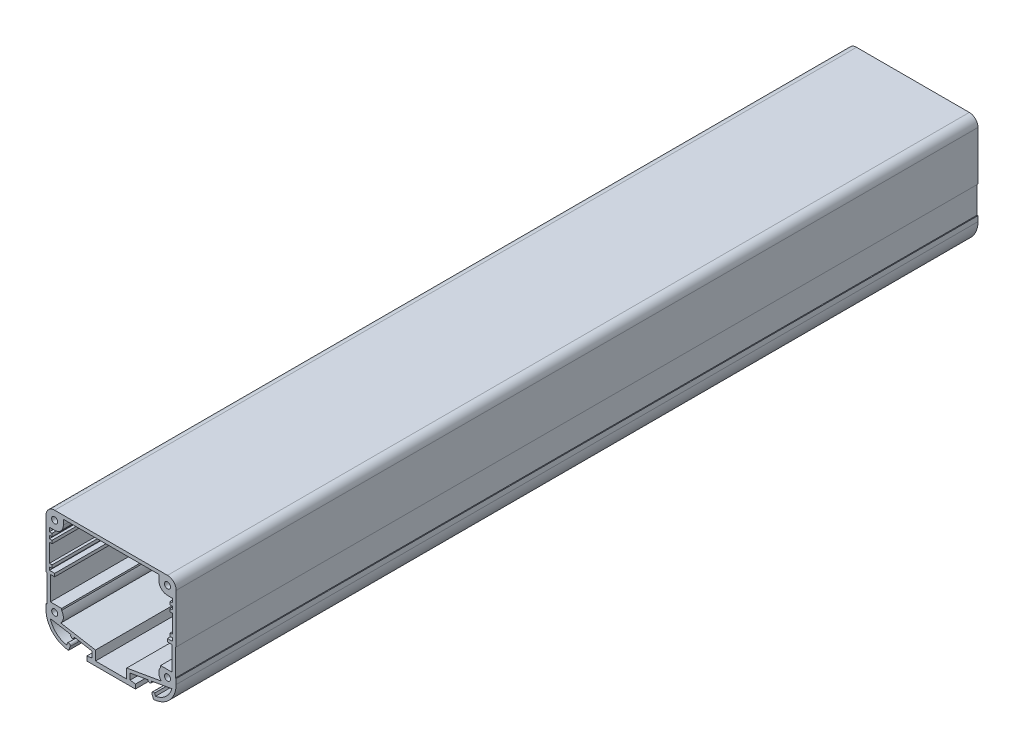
ISO-10303-21;
HEADER;
FILE_DESCRIPTION(('STEP AP214'),'2;1');
FILE_NAME('part.step','',(''),(''),'','','');
FILE_SCHEMA(('AUTOMOTIVE_DESIGN { 1 0 10303 214 1 1 1 1 }'));
ENDSEC;
DATA;
#1=APPLICATION_CONTEXT('core data for automotive mechanical design processes');
#2=APPLICATION_PROTOCOL_DEFINITION('international standard','automotive_design',2000,#1);
#3=PRODUCT_CONTEXT('',#1,'mechanical');
#4=PRODUCT('Part','Part','',(#3));
#5=PRODUCT_RELATED_PRODUCT_CATEGORY('part','',(#4));
#6=PRODUCT_DEFINITION_FORMATION('','',#4);
#7=PRODUCT_DEFINITION_CONTEXT('part definition',#1,'design');
#8=PRODUCT_DEFINITION('design','',#6,#7);
#9=PRODUCT_DEFINITION_SHAPE('','',#8);
#10=(LENGTH_UNIT() NAMED_UNIT(*) SI_UNIT(.MILLI.,.METRE.));
#11=(NAMED_UNIT(*) PLANE_ANGLE_UNIT() SI_UNIT($,.RADIAN.));
#12=(NAMED_UNIT(*) SI_UNIT($,.STERADIAN.) SOLID_ANGLE_UNIT());
#13=UNCERTAINTY_MEASURE_WITH_UNIT(LENGTH_MEASURE(1.E-05),#10,'distance_accuracy_value','');
#14=(GEOMETRIC_REPRESENTATION_CONTEXT(3) GLOBAL_UNCERTAINTY_ASSIGNED_CONTEXT((#13)) GLOBAL_UNIT_ASSIGNED_CONTEXT((#10,
#11,#12)) REPRESENTATION_CONTEXT('',''));
#15=CARTESIAN_POINT('',(0.,0.,0.));
#16=DIRECTION('',(0.,0.,1.));
#17=DIRECTION('',(1.,0.,0.));
#18=AXIS2_PLACEMENT_3D('',#15,#16,#17);
#19=CARTESIAN_POINT('',(3.50000000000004,-29.75,462.));
#20=DIRECTION('',(0.,-1.,0.));
#21=DIRECTION('',(0.,0.,-1.));
#22=AXIS2_PLACEMENT_3D('',#19,#20,#21);
#23=PLANE('',#22);
#24=DIRECTION('',(0.,0.,-1.));
#25=VECTOR('',#24,1.);
#26=CARTESIAN_POINT('',(3.50000000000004,-29.75,462.));
#27=LINE('',#26,#25);
#28=CARTESIAN_POINT('',(3.50000000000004,-29.75,10.));
#29=VERTEX_POINT('',#28);
#30=CARTESIAN_POINT('',(3.50000000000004,-29.75,0.));
#31=VERTEX_POINT('',#30);
#32=EDGE_CURVE('E1131',#29,#31,#27,.T.);
#33=ORIENTED_EDGE('',*,*,#32,.F.);
#34=DIRECTION('',(1.,0.,0.));
#35=VECTOR('',#34,1.);
#36=CARTESIAN_POINT('',(1.9999999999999,-29.75,10.));
#37=LINE('',#36,#35);
#38=CARTESIAN_POINT('',(1.9999999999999,-29.75,10.));
#39=VERTEX_POINT('',#38);
#40=EDGE_CURVE('E686',#39,#29,#37,.T.);
#41=ORIENTED_EDGE('',*,*,#40,.F.);
#42=DIRECTION('',(0.,0.,-1.));
#43=VECTOR('',#42,1.);
#44=CARTESIAN_POINT('',(1.9999999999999,-29.75,462.));
#45=LINE('',#44,#43);
#46=CARTESIAN_POINT('',(1.9999999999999,-29.75,0.));
#47=VERTEX_POINT('',#46);
#48=EDGE_CURVE('E1127',#39,#47,#45,.T.);
#49=ORIENTED_EDGE('',*,*,#48,.T.);
#50=DIRECTION('',(-1.,0.,0.));
#51=VECTOR('',#50,1.);
#52=CARTESIAN_POINT('',(3.50000000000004,-29.75,0.));
#53=LINE('',#52,#51);
#54=EDGE_CURVE('E793',#31,#47,#53,.T.);
#55=ORIENTED_EDGE('',*,*,#54,.F.);
#56=EDGE_LOOP('',(#33,#41,#49,#55));
#57=FACE_BOUND('',#56,.T.);
#58=ADVANCED_FACE('F28',(#57),#23,.T.);
#59=CARTESIAN_POINT('',(71.5,-29.75,462.));
#60=DIRECTION('',(0.,1.,0.));
#61=DIRECTION('',(0.,0.,1.));
#62=AXIS2_PLACEMENT_3D('',#59,#60,#61);
#63=PLANE('',#62);
#64=DIRECTION('',(1.,0.,0.));
#65=VECTOR('',#64,1.);
#66=CARTESIAN_POINT('',(51.2477270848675,-29.75,10.));
#67=LINE('',#66,#65);
#68=CARTESIAN_POINT('',(71.5,-29.75,10.));
#69=VERTEX_POINT('',#68);
#70=CARTESIAN_POINT('',(73.0000000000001,-29.75,10.));
#71=VERTEX_POINT('',#70);
#72=EDGE_CURVE('E678',#69,#71,#67,.T.);
#73=ORIENTED_EDGE('',*,*,#72,.F.);
#74=DIRECTION('',(0.,0.,-1.));
#75=VECTOR('',#74,1.);
#76=CARTESIAN_POINT('',(71.5,-29.75,462.));
#77=LINE('',#76,#75);
#78=CARTESIAN_POINT('',(71.5,-29.75,0.));
#79=VERTEX_POINT('',#78);
#80=EDGE_CURVE('E1079',#69,#79,#77,.T.);
#81=ORIENTED_EDGE('',*,*,#80,.T.);
#82=DIRECTION('',(1.,0.,0.));
#83=VECTOR('',#82,1.);
#84=CARTESIAN_POINT('',(71.5,-29.75,0.));
#85=LINE('',#84,#83);
#86=CARTESIAN_POINT('',(73.0000000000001,-29.75,0.));
#87=VERTEX_POINT('',#86);
#88=EDGE_CURVE('E859',#79,#87,#85,.T.);
#89=ORIENTED_EDGE('',*,*,#88,.T.);
#90=DIRECTION('',(0.,0.,-1.));
#91=VECTOR('',#90,1.);
#92=CARTESIAN_POINT('',(73.0000000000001,-29.75,462.));
#93=LINE('',#92,#91);
#94=EDGE_CURVE('E1083',#71,#87,#93,.T.);
#95=ORIENTED_EDGE('',*,*,#94,.F.);
#96=EDGE_LOOP('',(#73,#81,#89,#95));
#97=FACE_BOUND('',#96,.T.);
#98=ADVANCED_FACE('F1512',(#97),#63,.F.);
#99=CARTESIAN_POINT('',(5.,-5.,462.));
#100=DIRECTION('',(0.,0.,1.));
#101=DIRECTION('',(1.,0.,0.));
#102=AXIS2_PLACEMENT_3D('',#99,#100,#101);
#103=PLANE('',#102);
#104=CARTESIAN_POINT('',(70.,-51.,462.));
#105=DIRECTION('',(0.,0.,-1.));
#106=DIRECTION('',(-1.,0.,0.));
#107=AXIS2_PLACEMENT_3D('',#104,#105,#106);
#108=CIRCLE('',#107,1.75000000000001);
#109=CARTESIAN_POINT('',(68.25,-51.,462.));
#110=VERTEX_POINT('',#109);
#111=EDGE_CURVE('E721',#110,#110,#108,.T.);
#112=ORIENTED_EDGE('',*,*,#111,.T.);
#113=EDGE_LOOP('',(#112));
#114=FACE_BOUND('',#113,.T.);
#115=CARTESIAN_POINT('',(70.,-5.00000000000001,462.));
#116=DIRECTION('',(0.,0.,-1.));
#117=DIRECTION('',(-1.,0.,0.));
#118=AXIS2_PLACEMENT_3D('',#115,#116,#117);
#119=CIRCLE('',#118,1.75000000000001);
#120=CARTESIAN_POINT('',(68.25,-5.00000000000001,462.));
#121=VERTEX_POINT('',#120);
#122=EDGE_CURVE('E727',#121,#121,#119,.T.);
#123=ORIENTED_EDGE('',*,*,#122,.T.);
#124=EDGE_LOOP('',(#123));
#125=FACE_BOUND('',#124,.T.);
#126=CARTESIAN_POINT('',(5.,-5.,462.));
#127=DIRECTION('',(0.,0.,1.));
#128=DIRECTION('',(1.,0.,0.));
#129=AXIS2_PLACEMENT_3D('',#126,#127,#128);
#130=CIRCLE('',#129,1.75);
#131=CARTESIAN_POINT('',(6.75,-5.,462.));
#132=VERTEX_POINT('',#131);
#133=EDGE_CURVE('E739',#132,#132,#130,.T.);
#134=ORIENTED_EDGE('',*,*,#133,.F.);
#135=EDGE_LOOP('',(#134));
#136=FACE_BOUND('',#135,.T.);
#137=CARTESIAN_POINT('',(5.,-5.,462.));
#138=DIRECTION('',(0.,0.,1.));
#139=DIRECTION('',(1.,0.,0.));
#140=AXIS2_PLACEMENT_3D('',#137,#138,#139);
#141=CIRCLE('',#140,5.);
#142=CARTESIAN_POINT('',(5.,0.,462.));
#143=VERTEX_POINT('',#142);
#144=CARTESIAN_POINT('',(0.,-5.,462.));
#145=VERTEX_POINT('',#144);
#146=EDGE_CURVE('E1279',#143,#145,#141,.T.);
#147=ORIENTED_EDGE('',*,*,#146,.T.);
#148=DIRECTION('',(0.,1.,0.));
#149=VECTOR('',#148,1.);
#150=CARTESIAN_POINT('',(0.,-33.25,462.));
#151=LINE('',#150,#149);
#152=CARTESIAN_POINT('',(0.,-33.25,462.));
#153=VERTEX_POINT('',#152);
#154=EDGE_CURVE('E1282',#153,#145,#151,.T.);
#155=ORIENTED_EDGE('',*,*,#154,.F.);
#156=DIRECTION('',(-1.,0.,0.));
#157=VECTOR('',#156,1.);
#158=CARTESIAN_POINT('',(0.499999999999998,-33.25,462.));
#159=LINE('',#158,#157);
#160=CARTESIAN_POINT('',(0.499999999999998,-33.25,462.));
#161=VERTEX_POINT('',#160);
#162=EDGE_CURVE('E1285',#161,#153,#159,.T.);
#163=ORIENTED_EDGE('',*,*,#162,.F.);
#164=DIRECTION('',(0.,-1.,0.));
#165=VECTOR('',#164,1.);
#166=CARTESIAN_POINT('',(0.499999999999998,-33.25,462.));
#167=LINE('',#166,#165);
#168=CARTESIAN_POINT('',(0.499999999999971,-49.,462.));
#169=VERTEX_POINT('',#168);
#170=EDGE_CURVE('E1288',#161,#169,#167,.T.);
#171=ORIENTED_EDGE('',*,*,#170,.T.);
#172=DIRECTION('',(-1.,0.,0.));
#173=VECTOR('',#172,1.);
#174=CARTESIAN_POINT('',(0.499999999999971,-49.,462.));
#175=LINE('',#174,#173);
#176=CARTESIAN_POINT('',(0.,-49.,462.));
#177=VERTEX_POINT('',#176);
#178=EDGE_CURVE('E1290',#169,#177,#175,.T.);
#179=ORIENTED_EDGE('',*,*,#178,.T.);
#180=DIRECTION('',(0.,-1.,0.));
#181=VECTOR('',#180,1.);
#182=CARTESIAN_POINT('',(0.,-49.,462.));
#183=LINE('',#182,#181);
#184=CARTESIAN_POINT('',(0.,-52.,462.));
#185=VERTEX_POINT('',#184);
#186=EDGE_CURVE('E1293',#177,#185,#183,.T.);
#187=ORIENTED_EDGE('',*,*,#186,.T.);
#188=CARTESIAN_POINT('',(14.,-52.,462.));
#189=DIRECTION('',(0.,0.,-1.));
#190=DIRECTION('',(-1.,0.,0.));
#191=AXIS2_PLACEMENT_3D('',#188,#189,#190);
#192=CIRCLE('',#191,14.);
#193=CARTESIAN_POINT('',(13.0025413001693,-65.9644217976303,462.));
#194=VERTEX_POINT('',#193);
#195=EDGE_CURVE('E1296',#194,#185,#192,.T.);
#196=ORIENTED_EDGE('',*,*,#195,.F.);
#197=DIRECTION('',(0.375178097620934,0.926952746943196,0.));
#198=VECTOR('',#197,1.);
#199=CARTESIAN_POINT('',(13.0025413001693,-65.9644217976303,462.));
#200=LINE('',#199,#198);
#201=CARTESIAN_POINT('',(14.,-63.5,462.));
#202=VERTEX_POINT('',#201);
#203=EDGE_CURVE('E1299',#194,#202,#200,.T.);
#204=ORIENTED_EDGE('',*,*,#203,.T.);
#205=CARTESIAN_POINT('',(13.0339566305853,-63.241620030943,462.));
#206=DIRECTION('',(0.,0.,-1.));
#207=DIRECTION('',(-1.,0.,0.));
#208=AXIS2_PLACEMENT_3D('',#205,#206,#207);
#209=CIRCLE('',#208,1.);
#210=CARTESIAN_POINT('',(12.4278309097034,-62.4462511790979,462.));
#211=VERTEX_POINT('',#210);
#212=EDGE_CURVE('E1302',#211,#202,#209,.T.);
#213=ORIENTED_EDGE('',*,*,#212,.F.);
#214=DIRECTION('',(0.349032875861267,0.937110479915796,0.));
#215=VECTOR('',#214,1.);
#216=CARTESIAN_POINT('',(11.9169787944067,-63.8178264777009,462.));
#217=LINE('',#216,#215);
#218=CARTESIAN_POINT('',(11.9169787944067,-63.8178264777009,462.));
#219=VERTEX_POINT('',#218);
#220=EDGE_CURVE('E1305',#219,#211,#217,.T.);
#221=ORIENTED_EDGE('',*,*,#220,.F.);
#222=CARTESIAN_POINT('',(14.,-52.,462.));
#223=DIRECTION('',(0.,0.,1.));
#224=DIRECTION('',(1.,0.,0.));
#225=AXIS2_PLACEMENT_3D('',#222,#223,#224);
#226=CIRCLE('',#225,12.);
#227=CARTESIAN_POINT('',(2.46554961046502,-55.3100535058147,462.));
#228=VERTEX_POINT('',#227);
#229=EDGE_CURVE('E1308',#228,#219,#226,.T.);
#230=ORIENTED_EDGE('',*,*,#229,.F.);
#231=DIRECTION('',(0.985142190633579,-0.171740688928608,0.));
#232=VECTOR('',#231,1.);
#233=CARTESIAN_POINT('',(2.46554961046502,-55.3100535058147,462.));
#234=LINE('',#233,#232);
#235=CARTESIAN_POINT('',(14.3135294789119,-57.3755220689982,462.));
#236=VERTEX_POINT('',#235);
#237=EDGE_CURVE('E1311',#228,#236,#234,.T.);
#238=ORIENTED_EDGE('',*,*,#237,.T.);
#239=CARTESIAN_POINT('',(15.2752461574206,-57.7969494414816,462.));
#240=DIRECTION('',(0.,0.,1.));
#241=DIRECTION('',(1.,0.,0.));
#242=AXIS2_PLACEMENT_3D('',#239,#240,#241);
#243=CIRCLE('',#242,1.05);
#244=CARTESIAN_POINT('',(16.0012484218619,-58.5555143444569,462.));
#245=VERTEX_POINT('',#244);
#246=EDGE_CURVE('E1314',#236,#245,#243,.T.);
#247=ORIENTED_EDGE('',*,*,#246,.T.);
#248=DIRECTION('',(0.375178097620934,0.926952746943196,0.));
#249=VECTOR('',#248,1.);
#250=CARTESIAN_POINT('',(16.0012484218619,-58.5555143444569,462.));
#251=LINE('',#250,#249);
#252=CARTESIAN_POINT('',(16.3361294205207,-57.728123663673,462.));
#253=VERTEX_POINT('',#252);
#254=EDGE_CURVE('E1317',#245,#253,#251,.T.);
#255=ORIENTED_EDGE('',*,*,#254,.T.);
#256=DIRECTION('',(-0.98514219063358,0.171740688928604,0.));
#257=VECTOR('',#256,1.);
#258=CARTESIAN_POINT('',(26.5,-59.5,462.));
#259=LINE('',#258,#257);
#260=CARTESIAN_POINT('',(26.5,-59.5,462.));
#261=VERTEX_POINT('',#260);
#262=EDGE_CURVE('E1320',#261,#253,#259,.T.);
#263=ORIENTED_EDGE('',*,*,#262,.F.);
#264=DIRECTION('',(0.,-1.,0.));
#265=VECTOR('',#264,1.);
#266=CARTESIAN_POINT('',(26.5,-59.5,462.));
#267=LINE('',#266,#265);
#268=CARTESIAN_POINT('',(26.5,-63.,462.));
#269=VERTEX_POINT('',#268);
#270=EDGE_CURVE('E1323',#261,#269,#267,.T.);
#271=ORIENTED_EDGE('',*,*,#270,.T.);
#272=DIRECTION('',(0.986393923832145,0.164398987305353,0.));
#273=VECTOR('',#272,1.);
#274=CARTESIAN_POINT('',(23.5,-63.5,462.));
#275=LINE('',#274,#273);
#276=CARTESIAN_POINT('',(23.5,-63.5,462.));
#277=VERTEX_POINT('',#276);
#278=EDGE_CURVE('E1326',#277,#269,#275,.T.);
#279=ORIENTED_EDGE('',*,*,#278,.F.);
#280=DIRECTION('',(0.,-1.,0.));
#281=VECTOR('',#280,1.);
#282=CARTESIAN_POINT('',(23.5,-63.5,462.));
#283=LINE('',#282,#281);
#284=CARTESIAN_POINT('',(23.5,-66.,462.));
#285=VERTEX_POINT('',#284);
#286=EDGE_CURVE('E1329',#277,#285,#283,.T.);
#287=ORIENTED_EDGE('',*,*,#286,.T.);
#288=DIRECTION('',(-1.,0.,0.));
#289=VECTOR('',#288,1.);
#290=CARTESIAN_POINT('',(51.5,-66.,462.));
#291=LINE('',#290,#289);
#292=CARTESIAN_POINT('',(51.5,-66.,462.));
#293=VERTEX_POINT('',#292);
#294=EDGE_CURVE('E1332',#293,#285,#291,.T.);
#295=ORIENTED_EDGE('',*,*,#294,.F.);
#296=DIRECTION('',(0.,-1.,0.));
#297=VECTOR('',#296,1.);
#298=CARTESIAN_POINT('',(51.5,-63.5,462.));
#299=LINE('',#298,#297);
#300=CARTESIAN_POINT('',(51.5,-63.5,462.));
#301=VERTEX_POINT('',#300);
#302=EDGE_CURVE('E1335',#301,#293,#299,.T.);
#303=ORIENTED_EDGE('',*,*,#302,.F.);
#304=DIRECTION('',(-0.986393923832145,0.164398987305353,0.));
#305=VECTOR('',#304,1.);
#306=CARTESIAN_POINT('',(51.5,-63.5,462.));
#307=LINE('',#306,#305);
#308=CARTESIAN_POINT('',(48.5,-63.,462.));
#309=VERTEX_POINT('',#308);
#310=EDGE_CURVE('E1338',#301,#309,#307,.T.);
#311=ORIENTED_EDGE('',*,*,#310,.T.);
#312=DIRECTION('',(0.,-1.,0.));
#313=VECTOR('',#312,1.);
#314=CARTESIAN_POINT('',(48.5,-59.5,462.));
#315=LINE('',#314,#313);
#316=CARTESIAN_POINT('',(48.5,-59.5,462.));
#317=VERTEX_POINT('',#316);
#318=EDGE_CURVE('E1341',#317,#309,#315,.T.);
#319=ORIENTED_EDGE('',*,*,#318,.F.);
#320=DIRECTION('',(0.98514219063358,0.171740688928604,0.));
#321=VECTOR('',#320,1.);
#322=CARTESIAN_POINT('',(48.5,-59.5,462.));
#323=LINE('',#322,#321);
#324=CARTESIAN_POINT('',(58.6638705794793,-57.728123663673,462.));
#325=VERTEX_POINT('',#324);
#326=EDGE_CURVE('E1344',#317,#325,#323,.T.);
#327=ORIENTED_EDGE('',*,*,#326,.T.);
#328=DIRECTION('',(-0.375178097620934,0.926952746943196,0.));
#329=VECTOR('',#328,1.);
#330=CARTESIAN_POINT('',(58.9987515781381,-58.5555143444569,462.));
#331=LINE('',#330,#329);
#332=CARTESIAN_POINT('',(58.9987515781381,-58.5555143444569,462.));
#333=VERTEX_POINT('',#332);
#334=EDGE_CURVE('E1347',#333,#325,#331,.T.);
#335=ORIENTED_EDGE('',*,*,#334,.F.);
#336=CARTESIAN_POINT('',(59.7247538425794,-57.7969494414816,462.));
#337=DIRECTION('',(0.,0.,-1.));
#338=DIRECTION('',(-1.,0.,0.));
#339=AXIS2_PLACEMENT_3D('',#336,#337,#338);
#340=CIRCLE('',#339,1.05);
#341=CARTESIAN_POINT('',(60.6864705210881,-57.3755220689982,462.));
#342=VERTEX_POINT('',#341);
#343=EDGE_CURVE('E1350',#342,#333,#340,.T.);
#344=ORIENTED_EDGE('',*,*,#343,.F.);
#345=DIRECTION('',(0.985142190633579,0.171740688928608,0.));
#346=VECTOR('',#345,1.);
#347=CARTESIAN_POINT('',(60.6864705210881,-57.3755220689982,462.));
#348=LINE('',#347,#346);
#349=CARTESIAN_POINT('',(72.534450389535,-55.3100535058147,462.));
#350=VERTEX_POINT('',#349);
#351=EDGE_CURVE('E1353',#342,#350,#348,.T.);
#352=ORIENTED_EDGE('',*,*,#351,.T.);
#353=CARTESIAN_POINT('',(61.,-52.,462.));
#354=DIRECTION('',(0.,0.,-1.));
#355=DIRECTION('',(-1.,0.,0.));
#356=AXIS2_PLACEMENT_3D('',#353,#354,#355);
#357=CIRCLE('',#356,12.);
#358=CARTESIAN_POINT('',(63.0830212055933,-63.8178264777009,462.));
#359=VERTEX_POINT('',#358);
#360=EDGE_CURVE('E1356',#350,#359,#357,.T.);
#361=ORIENTED_EDGE('',*,*,#360,.T.);
#362=DIRECTION('',(-0.349032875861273,0.937110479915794,0.));
#363=VECTOR('',#362,1.);
#364=CARTESIAN_POINT('',(63.0830212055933,-63.8178264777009,462.));
#365=LINE('',#364,#363);
#366=CARTESIAN_POINT('',(62.5721690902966,-62.4462511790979,462.));
#367=VERTEX_POINT('',#366);
#368=EDGE_CURVE('E1359',#359,#367,#365,.T.);
#369=ORIENTED_EDGE('',*,*,#368,.T.);
#370=CARTESIAN_POINT('',(61.9660433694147,-63.241620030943,462.));
#371=DIRECTION('',(0.,0.,1.));
#372=DIRECTION('',(1.,0.,0.));
#373=AXIS2_PLACEMENT_3D('',#370,#371,#372);
#374=CIRCLE('',#373,0.999999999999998);
#375=CARTESIAN_POINT('',(61.,-63.5,462.));
#376=VERTEX_POINT('',#375);
#377=EDGE_CURVE('E1362',#367,#376,#374,.T.);
#378=ORIENTED_EDGE('',*,*,#377,.T.);
#379=DIRECTION('',(-0.375178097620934,0.926952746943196,0.));
#380=VECTOR('',#379,1.);
#381=CARTESIAN_POINT('',(61.9974586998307,-65.9644217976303,462.));
#382=LINE('',#381,#380);
#383=CARTESIAN_POINT('',(61.9974586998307,-65.9644217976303,462.));
#384=VERTEX_POINT('',#383);
#385=EDGE_CURVE('E1365',#384,#376,#382,.T.);
#386=ORIENTED_EDGE('',*,*,#385,.F.);
#387=CARTESIAN_POINT('',(61.,-52.,462.));
#388=DIRECTION('',(0.,0.,1.));
#389=DIRECTION('',(1.,0.,0.));
#390=AXIS2_PLACEMENT_3D('',#387,#388,#389);
#391=CIRCLE('',#390,14.);
#392=CARTESIAN_POINT('',(75.,-52.,462.));
#393=VERTEX_POINT('',#392);
#394=EDGE_CURVE('E1368',#384,#393,#391,.T.);
#395=ORIENTED_EDGE('',*,*,#394,.T.);
#396=DIRECTION('',(0.,-1.,0.));
#397=VECTOR('',#396,1.);
#398=CARTESIAN_POINT('',(75.,-49.,462.));
#399=LINE('',#398,#397);
#400=CARTESIAN_POINT('',(75.,-49.,462.));
#401=VERTEX_POINT('',#400);
#402=EDGE_CURVE('E1371',#401,#393,#399,.T.);
#403=ORIENTED_EDGE('',*,*,#402,.F.);
#404=DIRECTION('',(1.,0.,0.));
#405=VECTOR('',#404,1.);
#406=CARTESIAN_POINT('',(74.5,-49.,462.));
#407=LINE('',#406,#405);
#408=CARTESIAN_POINT('',(74.5,-49.,462.));
#409=VERTEX_POINT('',#408);
#410=EDGE_CURVE('E1374',#409,#401,#407,.T.);
#411=ORIENTED_EDGE('',*,*,#410,.F.);
#412=DIRECTION('',(1.34910281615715E-13,-1.,0.));
#413=VECTOR('',#412,1.);
#414=CARTESIAN_POINT('',(74.5,-48.8971332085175,462.));
#415=LINE('',#414,#413);
#416=CARTESIAN_POINT('',(74.5,-33.25,462.));
#417=VERTEX_POINT('',#416);
#418=EDGE_CURVE('E1377',#417,#409,#415,.T.);
#419=ORIENTED_EDGE('',*,*,#418,.F.);
#420=DIRECTION('',(1.,0.,0.));
#421=VECTOR('',#420,1.);
#422=CARTESIAN_POINT('',(74.5,-33.25,462.));
#423=LINE('',#422,#421);
#424=CARTESIAN_POINT('',(75.,-33.25,462.));
#425=VERTEX_POINT('',#424);
#426=EDGE_CURVE('E1380',#417,#425,#423,.T.);
#427=ORIENTED_EDGE('',*,*,#426,.T.);
#428=DIRECTION('',(0.,1.,0.));
#429=VECTOR('',#428,1.);
#430=CARTESIAN_POINT('',(75.,-33.25,462.));
#431=LINE('',#430,#429);
#432=CARTESIAN_POINT('',(75.,-5.00000000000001,462.));
#433=VERTEX_POINT('',#432);
#434=EDGE_CURVE('E1383',#425,#433,#431,.T.);
#435=ORIENTED_EDGE('',*,*,#434,.T.);
#436=CARTESIAN_POINT('',(70.,-5.00000000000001,462.));
#437=DIRECTION('',(0.,0.,-1.));
#438=DIRECTION('',(-1.,0.,0.));
#439=AXIS2_PLACEMENT_3D('',#436,#437,#438);
#440=CIRCLE('',#439,5.);
#441=CARTESIAN_POINT('',(70.,0.,462.));
#442=VERTEX_POINT('',#441);
#443=EDGE_CURVE('E1386',#442,#433,#440,.T.);
#444=ORIENTED_EDGE('',*,*,#443,.F.);
#445=DIRECTION('',(1.,0.,0.));
#446=VECTOR('',#445,1.);
#447=CARTESIAN_POINT('',(5.,0.,462.));
#448=LINE('',#447,#446);
#449=EDGE_CURVE('E1389',#143,#442,#448,.T.);
#450=ORIENTED_EDGE('',*,*,#449,.F.);
#451=EDGE_LOOP('',(#147,#155,#163,#171,#179,#187,#196,#204,#213,#221,#230,#238,#247,#255,#263,
#271,#279,#287,#295,#303,#311,#319,#327,#335,#344,#352,#361,#369,#378,#386,#395,#403,#411,#419,
#427,#435,#444,#450));
#452=FACE_BOUND('',#451,.T.);
#453=DIRECTION('',(0.,-1.,0.));
#454=VECTOR('',#453,1.);
#455=CARTESIAN_POINT('',(65.,-2.,462.));
#456=LINE('',#455,#454);
#457=CARTESIAN_POINT('',(65.,-2.,462.));
#458=VERTEX_POINT('',#457);
#459=CARTESIAN_POINT('',(65.,-5.00000000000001,462.));
#460=VERTEX_POINT('',#459);
#461=EDGE_CURVE('E901',#458,#460,#456,.T.);
#462=ORIENTED_EDGE('',*,*,#461,.T.);
#463=CARTESIAN_POINT('',(70.,-5.00000000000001,462.));
#464=DIRECTION('',(0.,0.,-1.));
#465=DIRECTION('',(-1.,0.,0.));
#466=AXIS2_PLACEMENT_3D('',#463,#464,#465);
#467=CIRCLE('',#466,5.);
#468=CARTESIAN_POINT('',(70.,-10.,462.));
#469=VERTEX_POINT('',#468);
#470=EDGE_CURVE('E898',#469,#460,#467,.T.);
#471=ORIENTED_EDGE('',*,*,#470,.F.);
#472=DIRECTION('',(1.,0.,0.));
#473=VECTOR('',#472,1.);
#474=CARTESIAN_POINT('',(70.,-10.,462.));
#475=LINE('',#474,#473);
#476=CARTESIAN_POINT('',(73.,-10.,462.));
#477=VERTEX_POINT('',#476);
#478=EDGE_CURVE('E1051',#469,#477,#475,.T.);
#479=ORIENTED_EDGE('',*,*,#478,.T.);
#480=DIRECTION('',(0.,-1.,0.));
#481=VECTOR('',#480,1.);
#482=CARTESIAN_POINT('',(73.,-10.,462.));
#483=LINE('',#482,#481);
#484=CARTESIAN_POINT('',(73.,-12.25,462.));
#485=VERTEX_POINT('',#484);
#486=EDGE_CURVE('E1048',#477,#485,#483,.T.);
#487=ORIENTED_EDGE('',*,*,#486,.T.);
#488=DIRECTION('',(-1.,0.,0.));
#489=VECTOR('',#488,1.);
#490=CARTESIAN_POINT('',(73.,-12.25,462.));
#491=LINE('',#490,#489);
#492=CARTESIAN_POINT('',(71.5,-12.25,462.));
#493=VERTEX_POINT('',#492);
#494=EDGE_CURVE('E1045',#485,#493,#491,.T.);
#495=ORIENTED_EDGE('',*,*,#494,.T.);
#496=DIRECTION('',(0.,-1.,0.));
#497=VECTOR('',#496,1.);
#498=CARTESIAN_POINT('',(71.5,-12.25,462.));
#499=LINE('',#498,#497);
#500=CARTESIAN_POINT('',(71.5,-14.,462.));
#501=VERTEX_POINT('',#500);
#502=EDGE_CURVE('E1042',#493,#501,#499,.T.);
#503=ORIENTED_EDGE('',*,*,#502,.T.);
#504=DIRECTION('',(1.,0.,0.));
#505=VECTOR('',#504,1.);
#506=CARTESIAN_POINT('',(71.5,-14.,462.));
#507=LINE('',#506,#505);
#508=CARTESIAN_POINT('',(73.0000000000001,-14.,462.));
#509=VERTEX_POINT('',#508);
#510=EDGE_CURVE('E1039',#501,#509,#507,.T.);
#511=ORIENTED_EDGE('',*,*,#510,.T.);
#512=DIRECTION('',(0.,-1.,0.));
#513=VECTOR('',#512,1.);
#514=CARTESIAN_POINT('',(73.0000000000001,-14.,462.));
#515=LINE('',#514,#513);
#516=CARTESIAN_POINT('',(73.0000000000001,-15.75,462.));
#517=VERTEX_POINT('',#516);
#518=EDGE_CURVE('E1036',#509,#517,#515,.T.);
#519=ORIENTED_EDGE('',*,*,#518,.T.);
#520=DIRECTION('',(-1.,0.,0.));
#521=VECTOR('',#520,1.);
#522=CARTESIAN_POINT('',(73.0000000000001,-15.75,462.));
#523=LINE('',#522,#521);
#524=CARTESIAN_POINT('',(71.5,-15.75,462.));
#525=VERTEX_POINT('',#524);
#526=EDGE_CURVE('E1033',#517,#525,#523,.T.);
#527=ORIENTED_EDGE('',*,*,#526,.T.);
#528=DIRECTION('',(0.,-1.,0.));
#529=VECTOR('',#528,1.);
#530=CARTESIAN_POINT('',(71.5,-15.75,462.));
#531=LINE('',#530,#529);
#532=CARTESIAN_POINT('',(71.5,-17.5,462.));
#533=VERTEX_POINT('',#532);
#534=EDGE_CURVE('E1030',#525,#533,#531,.T.);
#535=ORIENTED_EDGE('',*,*,#534,.T.);
#536=DIRECTION('',(1.,0.,0.));
#537=VECTOR('',#536,1.);
#538=CARTESIAN_POINT('',(71.5,-17.5,462.));
#539=LINE('',#538,#537);
#540=CARTESIAN_POINT('',(73.0000000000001,-17.5,462.));
#541=VERTEX_POINT('',#540);
#542=EDGE_CURVE('E1027',#533,#541,#539,.T.);
#543=ORIENTED_EDGE('',*,*,#542,.T.);
#544=DIRECTION('',(0.,-1.,0.));
#545=VECTOR('',#544,1.);
#546=CARTESIAN_POINT('',(73.0000000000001,-17.5,462.));
#547=LINE('',#546,#545);
#548=CARTESIAN_POINT('',(73.0000000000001,-28.,462.));
#549=VERTEX_POINT('',#548);
#550=EDGE_CURVE('E1024',#541,#549,#547,.T.);
#551=ORIENTED_EDGE('',*,*,#550,.T.);
#552=DIRECTION('',(-1.,0.,0.));
#553=VECTOR('',#552,1.);
#554=CARTESIAN_POINT('',(73.0000000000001,-28.,462.));
#555=LINE('',#554,#553);
#556=CARTESIAN_POINT('',(71.5,-28.,462.));
#557=VERTEX_POINT('',#556);
#558=EDGE_CURVE('E1021',#549,#557,#555,.T.);
#559=ORIENTED_EDGE('',*,*,#558,.T.);
#560=DIRECTION('',(0.,-1.,0.));
#561=VECTOR('',#560,1.);
#562=CARTESIAN_POINT('',(71.5,-28.,462.));
#563=LINE('',#562,#561);
#564=CARTESIAN_POINT('',(71.5,-29.75,462.));
#565=VERTEX_POINT('',#564);
#566=EDGE_CURVE('E1018',#557,#565,#563,.T.);
#567=ORIENTED_EDGE('',*,*,#566,.T.);
#568=DIRECTION('',(1.,0.,0.));
#569=VECTOR('',#568,1.);
#570=CARTESIAN_POINT('',(71.5,-29.75,462.));
#571=LINE('',#570,#569);
#572=CARTESIAN_POINT('',(73.0000000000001,-29.75,462.));
#573=VERTEX_POINT('',#572);
#574=EDGE_CURVE('E1015',#565,#573,#571,.T.);
#575=ORIENTED_EDGE('',*,*,#574,.T.);
#576=DIRECTION('',(0.,-1.,0.));
#577=VECTOR('',#576,1.);
#578=CARTESIAN_POINT('',(73.0000000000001,-29.75,462.));
#579=LINE('',#578,#577);
#580=CARTESIAN_POINT('',(73.0000000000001,-31.5,462.));
#581=VERTEX_POINT('',#580);
#582=EDGE_CURVE('E1012',#573,#581,#579,.T.);
#583=ORIENTED_EDGE('',*,*,#582,.T.);
#584=DIRECTION('',(-1.,0.,0.));
#585=VECTOR('',#584,1.);
#586=CARTESIAN_POINT('',(73.0000000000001,-31.5,462.));
#587=LINE('',#586,#585);
#588=CARTESIAN_POINT('',(70.,-31.5,462.));
#589=VERTEX_POINT('',#588);
#590=EDGE_CURVE('E1009',#581,#589,#587,.T.);
#591=ORIENTED_EDGE('',*,*,#590,.T.);
#592=DIRECTION('',(0.,-1.,0.));
#593=VECTOR('',#592,1.);
#594=CARTESIAN_POINT('',(70.,-31.5,462.));
#595=LINE('',#594,#593);
#596=CARTESIAN_POINT('',(70.,-33.25,462.));
#597=VERTEX_POINT('',#596);
#598=EDGE_CURVE('E1006',#589,#597,#595,.T.);
#599=ORIENTED_EDGE('',*,*,#598,.T.);
#600=DIRECTION('',(1.,0.,0.));
#601=VECTOR('',#600,1.);
#602=CARTESIAN_POINT('',(70.,-33.25,462.));
#603=LINE('',#602,#601);
#604=CARTESIAN_POINT('',(72.5,-33.25,462.));
#605=VERTEX_POINT('',#604);
#606=EDGE_CURVE('E1003',#597,#605,#603,.T.);
#607=ORIENTED_EDGE('',*,*,#606,.T.);
#608=DIRECTION('',(0.,-1.,0.));
#609=VECTOR('',#608,1.);
#610=CARTESIAN_POINT('',(72.5,-33.25,462.));
#611=LINE('',#610,#609);
#612=CARTESIAN_POINT('',(72.5,-47.,462.));
#613=VERTEX_POINT('',#612);
#614=EDGE_CURVE('E1000',#605,#613,#611,.T.);
#615=ORIENTED_EDGE('',*,*,#614,.T.);
#616=DIRECTION('',(-1.,0.,0.));
#617=VECTOR('',#616,1.);
#618=CARTESIAN_POINT('',(72.5,-47.,462.));
#619=LINE('',#618,#617);
#620=CARTESIAN_POINT('',(66.,-47.,462.));
#621=VERTEX_POINT('',#620);
#622=EDGE_CURVE('E997',#613,#621,#619,.T.);
#623=ORIENTED_EDGE('',*,*,#622,.T.);
#624=DIRECTION('',(0.,-1.,0.));
#625=VECTOR('',#624,1.);
#626=CARTESIAN_POINT('',(66.,-47.,462.));
#627=LINE('',#626,#625);
#628=CARTESIAN_POINT('',(66.,-48.,462.));
#629=VERTEX_POINT('',#628);
#630=EDGE_CURVE('E994',#621,#629,#627,.T.);
#631=ORIENTED_EDGE('',*,*,#630,.T.);
#632=CARTESIAN_POINT('',(70.,-51.,462.));
#633=DIRECTION('',(0.,0.,-1.));
#634=DIRECTION('',(-1.,0.,0.));
#635=AXIS2_PLACEMENT_3D('',#632,#633,#634);
#636=CIRCLE('',#635,5.00000000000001);
#637=CARTESIAN_POINT('',(66.4509226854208,-54.5219384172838,462.));
#638=VERTEX_POINT('',#637);
#639=EDGE_CURVE('E991',#638,#629,#636,.T.);
#640=ORIENTED_EDGE('',*,*,#639,.F.);
#641=DIRECTION('',(0.985142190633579,0.171740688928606,0.));
#642=VECTOR('',#641,1.);
#643=CARTESIAN_POINT('',(46.5,-58.,462.));
#644=LINE('',#643,#642);
#645=CARTESIAN_POINT('',(46.5,-58.,462.));
#646=VERTEX_POINT('',#645);
#647=EDGE_CURVE('E988',#646,#638,#644,.T.);
#648=ORIENTED_EDGE('',*,*,#647,.F.);
#649=DIRECTION('',(0.,1.,0.));
#650=VECTOR('',#649,1.);
#651=CARTESIAN_POINT('',(46.5,-63.5,462.));
#652=LINE('',#651,#650);
#653=CARTESIAN_POINT('',(46.5,-63.5,462.));
#654=VERTEX_POINT('',#653);
#655=EDGE_CURVE('E985',#654,#646,#652,.T.);
#656=ORIENTED_EDGE('',*,*,#655,.F.);
#657=DIRECTION('',(-1.,0.,0.));
#658=VECTOR('',#657,1.);
#659=CARTESIAN_POINT('',(46.5,-63.5,462.));
#660=LINE('',#659,#658);
#661=CARTESIAN_POINT('',(28.5,-63.5,462.));
#662=VERTEX_POINT('',#661);
#663=EDGE_CURVE('E982',#654,#662,#660,.T.);
#664=ORIENTED_EDGE('',*,*,#663,.T.);
#665=DIRECTION('',(0.,1.,0.));
#666=VECTOR('',#665,1.);
#667=CARTESIAN_POINT('',(28.5,-63.5,462.));
#668=LINE('',#667,#666);
#669=CARTESIAN_POINT('',(28.5,-58.,462.));
#670=VERTEX_POINT('',#669);
#671=EDGE_CURVE('E979',#662,#670,#668,.T.);
#672=ORIENTED_EDGE('',*,*,#671,.T.);
#673=DIRECTION('',(-0.985142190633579,0.171740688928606,0.));
#674=VECTOR('',#673,1.);
#675=CARTESIAN_POINT('',(28.5,-58.,462.));
#676=LINE('',#675,#674);
#677=CARTESIAN_POINT('',(8.54907731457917,-54.5219384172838,462.));
#678=VERTEX_POINT('',#677);
#679=EDGE_CURVE('E976',#670,#678,#676,.T.);
#680=ORIENTED_EDGE('',*,*,#679,.T.);
#681=CARTESIAN_POINT('',(5.,-51.,462.));
#682=DIRECTION('',(0.,0.,1.));
#683=DIRECTION('',(1.,0.,0.));
#684=AXIS2_PLACEMENT_3D('',#681,#682,#683);
#685=CIRCLE('',#684,5.);
#686=CARTESIAN_POINT('',(9.,-48.,462.));
#687=VERTEX_POINT('',#686);
#688=EDGE_CURVE('E973',#678,#687,#685,.T.);
#689=ORIENTED_EDGE('',*,*,#688,.T.);
#690=DIRECTION('',(0.,-1.,0.));
#691=VECTOR('',#690,1.);
#692=CARTESIAN_POINT('',(9.,-47.,462.));
#693=LINE('',#692,#691);
#694=CARTESIAN_POINT('',(9.,-47.,462.));
#695=VERTEX_POINT('',#694);
#696=EDGE_CURVE('E970',#695,#687,#693,.T.);
#697=ORIENTED_EDGE('',*,*,#696,.F.);
#698=DIRECTION('',(1.,0.,0.));
#699=VECTOR('',#698,1.);
#700=CARTESIAN_POINT('',(2.5,-47.,462.));
#701=LINE('',#700,#699);
#702=CARTESIAN_POINT('',(2.5,-47.,462.));
#703=VERTEX_POINT('',#702);
#704=EDGE_CURVE('E967',#703,#695,#701,.T.);
#705=ORIENTED_EDGE('',*,*,#704,.F.);
#706=DIRECTION('',(0.,-1.,0.));
#707=VECTOR('',#706,1.);
#708=CARTESIAN_POINT('',(2.5,-33.25,462.));
#709=LINE('',#708,#707);
#710=CARTESIAN_POINT('',(2.5,-33.25,462.));
#711=VERTEX_POINT('',#710);
#712=EDGE_CURVE('E964',#711,#703,#709,.T.);
#713=ORIENTED_EDGE('',*,*,#712,.F.);
#714=DIRECTION('',(-1.,0.,0.));
#715=VECTOR('',#714,1.);
#716=CARTESIAN_POINT('',(5.,-33.25,462.));
#717=LINE('',#716,#715);
#718=CARTESIAN_POINT('',(5.,-33.25,462.));
#719=VERTEX_POINT('',#718);
#720=EDGE_CURVE('E961',#719,#711,#717,.T.);
#721=ORIENTED_EDGE('',*,*,#720,.F.);
#722=DIRECTION('',(0.,-1.,0.));
#723=VECTOR('',#722,1.);
#724=CARTESIAN_POINT('',(5.,-31.5,462.));
#725=LINE('',#724,#723);
#726=CARTESIAN_POINT('',(5.,-31.5,462.));
#727=VERTEX_POINT('',#726);
#728=EDGE_CURVE('E958',#727,#719,#725,.T.);
#729=ORIENTED_EDGE('',*,*,#728,.F.);
#730=DIRECTION('',(1.,0.,0.));
#731=VECTOR('',#730,1.);
#732=CARTESIAN_POINT('',(1.9999999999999,-31.5,462.));
#733=LINE('',#732,#731);
#734=CARTESIAN_POINT('',(1.9999999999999,-31.5,462.));
#735=VERTEX_POINT('',#734);
#736=EDGE_CURVE('E955',#735,#727,#733,.T.);
#737=ORIENTED_EDGE('',*,*,#736,.F.);
#738=DIRECTION('',(0.,-1.,0.));
#739=VECTOR('',#738,1.);
#740=CARTESIAN_POINT('',(1.9999999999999,-29.75,462.));
#741=LINE('',#740,#739);
#742=CARTESIAN_POINT('',(1.9999999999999,-29.75,462.));
#743=VERTEX_POINT('',#742);
#744=EDGE_CURVE('E952',#743,#735,#741,.T.);
#745=ORIENTED_EDGE('',*,*,#744,.F.);
#746=DIRECTION('',(-1.,0.,0.));
#747=VECTOR('',#746,1.);
#748=CARTESIAN_POINT('',(3.50000000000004,-29.75,462.));
#749=LINE('',#748,#747);
#750=CARTESIAN_POINT('',(3.50000000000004,-29.75,462.));
#751=VERTEX_POINT('',#750);
#752=EDGE_CURVE('E949',#751,#743,#749,.T.);
#753=ORIENTED_EDGE('',*,*,#752,.F.);
#754=DIRECTION('',(0.,-1.,0.));
#755=VECTOR('',#754,1.);
#756=CARTESIAN_POINT('',(3.50000000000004,-28.,462.));
#757=LINE('',#756,#755);
#758=CARTESIAN_POINT('',(3.50000000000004,-28.,462.));
#759=VERTEX_POINT('',#758);
#760=EDGE_CURVE('E946',#759,#751,#757,.T.);
#761=ORIENTED_EDGE('',*,*,#760,.F.);
#762=DIRECTION('',(1.,0.,0.));
#763=VECTOR('',#762,1.);
#764=CARTESIAN_POINT('',(1.99999999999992,-28.,462.));
#765=LINE('',#764,#763);
#766=CARTESIAN_POINT('',(1.99999999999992,-28.,462.));
#767=VERTEX_POINT('',#766);
#768=EDGE_CURVE('E943',#767,#759,#765,.T.);
#769=ORIENTED_EDGE('',*,*,#768,.F.);
#770=DIRECTION('',(0.,-1.,0.));
#771=VECTOR('',#770,1.);
#772=CARTESIAN_POINT('',(1.99999999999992,-17.5,462.));
#773=LINE('',#772,#771);
#774=CARTESIAN_POINT('',(1.99999999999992,-17.5,462.));
#775=VERTEX_POINT('',#774);
#776=EDGE_CURVE('E940',#775,#767,#773,.T.);
#777=ORIENTED_EDGE('',*,*,#776,.F.);
#778=DIRECTION('',(-1.,0.,0.));
#779=VECTOR('',#778,1.);
#780=CARTESIAN_POINT('',(3.50000000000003,-17.5,462.));
#781=LINE('',#780,#779);
#782=CARTESIAN_POINT('',(3.50000000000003,-17.5,462.));
#783=VERTEX_POINT('',#782);
#784=EDGE_CURVE('E937',#783,#775,#781,.T.);
#785=ORIENTED_EDGE('',*,*,#784,.F.);
#786=DIRECTION('',(0.,-1.,0.));
#787=VECTOR('',#786,1.);
#788=CARTESIAN_POINT('',(3.50000000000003,-15.75,462.));
#789=LINE('',#788,#787);
#790=CARTESIAN_POINT('',(3.50000000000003,-15.75,462.));
#791=VERTEX_POINT('',#790);
#792=EDGE_CURVE('E934',#791,#783,#789,.T.);
#793=ORIENTED_EDGE('',*,*,#792,.F.);
#794=DIRECTION('',(1.,0.,0.));
#795=VECTOR('',#794,1.);
#796=CARTESIAN_POINT('',(1.99999999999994,-15.75,462.));
#797=LINE('',#796,#795);
#798=CARTESIAN_POINT('',(1.99999999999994,-15.75,462.));
#799=VERTEX_POINT('',#798);
#800=EDGE_CURVE('E931',#799,#791,#797,.T.);
#801=ORIENTED_EDGE('',*,*,#800,.F.);
#802=DIRECTION('',(0.,-1.,0.));
#803=VECTOR('',#802,1.);
#804=CARTESIAN_POINT('',(1.99999999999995,-14.,462.));
#805=LINE('',#804,#803);
#806=CARTESIAN_POINT('',(1.99999999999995,-14.,462.));
#807=VERTEX_POINT('',#806);
#808=EDGE_CURVE('E928',#807,#799,#805,.T.);
#809=ORIENTED_EDGE('',*,*,#808,.F.);
#810=DIRECTION('',(-1.,0.,0.));
#811=VECTOR('',#810,1.);
#812=CARTESIAN_POINT('',(3.5,-14.,462.));
#813=LINE('',#812,#811);
#814=CARTESIAN_POINT('',(3.5,-14.,462.));
#815=VERTEX_POINT('',#814);
#816=EDGE_CURVE('E925',#815,#807,#813,.T.);
#817=ORIENTED_EDGE('',*,*,#816,.F.);
#818=DIRECTION('',(0.,-1.,0.));
#819=VECTOR('',#818,1.);
#820=CARTESIAN_POINT('',(3.5,-12.25,462.));
#821=LINE('',#820,#819);
#822=CARTESIAN_POINT('',(3.5,-12.25,462.));
#823=VERTEX_POINT('',#822);
#824=EDGE_CURVE('E922',#823,#815,#821,.T.);
#825=ORIENTED_EDGE('',*,*,#824,.F.);
#826=DIRECTION('',(1.,0.,0.));
#827=VECTOR('',#826,1.);
#828=CARTESIAN_POINT('',(2.,-12.25,462.));
#829=LINE('',#828,#827);
#830=CARTESIAN_POINT('',(2.,-12.25,462.));
#831=VERTEX_POINT('',#830);
#832=EDGE_CURVE('E919',#831,#823,#829,.T.);
#833=ORIENTED_EDGE('',*,*,#832,.F.);
#834=DIRECTION('',(0.,-1.,0.));
#835=VECTOR('',#834,1.);
#836=CARTESIAN_POINT('',(2.,-10.,462.));
#837=LINE('',#836,#835);
#838=CARTESIAN_POINT('',(2.,-10.,462.));
#839=VERTEX_POINT('',#838);
#840=EDGE_CURVE('E916',#839,#831,#837,.T.);
#841=ORIENTED_EDGE('',*,*,#840,.F.);
#842=DIRECTION('',(-1.,0.,0.));
#843=VECTOR('',#842,1.);
#844=CARTESIAN_POINT('',(5.,-10.,462.));
#845=LINE('',#844,#843);
#846=CARTESIAN_POINT('',(5.,-10.,462.));
#847=VERTEX_POINT('',#846);
#848=EDGE_CURVE('E913',#847,#839,#845,.T.);
#849=ORIENTED_EDGE('',*,*,#848,.F.);
#850=CARTESIAN_POINT('',(5.,-5.,462.));
#851=DIRECTION('',(0.,0.,1.));
#852=DIRECTION('',(1.,0.,0.));
#853=AXIS2_PLACEMENT_3D('',#850,#851,#852);
#854=CIRCLE('',#853,5.);
#855=CARTESIAN_POINT('',(10.,-5.,462.));
#856=VERTEX_POINT('',#855);
#857=EDGE_CURVE('E910',#847,#856,#854,.T.);
#858=ORIENTED_EDGE('',*,*,#857,.T.);
#859=DIRECTION('',(0.,-1.,0.));
#860=VECTOR('',#859,1.);
#861=CARTESIAN_POINT('',(10.,-2.,462.));
#862=LINE('',#861,#860);
#863=CARTESIAN_POINT('',(10.,-2.,462.));
#864=VERTEX_POINT('',#863);
#865=EDGE_CURVE('E907',#864,#856,#862,.T.);
#866=ORIENTED_EDGE('',*,*,#865,.F.);
#867=DIRECTION('',(-1.,0.,0.));
#868=VECTOR('',#867,1.);
#869=CARTESIAN_POINT('',(65.,-2.,462.));
#870=LINE('',#869,#868);
#871=EDGE_CURVE('E904',#458,#864,#870,.T.);
#872=ORIENTED_EDGE('',*,*,#871,.F.);
#873=EDGE_LOOP('',(#462,#471,#479,#487,#495,#503,#511,#519,#527,#535,#543,#551,#559,#567,#575,
#583,#591,#599,#607,#615,#623,#631,#640,#648,#656,#664,#672,#680,#689,#697,#705,#713,#721,#729,
#737,#745,#753,#761,#769,#777,#785,#793,#801,#809,#817,#825,#833,#841,#849,#858,#866,#872));
#874=FACE_BOUND('',#873,.T.);
#875=CARTESIAN_POINT('',(5.,-51.,462.));
#876=DIRECTION('',(0.,0.,1.));
#877=DIRECTION('',(1.,0.,0.));
#878=AXIS2_PLACEMENT_3D('',#875,#876,#877);
#879=CIRCLE('',#878,1.75);
#880=CARTESIAN_POINT('',(6.75,-51.,462.));
#881=VERTEX_POINT('',#880);
#882=EDGE_CURVE('E733',#881,#881,#879,.T.);
#883=ORIENTED_EDGE('',*,*,#882,.F.);
#884=EDGE_LOOP('',(#883));
#885=FACE_BOUND('',#884,.T.);
#886=ADVANCED_FACE('F1528',(#114,#125,#136,#452,#874,#885),#103,.T.);
#887=CARTESIAN_POINT('',(5.,-5.,0.));
#888=DIRECTION('',(0.,0.,1.));
#889=DIRECTION('',(1.,0.,0.));
#890=AXIS2_PLACEMENT_3D('',#887,#888,#889);
#891=PLANE('',#890);
#892=CARTESIAN_POINT('',(70.,-51.,0.));
#893=DIRECTION('',(0.,0.,-1.));
#894=DIRECTION('',(-1.,0.,0.));
#895=AXIS2_PLACEMENT_3D('',#892,#893,#894);
#896=CIRCLE('',#895,1.75000000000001);
#897=CARTESIAN_POINT('',(68.25,-51.,0.));
#898=VERTEX_POINT('',#897);
#899=EDGE_CURVE('E718',#898,#898,#896,.T.);
#900=ORIENTED_EDGE('',*,*,#899,.F.);
#901=EDGE_LOOP('',(#900));
#902=FACE_BOUND('',#901,.T.);
#903=CARTESIAN_POINT('',(70.,-5.00000000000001,0.));
#904=DIRECTION('',(0.,0.,-1.));
#905=DIRECTION('',(-1.,0.,0.));
#906=AXIS2_PLACEMENT_3D('',#903,#904,#905);
#907=CIRCLE('',#906,1.75000000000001);
#908=CARTESIAN_POINT('',(68.25,-5.00000000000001,0.));
#909=VERTEX_POINT('',#908);
#910=EDGE_CURVE('E724',#909,#909,#907,.T.);
#911=ORIENTED_EDGE('',*,*,#910,.F.);
#912=EDGE_LOOP('',(#911));
#913=FACE_BOUND('',#912,.T.);
#914=CARTESIAN_POINT('',(5.,-5.,0.));
#915=DIRECTION('',(0.,0.,1.));
#916=DIRECTION('',(1.,0.,0.));
#917=AXIS2_PLACEMENT_3D('',#914,#915,#916);
#918=CIRCLE('',#917,1.75);
#919=CARTESIAN_POINT('',(6.75,-5.,0.));
#920=VERTEX_POINT('',#919);
#921=EDGE_CURVE('E736',#920,#920,#918,.T.);
#922=ORIENTED_EDGE('',*,*,#921,.T.);
#923=EDGE_LOOP('',(#922));
#924=FACE_BOUND('',#923,.T.);
#925=CARTESIAN_POINT('',(5.,-5.,0.));
#926=DIRECTION('',(0.,0.,1.));
#927=DIRECTION('',(1.,0.,0.));
#928=AXIS2_PLACEMENT_3D('',#925,#926,#927);
#929=CIRCLE('',#928,5.);
#930=CARTESIAN_POINT('',(5.,0.,0.));
#931=VERTEX_POINT('',#930);
#932=CARTESIAN_POINT('',(0.,-5.,0.));
#933=VERTEX_POINT('',#932);
#934=EDGE_CURVE('E1167',#931,#933,#929,.T.);
#935=ORIENTED_EDGE('',*,*,#934,.F.);
#936=DIRECTION('',(1.,0.,0.));
#937=VECTOR('',#936,1.);
#938=CARTESIAN_POINT('',(5.,0.,0.));
#939=LINE('',#938,#937);
#940=CARTESIAN_POINT('',(70.,0.,0.));
#941=VERTEX_POINT('',#940);
#942=EDGE_CURVE('E1276',#931,#941,#939,.T.);
#943=ORIENTED_EDGE('',*,*,#942,.T.);
#944=CARTESIAN_POINT('',(70.,-5.00000000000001,0.));
#945=DIRECTION('',(0.,0.,-1.));
#946=DIRECTION('',(-1.,0.,0.));
#947=AXIS2_PLACEMENT_3D('',#944,#945,#946);
#948=CIRCLE('',#947,5.);
#949=CARTESIAN_POINT('',(75.,-5.00000000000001,0.));
#950=VERTEX_POINT('',#949);
#951=EDGE_CURVE('E1273',#941,#950,#948,.T.);
#952=ORIENTED_EDGE('',*,*,#951,.T.);
#953=DIRECTION('',(0.,1.,0.));
#954=VECTOR('',#953,1.);
#955=CARTESIAN_POINT('',(75.,-33.25,0.));
#956=LINE('',#955,#954);
#957=CARTESIAN_POINT('',(75.,-33.25,0.));
#958=VERTEX_POINT('',#957);
#959=EDGE_CURVE('E1270',#958,#950,#956,.T.);
#960=ORIENTED_EDGE('',*,*,#959,.F.);
#961=DIRECTION('',(1.,0.,0.));
#962=VECTOR('',#961,1.);
#963=CARTESIAN_POINT('',(74.5,-33.25,0.));
#964=LINE('',#963,#962);
#965=CARTESIAN_POINT('',(74.5,-33.25,0.));
#966=VERTEX_POINT('',#965);
#967=EDGE_CURVE('E1267',#966,#958,#964,.T.);
#968=ORIENTED_EDGE('',*,*,#967,.F.);
#969=DIRECTION('',(0.,-1.,0.));
#970=VECTOR('',#969,1.);
#971=CARTESIAN_POINT('',(74.5,-33.25,0.));
#972=LINE('',#971,#970);
#973=CARTESIAN_POINT('',(74.5,-49.,0.));
#974=VERTEX_POINT('',#973);
#975=EDGE_CURVE('E1265',#966,#974,#972,.T.);
#976=ORIENTED_EDGE('',*,*,#975,.T.);
#977=DIRECTION('',(1.,0.,0.));
#978=VECTOR('',#977,1.);
#979=CARTESIAN_POINT('',(74.5,-49.,0.));
#980=LINE('',#979,#978);
#981=CARTESIAN_POINT('',(75.,-49.,0.));
#982=VERTEX_POINT('',#981);
#983=EDGE_CURVE('E1262',#974,#982,#980,.T.);
#984=ORIENTED_EDGE('',*,*,#983,.T.);
#985=DIRECTION('',(0.,-1.,0.));
#986=VECTOR('',#985,1.);
#987=CARTESIAN_POINT('',(75.,-49.,0.));
#988=LINE('',#987,#986);
#989=CARTESIAN_POINT('',(75.,-52.,0.));
#990=VERTEX_POINT('',#989);
#991=EDGE_CURVE('E1259',#982,#990,#988,.T.);
#992=ORIENTED_EDGE('',*,*,#991,.T.);
#993=CARTESIAN_POINT('',(61.,-52.,0.));
#994=DIRECTION('',(0.,0.,1.));
#995=DIRECTION('',(1.,0.,0.));
#996=AXIS2_PLACEMENT_3D('',#993,#994,#995);
#997=CIRCLE('',#996,14.);
#998=CARTESIAN_POINT('',(61.9974586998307,-65.9644217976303,0.));
#999=VERTEX_POINT('',#998);
#1000=EDGE_CURVE('E1256',#999,#990,#997,.T.);
#1001=ORIENTED_EDGE('',*,*,#1000,.F.);
#1002=DIRECTION('',(-0.375178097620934,0.926952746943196,0.));
#1003=VECTOR('',#1002,1.);
#1004=CARTESIAN_POINT('',(61.9974586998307,-65.9644217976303,0.));
#1005=LINE('',#1004,#1003);
#1006=CARTESIAN_POINT('',(61.,-63.5,0.));
#1007=VERTEX_POINT('',#1006);
#1008=EDGE_CURVE('E1253',#999,#1007,#1005,.T.);
#1009=ORIENTED_EDGE('',*,*,#1008,.T.);
#1010=CARTESIAN_POINT('',(61.9660433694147,-63.241620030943,0.));
#1011=DIRECTION('',(0.,0.,1.));
#1012=DIRECTION('',(1.,0.,0.));
#1013=AXIS2_PLACEMENT_3D('',#1010,#1011,#1012);
#1014=CIRCLE('',#1013,0.999999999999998);
#1015=CARTESIAN_POINT('',(62.5721690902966,-62.4462511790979,0.));
#1016=VERTEX_POINT('',#1015);
#1017=EDGE_CURVE('E1250',#1016,#1007,#1014,.T.);
#1018=ORIENTED_EDGE('',*,*,#1017,.F.);
#1019=DIRECTION('',(-0.349032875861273,0.937110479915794,0.));
#1020=VECTOR('',#1019,1.);
#1021=CARTESIAN_POINT('',(63.0830212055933,-63.8178264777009,0.));
#1022=LINE('',#1021,#1020);
#1023=CARTESIAN_POINT('',(63.0830212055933,-63.8178264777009,0.));
#1024=VERTEX_POINT('',#1023);
#1025=EDGE_CURVE('E1247',#1024,#1016,#1022,.T.);
#1026=ORIENTED_EDGE('',*,*,#1025,.F.);
#1027=CARTESIAN_POINT('',(61.,-52.,0.));
#1028=DIRECTION('',(0.,0.,-1.));
#1029=DIRECTION('',(-1.,0.,0.));
#1030=AXIS2_PLACEMENT_3D('',#1027,#1028,#1029);
#1031=CIRCLE('',#1030,12.);
#1032=CARTESIAN_POINT('',(72.534450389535,-55.3100535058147,0.));
#1033=VERTEX_POINT('',#1032);
#1034=EDGE_CURVE('E1244',#1033,#1024,#1031,.T.);
#1035=ORIENTED_EDGE('',*,*,#1034,.F.);
#1036=DIRECTION('',(0.985142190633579,0.171740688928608,0.));
#1037=VECTOR('',#1036,1.);
#1038=CARTESIAN_POINT('',(60.6864705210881,-57.3755220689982,0.));
#1039=LINE('',#1038,#1037);
#1040=CARTESIAN_POINT('',(60.6864705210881,-57.3755220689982,0.));
#1041=VERTEX_POINT('',#1040);
#1042=EDGE_CURVE('E1241',#1041,#1033,#1039,.T.);
#1043=ORIENTED_EDGE('',*,*,#1042,.F.);
#1044=CARTESIAN_POINT('',(59.7247538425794,-57.7969494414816,0.));
#1045=DIRECTION('',(0.,0.,-1.));
#1046=DIRECTION('',(-1.,0.,0.));
#1047=AXIS2_PLACEMENT_3D('',#1044,#1045,#1046);
#1048=CIRCLE('',#1047,1.05);
#1049=CARTESIAN_POINT('',(58.9987515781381,-58.5555143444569,0.));
#1050=VERTEX_POINT('',#1049);
#1051=EDGE_CURVE('E1238',#1041,#1050,#1048,.T.);
#1052=ORIENTED_EDGE('',*,*,#1051,.T.);
#1053=DIRECTION('',(-0.375178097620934,0.926952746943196,0.));
#1054=VECTOR('',#1053,1.);
#1055=CARTESIAN_POINT('',(58.9987515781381,-58.5555143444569,0.));
#1056=LINE('',#1055,#1054);
#1057=CARTESIAN_POINT('',(58.6638705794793,-57.728123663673,0.));
#1058=VERTEX_POINT('',#1057);
#1059=EDGE_CURVE('E1235',#1050,#1058,#1056,.T.);
#1060=ORIENTED_EDGE('',*,*,#1059,.T.);
#1061=DIRECTION('',(0.98514219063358,0.171740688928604,0.));
#1062=VECTOR('',#1061,1.);
#1063=CARTESIAN_POINT('',(48.5,-59.5,0.));
#1064=LINE('',#1063,#1062);
#1065=CARTESIAN_POINT('',(48.5,-59.5,0.));
#1066=VERTEX_POINT('',#1065);
#1067=EDGE_CURVE('E1232',#1066,#1058,#1064,.T.);
#1068=ORIENTED_EDGE('',*,*,#1067,.F.);
#1069=DIRECTION('',(0.,-1.,0.));
#1070=VECTOR('',#1069,1.);
#1071=CARTESIAN_POINT('',(48.5,-59.5,0.));
#1072=LINE('',#1071,#1070);
#1073=CARTESIAN_POINT('',(48.5,-63.,0.));
#1074=VERTEX_POINT('',#1073);
#1075=EDGE_CURVE('E1229',#1066,#1074,#1072,.T.);
#1076=ORIENTED_EDGE('',*,*,#1075,.T.);
#1077=DIRECTION('',(-0.986393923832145,0.164398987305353,0.));
#1078=VECTOR('',#1077,1.);
#1079=CARTESIAN_POINT('',(51.5,-63.5,0.));
#1080=LINE('',#1079,#1078);
#1081=CARTESIAN_POINT('',(51.5,-63.5,0.));
#1082=VERTEX_POINT('',#1081);
#1083=EDGE_CURVE('E1226',#1082,#1074,#1080,.T.);
#1084=ORIENTED_EDGE('',*,*,#1083,.F.);
#1085=DIRECTION('',(0.,-1.,0.));
#1086=VECTOR('',#1085,1.);
#1087=CARTESIAN_POINT('',(51.5,-63.5,0.));
#1088=LINE('',#1087,#1086);
#1089=CARTESIAN_POINT('',(51.5,-66.,0.));
#1090=VERTEX_POINT('',#1089);
#1091=EDGE_CURVE('E1223',#1082,#1090,#1088,.T.);
#1092=ORIENTED_EDGE('',*,*,#1091,.T.);
#1093=DIRECTION('',(-1.,0.,0.));
#1094=VECTOR('',#1093,1.);
#1095=CARTESIAN_POINT('',(51.5,-66.,0.));
#1096=LINE('',#1095,#1094);
#1097=CARTESIAN_POINT('',(23.5,-66.,0.));
#1098=VERTEX_POINT('',#1097);
#1099=EDGE_CURVE('E1220',#1090,#1098,#1096,.T.);
#1100=ORIENTED_EDGE('',*,*,#1099,.T.);
#1101=DIRECTION('',(0.,-1.,0.));
#1102=VECTOR('',#1101,1.);
#1103=CARTESIAN_POINT('',(23.5,-63.5,0.));
#1104=LINE('',#1103,#1102);
#1105=CARTESIAN_POINT('',(23.5,-63.5,0.));
#1106=VERTEX_POINT('',#1105);
#1107=EDGE_CURVE('E1217',#1106,#1098,#1104,.T.);
#1108=ORIENTED_EDGE('',*,*,#1107,.F.);
#1109=DIRECTION('',(0.986393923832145,0.164398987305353,0.));
#1110=VECTOR('',#1109,1.);
#1111=CARTESIAN_POINT('',(23.5,-63.5,0.));
#1112=LINE('',#1111,#1110);
#1113=CARTESIAN_POINT('',(26.5,-63.,0.));
#1114=VERTEX_POINT('',#1113);
#1115=EDGE_CURVE('E1214',#1106,#1114,#1112,.T.);
#1116=ORIENTED_EDGE('',*,*,#1115,.T.);
#1117=DIRECTION('',(0.,-1.,0.));
#1118=VECTOR('',#1117,1.);
#1119=CARTESIAN_POINT('',(26.5,-59.5,0.));
#1120=LINE('',#1119,#1118);
#1121=CARTESIAN_POINT('',(26.5,-59.5,0.));
#1122=VERTEX_POINT('',#1121);
#1123=EDGE_CURVE('E1211',#1122,#1114,#1120,.T.);
#1124=ORIENTED_EDGE('',*,*,#1123,.F.);
#1125=DIRECTION('',(-0.98514219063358,0.171740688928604,0.));
#1126=VECTOR('',#1125,1.);
#1127=CARTESIAN_POINT('',(26.5,-59.5,0.));
#1128=LINE('',#1127,#1126);
#1129=CARTESIAN_POINT('',(16.3361294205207,-57.728123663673,0.));
#1130=VERTEX_POINT('',#1129);
#1131=EDGE_CURVE('E1208',#1122,#1130,#1128,.T.);
#1132=ORIENTED_EDGE('',*,*,#1131,.T.);
#1133=DIRECTION('',(0.375178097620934,0.926952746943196,0.));
#1134=VECTOR('',#1133,1.);
#1135=CARTESIAN_POINT('',(16.0012484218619,-58.5555143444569,0.));
#1136=LINE('',#1135,#1134);
#1137=CARTESIAN_POINT('',(16.0012484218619,-58.5555143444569,0.));
#1138=VERTEX_POINT('',#1137);
#1139=EDGE_CURVE('E1205',#1138,#1130,#1136,.T.);
#1140=ORIENTED_EDGE('',*,*,#1139,.F.);
#1141=CARTESIAN_POINT('',(15.2752461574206,-57.7969494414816,0.));
#1142=DIRECTION('',(0.,0.,1.));
#1143=DIRECTION('',(1.,0.,0.));
#1144=AXIS2_PLACEMENT_3D('',#1141,#1142,#1143);
#1145=CIRCLE('',#1144,1.05);
#1146=CARTESIAN_POINT('',(14.3135294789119,-57.3755220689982,0.));
#1147=VERTEX_POINT('',#1146);
#1148=EDGE_CURVE('E1202',#1147,#1138,#1145,.T.);
#1149=ORIENTED_EDGE('',*,*,#1148,.F.);
#1150=DIRECTION('',(0.985142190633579,-0.171740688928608,0.));
#1151=VECTOR('',#1150,1.);
#1152=CARTESIAN_POINT('',(2.46554961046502,-55.3100535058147,0.));
#1153=LINE('',#1152,#1151);
#1154=CARTESIAN_POINT('',(2.46554961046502,-55.3100535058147,0.));
#1155=VERTEX_POINT('',#1154);
#1156=EDGE_CURVE('E1199',#1155,#1147,#1153,.T.);
#1157=ORIENTED_EDGE('',*,*,#1156,.F.);
#1158=CARTESIAN_POINT('',(14.,-52.,0.));
#1159=DIRECTION('',(0.,0.,1.));
#1160=DIRECTION('',(1.,0.,0.));
#1161=AXIS2_PLACEMENT_3D('',#1158,#1159,#1160);
#1162=CIRCLE('',#1161,12.);
#1163=CARTESIAN_POINT('',(11.9169787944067,-63.8178264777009,0.));
#1164=VERTEX_POINT('',#1163);
#1165=EDGE_CURVE('E1196',#1155,#1164,#1162,.T.);
#1166=ORIENTED_EDGE('',*,*,#1165,.T.);
#1167=DIRECTION('',(0.349032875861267,0.937110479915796,0.));
#1168=VECTOR('',#1167,1.);
#1169=CARTESIAN_POINT('',(11.9169787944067,-63.8178264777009,0.));
#1170=LINE('',#1169,#1168);
#1171=CARTESIAN_POINT('',(12.4278309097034,-62.4462511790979,0.));
#1172=VERTEX_POINT('',#1171);
#1173=EDGE_CURVE('E1193',#1164,#1172,#1170,.T.);
#1174=ORIENTED_EDGE('',*,*,#1173,.T.);
#1175=CARTESIAN_POINT('',(13.0339566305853,-63.241620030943,0.));
#1176=DIRECTION('',(0.,0.,-1.));
#1177=DIRECTION('',(-1.,0.,0.));
#1178=AXIS2_PLACEMENT_3D('',#1175,#1176,#1177);
#1179=CIRCLE('',#1178,1.);
#1180=CARTESIAN_POINT('',(14.,-63.5,0.));
#1181=VERTEX_POINT('',#1180);
#1182=EDGE_CURVE('E1190',#1172,#1181,#1179,.T.);
#1183=ORIENTED_EDGE('',*,*,#1182,.T.);
#1184=DIRECTION('',(0.375178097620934,0.926952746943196,0.));
#1185=VECTOR('',#1184,1.);
#1186=CARTESIAN_POINT('',(13.0025413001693,-65.9644217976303,0.));
#1187=LINE('',#1186,#1185);
#1188=CARTESIAN_POINT('',(13.0025413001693,-65.9644217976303,0.));
#1189=VERTEX_POINT('',#1188);
#1190=EDGE_CURVE('E1187',#1189,#1181,#1187,.T.);
#1191=ORIENTED_EDGE('',*,*,#1190,.F.);
#1192=CARTESIAN_POINT('',(14.,-52.,0.));
#1193=DIRECTION('',(0.,0.,-1.));
#1194=DIRECTION('',(-1.,0.,0.));
#1195=AXIS2_PLACEMENT_3D('',#1192,#1193,#1194);
#1196=CIRCLE('',#1195,14.);
#1197=CARTESIAN_POINT('',(0.,-52.,0.));
#1198=VERTEX_POINT('',#1197);
#1199=EDGE_CURVE('E1184',#1189,#1198,#1196,.T.);
#1200=ORIENTED_EDGE('',*,*,#1199,.T.);
#1201=DIRECTION('',(0.,-1.,0.));
#1202=VECTOR('',#1201,1.);
#1203=CARTESIAN_POINT('',(0.,-49.,0.));
#1204=LINE('',#1203,#1202);
#1205=CARTESIAN_POINT('',(0.,-49.,0.));
#1206=VERTEX_POINT('',#1205);
#1207=EDGE_CURVE('E1181',#1206,#1198,#1204,.T.);
#1208=ORIENTED_EDGE('',*,*,#1207,.F.);
#1209=DIRECTION('',(-1.,0.,0.));
#1210=VECTOR('',#1209,1.);
#1211=CARTESIAN_POINT('',(0.499999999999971,-49.,0.));
#1212=LINE('',#1211,#1210);
#1213=CARTESIAN_POINT('',(0.499999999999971,-49.,0.));
#1214=VERTEX_POINT('',#1213);
#1215=EDGE_CURVE('E1178',#1214,#1206,#1212,.T.);
#1216=ORIENTED_EDGE('',*,*,#1215,.F.);
#1217=DIRECTION('',(0.,-1.,0.));
#1218=VECTOR('',#1217,1.);
#1219=CARTESIAN_POINT('',(0.499999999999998,-33.25,0.));
#1220=LINE('',#1219,#1218);
#1221=CARTESIAN_POINT('',(0.499999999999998,-33.25,0.));
#1222=VERTEX_POINT('',#1221);
#1223=EDGE_CURVE('E1176',#1222,#1214,#1220,.T.);
#1224=ORIENTED_EDGE('',*,*,#1223,.F.);
#1225=DIRECTION('',(-1.,0.,0.));
#1226=VECTOR('',#1225,1.);
#1227=CARTESIAN_POINT('',(0.499999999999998,-33.25,0.));
#1228=LINE('',#1227,#1226);
#1229=CARTESIAN_POINT('',(0.,-33.25,0.));
#1230=VERTEX_POINT('',#1229);
#1231=EDGE_CURVE('E1173',#1222,#1230,#1228,.T.);
#1232=ORIENTED_EDGE('',*,*,#1231,.T.);
#1233=DIRECTION('',(0.,1.,0.));
#1234=VECTOR('',#1233,1.);
#1235=CARTESIAN_POINT('',(0.,-33.25,0.));
#1236=LINE('',#1235,#1234);
#1237=EDGE_CURVE('E1170',#1230,#933,#1236,.T.);
#1238=ORIENTED_EDGE('',*,*,#1237,.T.);
#1239=EDGE_LOOP('',(#935,#943,#952,#960,#968,#976,#984,#992,#1001,#1009,#1018,#1026,#1035,#1043,
#1052,#1060,#1068,#1076,#1084,#1092,#1100,#1108,#1116,#1124,#1132,#1140,#1149,#1157,#1166,#1174,
#1183,#1191,#1200,#1208,#1216,#1224,#1232,#1238));
#1240=FACE_BOUND('',#1239,.T.);
#1241=CARTESIAN_POINT('',(70.,-5.00000000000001,0.));
#1242=DIRECTION('',(0.,0.,-1.));
#1243=DIRECTION('',(-1.,0.,0.));
#1244=AXIS2_PLACEMENT_3D('',#1241,#1242,#1243);
#1245=CIRCLE('',#1244,5.);
#1246=CARTESIAN_POINT('',(70.,-10.,0.));
#1247=VERTEX_POINT('',#1246);
#1248=CARTESIAN_POINT('',(65.,-5.00000000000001,0.));
#1249=VERTEX_POINT('',#1248);
#1250=EDGE_CURVE('E742',#1247,#1249,#1245,.T.);
#1251=ORIENTED_EDGE('',*,*,#1250,.T.);
#1252=DIRECTION('',(0.,-1.,0.));
#1253=VECTOR('',#1252,1.);
#1254=CARTESIAN_POINT('',(65.,-2.,0.));
#1255=LINE('',#1254,#1253);
#1256=CARTESIAN_POINT('',(65.,-2.,0.));
#1257=VERTEX_POINT('',#1256);
#1258=EDGE_CURVE('E745',#1257,#1249,#1255,.T.);
#1259=ORIENTED_EDGE('',*,*,#1258,.F.);
#1260=DIRECTION('',(-1.,0.,0.));
#1261=VECTOR('',#1260,1.);
#1262=CARTESIAN_POINT('',(65.,-2.,0.));
#1263=LINE('',#1262,#1261);
#1264=CARTESIAN_POINT('',(10.,-2.,0.));
#1265=VERTEX_POINT('',#1264);
#1266=EDGE_CURVE('E748',#1257,#1265,#1263,.T.);
#1267=ORIENTED_EDGE('',*,*,#1266,.T.);
#1268=DIRECTION('',(0.,-1.,0.));
#1269=VECTOR('',#1268,1.);
#1270=CARTESIAN_POINT('',(10.,-2.,0.));
#1271=LINE('',#1270,#1269);
#1272=CARTESIAN_POINT('',(10.,-5.,0.));
#1273=VERTEX_POINT('',#1272);
#1274=EDGE_CURVE('E751',#1265,#1273,#1271,.T.);
#1275=ORIENTED_EDGE('',*,*,#1274,.T.);
#1276=CARTESIAN_POINT('',(5.,-5.,0.));
#1277=DIRECTION('',(0.,0.,1.));
#1278=DIRECTION('',(1.,0.,0.));
#1279=AXIS2_PLACEMENT_3D('',#1276,#1277,#1278);
#1280=CIRCLE('',#1279,5.);
#1281=CARTESIAN_POINT('',(5.,-10.,0.));
#1282=VERTEX_POINT('',#1281);
#1283=EDGE_CURVE('E754',#1282,#1273,#1280,.T.);
#1284=ORIENTED_EDGE('',*,*,#1283,.F.);
#1285=DIRECTION('',(-1.,0.,0.));
#1286=VECTOR('',#1285,1.);
#1287=CARTESIAN_POINT('',(5.,-10.,0.));
#1288=LINE('',#1287,#1286);
#1289=CARTESIAN_POINT('',(2.,-10.,0.));
#1290=VERTEX_POINT('',#1289);
#1291=EDGE_CURVE('E757',#1282,#1290,#1288,.T.);
#1292=ORIENTED_EDGE('',*,*,#1291,.T.);
#1293=DIRECTION('',(0.,-1.,0.));
#1294=VECTOR('',#1293,1.);
#1295=CARTESIAN_POINT('',(2.,-10.,0.));
#1296=LINE('',#1295,#1294);
#1297=CARTESIAN_POINT('',(2.,-12.25,0.));
#1298=VERTEX_POINT('',#1297);
#1299=EDGE_CURVE('E760',#1290,#1298,#1296,.T.);
#1300=ORIENTED_EDGE('',*,*,#1299,.T.);
#1301=DIRECTION('',(1.,0.,0.));
#1302=VECTOR('',#1301,1.);
#1303=CARTESIAN_POINT('',(2.,-12.25,0.));
#1304=LINE('',#1303,#1302);
#1305=CARTESIAN_POINT('',(3.5,-12.25,0.));
#1306=VERTEX_POINT('',#1305);
#1307=EDGE_CURVE('E763',#1298,#1306,#1304,.T.);
#1308=ORIENTED_EDGE('',*,*,#1307,.T.);
#1309=DIRECTION('',(0.,-1.,0.));
#1310=VECTOR('',#1309,1.);
#1311=CARTESIAN_POINT('',(3.5,-12.25,0.));
#1312=LINE('',#1311,#1310);
#1313=CARTESIAN_POINT('',(3.5,-14.,0.));
#1314=VERTEX_POINT('',#1313);
#1315=EDGE_CURVE('E766',#1306,#1314,#1312,.T.);
#1316=ORIENTED_EDGE('',*,*,#1315,.T.);
#1317=DIRECTION('',(-1.,0.,0.));
#1318=VECTOR('',#1317,1.);
#1319=CARTESIAN_POINT('',(3.5,-14.,0.));
#1320=LINE('',#1319,#1318);
#1321=CARTESIAN_POINT('',(1.99999999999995,-14.,0.));
#1322=VERTEX_POINT('',#1321);
#1323=EDGE_CURVE('E769',#1314,#1322,#1320,.T.);
#1324=ORIENTED_EDGE('',*,*,#1323,.T.);
#1325=DIRECTION('',(0.,-1.,0.));
#1326=VECTOR('',#1325,1.);
#1327=CARTESIAN_POINT('',(1.99999999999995,-14.,0.));
#1328=LINE('',#1327,#1326);
#1329=CARTESIAN_POINT('',(1.99999999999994,-15.75,0.));
#1330=VERTEX_POINT('',#1329);
#1331=EDGE_CURVE('E772',#1322,#1330,#1328,.T.);
#1332=ORIENTED_EDGE('',*,*,#1331,.T.);
#1333=DIRECTION('',(1.,0.,0.));
#1334=VECTOR('',#1333,1.);
#1335=CARTESIAN_POINT('',(1.99999999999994,-15.75,0.));
#1336=LINE('',#1335,#1334);
#1337=CARTESIAN_POINT('',(3.50000000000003,-15.75,0.));
#1338=VERTEX_POINT('',#1337);
#1339=EDGE_CURVE('E775',#1330,#1338,#1336,.T.);
#1340=ORIENTED_EDGE('',*,*,#1339,.T.);
#1341=DIRECTION('',(0.,-1.,0.));
#1342=VECTOR('',#1341,1.);
#1343=CARTESIAN_POINT('',(3.50000000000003,-15.75,0.));
#1344=LINE('',#1343,#1342);
#1345=CARTESIAN_POINT('',(3.50000000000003,-17.5,0.));
#1346=VERTEX_POINT('',#1345);
#1347=EDGE_CURVE('E778',#1338,#1346,#1344,.T.);
#1348=ORIENTED_EDGE('',*,*,#1347,.T.);
#1349=DIRECTION('',(-1.,0.,0.));
#1350=VECTOR('',#1349,1.);
#1351=CARTESIAN_POINT('',(3.50000000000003,-17.5,0.));
#1352=LINE('',#1351,#1350);
#1353=CARTESIAN_POINT('',(1.99999999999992,-17.5,0.));
#1354=VERTEX_POINT('',#1353);
#1355=EDGE_CURVE('E781',#1346,#1354,#1352,.T.);
#1356=ORIENTED_EDGE('',*,*,#1355,.T.);
#1357=DIRECTION('',(0.,-1.,0.));
#1358=VECTOR('',#1357,1.);
#1359=CARTESIAN_POINT('',(1.99999999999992,-17.5,0.));
#1360=LINE('',#1359,#1358);
#1361=CARTESIAN_POINT('',(1.99999999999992,-28.,0.));
#1362=VERTEX_POINT('',#1361);
#1363=EDGE_CURVE('E784',#1354,#1362,#1360,.T.);
#1364=ORIENTED_EDGE('',*,*,#1363,.T.);
#1365=DIRECTION('',(1.,0.,0.));
#1366=VECTOR('',#1365,1.);
#1367=CARTESIAN_POINT('',(1.99999999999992,-28.,0.));
#1368=LINE('',#1367,#1366);
#1369=CARTESIAN_POINT('',(3.50000000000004,-28.,0.));
#1370=VERTEX_POINT('',#1369);
#1371=EDGE_CURVE('E787',#1362,#1370,#1368,.T.);
#1372=ORIENTED_EDGE('',*,*,#1371,.T.);
#1373=DIRECTION('',(0.,-1.,0.));
#1374=VECTOR('',#1373,1.);
#1375=CARTESIAN_POINT('',(3.50000000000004,-28.,0.));
#1376=LINE('',#1375,#1374);
#1377=EDGE_CURVE('E790',#1370,#31,#1376,.T.);
#1378=ORIENTED_EDGE('',*,*,#1377,.T.);
#1379=ORIENTED_EDGE('',*,*,#54,.T.);
#1380=DIRECTION('',(0.,-1.,0.));
#1381=VECTOR('',#1380,1.);
#1382=CARTESIAN_POINT('',(1.9999999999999,-29.75,0.));
#1383=LINE('',#1382,#1381);
#1384=CARTESIAN_POINT('',(1.9999999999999,-31.5,0.));
#1385=VERTEX_POINT('',#1384);
#1386=EDGE_CURVE('E796',#47,#1385,#1383,.T.);
#1387=ORIENTED_EDGE('',*,*,#1386,.T.);
#1388=DIRECTION('',(1.,0.,0.));
#1389=VECTOR('',#1388,1.);
#1390=CARTESIAN_POINT('',(1.9999999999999,-31.5,0.));
#1391=LINE('',#1390,#1389);
#1392=CARTESIAN_POINT('',(5.,-31.5,0.));
#1393=VERTEX_POINT('',#1392);
#1394=EDGE_CURVE('E799',#1385,#1393,#1391,.T.);
#1395=ORIENTED_EDGE('',*,*,#1394,.T.);
#1396=DIRECTION('',(0.,-1.,0.));
#1397=VECTOR('',#1396,1.);
#1398=CARTESIAN_POINT('',(5.,-31.5,0.));
#1399=LINE('',#1398,#1397);
#1400=CARTESIAN_POINT('',(5.,-33.25,0.));
#1401=VERTEX_POINT('',#1400);
#1402=EDGE_CURVE('E802',#1393,#1401,#1399,.T.);
#1403=ORIENTED_EDGE('',*,*,#1402,.T.);
#1404=DIRECTION('',(-1.,0.,0.));
#1405=VECTOR('',#1404,1.);
#1406=CARTESIAN_POINT('',(5.,-33.25,0.));
#1407=LINE('',#1406,#1405);
#1408=CARTESIAN_POINT('',(2.5,-33.25,0.));
#1409=VERTEX_POINT('',#1408);
#1410=EDGE_CURVE('E805',#1401,#1409,#1407,.T.);
#1411=ORIENTED_EDGE('',*,*,#1410,.T.);
#1412=DIRECTION('',(0.,-1.,0.));
#1413=VECTOR('',#1412,1.);
#1414=CARTESIAN_POINT('',(2.5,-33.25,0.));
#1415=LINE('',#1414,#1413);
#1416=CARTESIAN_POINT('',(2.5,-47.,0.));
#1417=VERTEX_POINT('',#1416);
#1418=EDGE_CURVE('E808',#1409,#1417,#1415,.T.);
#1419=ORIENTED_EDGE('',*,*,#1418,.T.);
#1420=DIRECTION('',(1.,0.,0.));
#1421=VECTOR('',#1420,1.);
#1422=CARTESIAN_POINT('',(2.5,-47.,0.));
#1423=LINE('',#1422,#1421);
#1424=CARTESIAN_POINT('',(9.,-47.,0.));
#1425=VERTEX_POINT('',#1424);
#1426=EDGE_CURVE('E811',#1417,#1425,#1423,.T.);
#1427=ORIENTED_EDGE('',*,*,#1426,.T.);
#1428=DIRECTION('',(0.,-1.,0.));
#1429=VECTOR('',#1428,1.);
#1430=CARTESIAN_POINT('',(9.,-47.,0.));
#1431=LINE('',#1430,#1429);
#1432=CARTESIAN_POINT('',(9.,-48.,0.));
#1433=VERTEX_POINT('',#1432);
#1434=EDGE_CURVE('E814',#1425,#1433,#1431,.T.);
#1435=ORIENTED_EDGE('',*,*,#1434,.T.);
#1436=CARTESIAN_POINT('',(5.,-51.,0.));
#1437=DIRECTION('',(0.,0.,1.));
#1438=DIRECTION('',(1.,0.,0.));
#1439=AXIS2_PLACEMENT_3D('',#1436,#1437,#1438);
#1440=CIRCLE('',#1439,5.);
#1441=CARTESIAN_POINT('',(8.54907731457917,-54.5219384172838,0.));
#1442=VERTEX_POINT('',#1441);
#1443=EDGE_CURVE('E817',#1442,#1433,#1440,.T.);
#1444=ORIENTED_EDGE('',*,*,#1443,.F.);
#1445=DIRECTION('',(-0.985142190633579,0.171740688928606,0.));
#1446=VECTOR('',#1445,1.);
#1447=CARTESIAN_POINT('',(28.5,-58.,0.));
#1448=LINE('',#1447,#1446);
#1449=CARTESIAN_POINT('',(28.5,-58.,0.));
#1450=VERTEX_POINT('',#1449);
#1451=EDGE_CURVE('E820',#1450,#1442,#1448,.T.);
#1452=ORIENTED_EDGE('',*,*,#1451,.F.);
#1453=DIRECTION('',(0.,1.,0.));
#1454=VECTOR('',#1453,1.);
#1455=CARTESIAN_POINT('',(28.5,-63.5,0.));
#1456=LINE('',#1455,#1454);
#1457=CARTESIAN_POINT('',(28.5,-63.5,0.));
#1458=VERTEX_POINT('',#1457);
#1459=EDGE_CURVE('E823',#1458,#1450,#1456,.T.);
#1460=ORIENTED_EDGE('',*,*,#1459,.F.);
#1461=DIRECTION('',(-1.,0.,0.));
#1462=VECTOR('',#1461,1.);
#1463=CARTESIAN_POINT('',(46.5,-63.5,0.));
#1464=LINE('',#1463,#1462);
#1465=CARTESIAN_POINT('',(46.5,-63.5,0.));
#1466=VERTEX_POINT('',#1465);
#1467=EDGE_CURVE('E826',#1466,#1458,#1464,.T.);
#1468=ORIENTED_EDGE('',*,*,#1467,.F.);
#1469=DIRECTION('',(0.,1.,0.));
#1470=VECTOR('',#1469,1.);
#1471=CARTESIAN_POINT('',(46.5,-63.5,0.));
#1472=LINE('',#1471,#1470);
#1473=CARTESIAN_POINT('',(46.5,-58.,0.));
#1474=VERTEX_POINT('',#1473);
#1475=EDGE_CURVE('E829',#1466,#1474,#1472,.T.);
#1476=ORIENTED_EDGE('',*,*,#1475,.T.);
#1477=DIRECTION('',(0.985142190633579,0.171740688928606,0.));
#1478=VECTOR('',#1477,1.);
#1479=CARTESIAN_POINT('',(46.5,-58.,0.));
#1480=LINE('',#1479,#1478);
#1481=CARTESIAN_POINT('',(66.4509226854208,-54.5219384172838,0.));
#1482=VERTEX_POINT('',#1481);
#1483=EDGE_CURVE('E832',#1474,#1482,#1480,.T.);
#1484=ORIENTED_EDGE('',*,*,#1483,.T.);
#1485=CARTESIAN_POINT('',(70.,-51.,0.));
#1486=DIRECTION('',(0.,0.,-1.));
#1487=DIRECTION('',(-1.,0.,0.));
#1488=AXIS2_PLACEMENT_3D('',#1485,#1486,#1487);
#1489=CIRCLE('',#1488,5.00000000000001);
#1490=CARTESIAN_POINT('',(66.,-48.,0.));
#1491=VERTEX_POINT('',#1490);
#1492=EDGE_CURVE('E835',#1482,#1491,#1489,.T.);
#1493=ORIENTED_EDGE('',*,*,#1492,.T.);
#1494=DIRECTION('',(0.,-1.,0.));
#1495=VECTOR('',#1494,1.);
#1496=CARTESIAN_POINT('',(66.,-47.,0.));
#1497=LINE('',#1496,#1495);
#1498=CARTESIAN_POINT('',(66.,-47.,0.));
#1499=VERTEX_POINT('',#1498);
#1500=EDGE_CURVE('E838',#1499,#1491,#1497,.T.);
#1501=ORIENTED_EDGE('',*,*,#1500,.F.);
#1502=DIRECTION('',(-1.,0.,0.));
#1503=VECTOR('',#1502,1.);
#1504=CARTESIAN_POINT('',(72.5,-47.,0.));
#1505=LINE('',#1504,#1503);
#1506=CARTESIAN_POINT('',(72.5,-47.,0.));
#1507=VERTEX_POINT('',#1506);
#1508=EDGE_CURVE('E841',#1507,#1499,#1505,.T.);
#1509=ORIENTED_EDGE('',*,*,#1508,.F.);
#1510=DIRECTION('',(0.,-1.,0.));
#1511=VECTOR('',#1510,1.);
#1512=CARTESIAN_POINT('',(72.5,-33.25,0.));
#1513=LINE('',#1512,#1511);
#1514=CARTESIAN_POINT('',(72.5,-33.25,0.));
#1515=VERTEX_POINT('',#1514);
#1516=EDGE_CURVE('E844',#1515,#1507,#1513,.T.);
#1517=ORIENTED_EDGE('',*,*,#1516,.F.);
#1518=DIRECTION('',(1.,0.,0.));
#1519=VECTOR('',#1518,1.);
#1520=CARTESIAN_POINT('',(70.,-33.25,0.));
#1521=LINE('',#1520,#1519);
#1522=CARTESIAN_POINT('',(70.,-33.25,0.));
#1523=VERTEX_POINT('',#1522);
#1524=EDGE_CURVE('E847',#1523,#1515,#1521,.T.);
#1525=ORIENTED_EDGE('',*,*,#1524,.F.);
#1526=DIRECTION('',(0.,-1.,0.));
#1527=VECTOR('',#1526,1.);
#1528=CARTESIAN_POINT('',(70.,-31.5,0.));
#1529=LINE('',#1528,#1527);
#1530=CARTESIAN_POINT('',(70.,-31.5,0.));
#1531=VERTEX_POINT('',#1530);
#1532=EDGE_CURVE('E850',#1531,#1523,#1529,.T.);
#1533=ORIENTED_EDGE('',*,*,#1532,.F.);
#1534=DIRECTION('',(-1.,0.,0.));
#1535=VECTOR('',#1534,1.);
#1536=CARTESIAN_POINT('',(73.0000000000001,-31.5,0.));
#1537=LINE('',#1536,#1535);
#1538=CARTESIAN_POINT('',(73.0000000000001,-31.5,0.));
#1539=VERTEX_POINT('',#1538);
#1540=EDGE_CURVE('E853',#1539,#1531,#1537,.T.);
#1541=ORIENTED_EDGE('',*,*,#1540,.F.);
#1542=DIRECTION('',(0.,-1.,0.));
#1543=VECTOR('',#1542,1.);
#1544=CARTESIAN_POINT('',(73.0000000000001,-29.75,0.));
#1545=LINE('',#1544,#1543);
#1546=EDGE_CURVE('E856',#87,#1539,#1545,.T.);
#1547=ORIENTED_EDGE('',*,*,#1546,.F.);
#1548=ORIENTED_EDGE('',*,*,#88,.F.);
#1549=DIRECTION('',(0.,-1.,0.));
#1550=VECTOR('',#1549,1.);
#1551=CARTESIAN_POINT('',(71.5,-28.,0.));
#1552=LINE('',#1551,#1550);
#1553=CARTESIAN_POINT('',(71.5,-28.,0.));
#1554=VERTEX_POINT('',#1553);
#1555=EDGE_CURVE('E862',#1554,#79,#1552,.T.);
#1556=ORIENTED_EDGE('',*,*,#1555,.F.);
#1557=DIRECTION('',(-1.,0.,0.));
#1558=VECTOR('',#1557,1.);
#1559=CARTESIAN_POINT('',(73.0000000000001,-28.,0.));
#1560=LINE('',#1559,#1558);
#1561=CARTESIAN_POINT('',(73.0000000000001,-28.,0.));
#1562=VERTEX_POINT('',#1561);
#1563=EDGE_CURVE('E865',#1562,#1554,#1560,.T.);
#1564=ORIENTED_EDGE('',*,*,#1563,.F.);
#1565=DIRECTION('',(0.,-1.,0.));
#1566=VECTOR('',#1565,1.);
#1567=CARTESIAN_POINT('',(73.0000000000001,-17.5,0.));
#1568=LINE('',#1567,#1566);
#1569=CARTESIAN_POINT('',(73.0000000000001,-17.5,0.));
#1570=VERTEX_POINT('',#1569);
#1571=EDGE_CURVE('E868',#1570,#1562,#1568,.T.);
#1572=ORIENTED_EDGE('',*,*,#1571,.F.);
#1573=DIRECTION('',(1.,0.,0.));
#1574=VECTOR('',#1573,1.);
#1575=CARTESIAN_POINT('',(71.5,-17.5,0.));
#1576=LINE('',#1575,#1574);
#1577=CARTESIAN_POINT('',(71.5,-17.5,0.));
#1578=VERTEX_POINT('',#1577);
#1579=EDGE_CURVE('E871',#1578,#1570,#1576,.T.);
#1580=ORIENTED_EDGE('',*,*,#1579,.F.);
#1581=DIRECTION('',(0.,-1.,0.));
#1582=VECTOR('',#1581,1.);
#1583=CARTESIAN_POINT('',(71.5,-15.75,0.));
#1584=LINE('',#1583,#1582);
#1585=CARTESIAN_POINT('',(71.5,-15.75,0.));
#1586=VERTEX_POINT('',#1585);
#1587=EDGE_CURVE('E874',#1586,#1578,#1584,.T.);
#1588=ORIENTED_EDGE('',*,*,#1587,.F.);
#1589=DIRECTION('',(-1.,0.,0.));
#1590=VECTOR('',#1589,1.);
#1591=CARTESIAN_POINT('',(73.0000000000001,-15.75,0.));
#1592=LINE('',#1591,#1590);
#1593=CARTESIAN_POINT('',(73.0000000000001,-15.75,0.));
#1594=VERTEX_POINT('',#1593);
#1595=EDGE_CURVE('E877',#1594,#1586,#1592,.T.);
#1596=ORIENTED_EDGE('',*,*,#1595,.F.);
#1597=DIRECTION('',(0.,-1.,0.));
#1598=VECTOR('',#1597,1.);
#1599=CARTESIAN_POINT('',(73.0000000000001,-14.,0.));
#1600=LINE('',#1599,#1598);
#1601=CARTESIAN_POINT('',(73.0000000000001,-14.,0.));
#1602=VERTEX_POINT('',#1601);
#1603=EDGE_CURVE('E880',#1602,#1594,#1600,.T.);
#1604=ORIENTED_EDGE('',*,*,#1603,.F.);
#1605=DIRECTION('',(1.,0.,0.));
#1606=VECTOR('',#1605,1.);
#1607=CARTESIAN_POINT('',(71.5,-14.,0.));
#1608=LINE('',#1607,#1606);
#1609=CARTESIAN_POINT('',(71.5,-14.,0.));
#1610=VERTEX_POINT('',#1609);
#1611=EDGE_CURVE('E883',#1610,#1602,#1608,.T.);
#1612=ORIENTED_EDGE('',*,*,#1611,.F.);
#1613=DIRECTION('',(0.,-1.,0.));
#1614=VECTOR('',#1613,1.);
#1615=CARTESIAN_POINT('',(71.5,-12.25,0.));
#1616=LINE('',#1615,#1614);
#1617=CARTESIAN_POINT('',(71.5,-12.25,0.));
#1618=VERTEX_POINT('',#1617);
#1619=EDGE_CURVE('E886',#1618,#1610,#1616,.T.);
#1620=ORIENTED_EDGE('',*,*,#1619,.F.);
#1621=DIRECTION('',(-1.,0.,0.));
#1622=VECTOR('',#1621,1.);
#1623=CARTESIAN_POINT('',(73.,-12.25,0.));
#1624=LINE('',#1623,#1622);
#1625=CARTESIAN_POINT('',(73.,-12.25,0.));
#1626=VERTEX_POINT('',#1625);
#1627=EDGE_CURVE('E889',#1626,#1618,#1624,.T.);
#1628=ORIENTED_EDGE('',*,*,#1627,.F.);
#1629=DIRECTION('',(0.,-1.,0.));
#1630=VECTOR('',#1629,1.);
#1631=CARTESIAN_POINT('',(73.,-10.,0.));
#1632=LINE('',#1631,#1630);
#1633=CARTESIAN_POINT('',(73.,-10.,0.));
#1634=VERTEX_POINT('',#1633);
#1635=EDGE_CURVE('E892',#1634,#1626,#1632,.T.);
#1636=ORIENTED_EDGE('',*,*,#1635,.F.);
#1637=DIRECTION('',(1.,0.,0.));
#1638=VECTOR('',#1637,1.);
#1639=CARTESIAN_POINT('',(70.,-10.,0.));
#1640=LINE('',#1639,#1638);
#1641=EDGE_CURVE('E895',#1247,#1634,#1640,.T.);
#1642=ORIENTED_EDGE('',*,*,#1641,.F.);
#1643=EDGE_LOOP('',(#1251,#1259,#1267,#1275,#1284,#1292,#1300,#1308,#1316,#1324,#1332,#1340,
#1348,#1356,#1364,#1372,#1378,#1379,#1387,#1395,#1403,#1411,#1419,#1427,#1435,#1444,#1452,#1460,
#1468,#1476,#1484,#1493,#1501,#1509,#1517,#1525,#1533,#1541,#1547,#1548,#1556,#1564,#1572,#1580,
#1588,#1596,#1604,#1612,#1620,#1628,#1636,#1642));
#1644=FACE_BOUND('',#1643,.T.);
#1645=CARTESIAN_POINT('',(5.,-51.,0.));
#1646=DIRECTION('',(0.,0.,1.));
#1647=DIRECTION('',(1.,0.,0.));
#1648=AXIS2_PLACEMENT_3D('',#1645,#1646,#1647);
#1649=CIRCLE('',#1648,1.75);
#1650=CARTESIAN_POINT('',(6.75,-51.,0.));
#1651=VERTEX_POINT('',#1650);
#1652=EDGE_CURVE('E730',#1651,#1651,#1649,.T.);
#1653=ORIENTED_EDGE('',*,*,#1652,.T.);
#1654=EDGE_LOOP('',(#1653));
#1655=FACE_BOUND('',#1654,.T.);
#1656=ADVANCED_FACE('F1521',(#902,#913,#924,#1240,#1644,#1655),#891,.F.);
#1657=CARTESIAN_POINT('',(5.,-5.,462.));
#1658=DIRECTION('',(0.,0.,-1.));
#1659=DIRECTION('',(-1.,0.,0.));
#1660=AXIS2_PLACEMENT_3D('',#1657,#1658,#1659);
#1661=CYLINDRICAL_SURFACE('',#1660,5.);
#1662=DIRECTION('',(0.,0.,-1.));
#1663=VECTOR('',#1662,1.);
#1664=CARTESIAN_POINT('',(0.,-5.,462.));
#1665=LINE('',#1664,#1663);
#1666=EDGE_CURVE('E1468',#145,#933,#1665,.T.);
#1667=ORIENTED_EDGE('',*,*,#1666,.F.);
#1668=ORIENTED_EDGE('',*,*,#146,.F.);
#1669=DIRECTION('',(0.,0.,-1.));
#1670=VECTOR('',#1669,1.);
#1671=CARTESIAN_POINT('',(5.,0.,462.));
#1672=LINE('',#1671,#1670);
#1673=EDGE_CURVE('E1392',#143,#931,#1672,.T.);
#1674=ORIENTED_EDGE('',*,*,#1673,.T.);
#1675=ORIENTED_EDGE('',*,*,#934,.T.);
#1676=EDGE_LOOP('',(#1667,#1668,#1674,#1675));
#1677=FACE_BOUND('',#1676,.T.);
#1678=ADVANCED_FACE('F1794',(#1677),#1661,.T.);
#1679=CARTESIAN_POINT('',(0.,-33.25,462.));
#1680=DIRECTION('',(-1.,0.,0.));
#1681=DIRECTION('',(0.,0.,1.));
#1682=AXIS2_PLACEMENT_3D('',#1679,#1680,#1681);
#1683=PLANE('',#1682);
#1684=DIRECTION('',(0.,0.,-1.));
#1685=VECTOR('',#1684,1.);
#1686=CARTESIAN_POINT('',(0.,-33.25,462.));
#1687=LINE('',#1686,#1685);
#1688=EDGE_CURVE('E1466',#153,#1230,#1687,.T.);
#1689=ORIENTED_EDGE('',*,*,#1688,.F.);
#1690=ORIENTED_EDGE('',*,*,#154,.T.);
#1691=ORIENTED_EDGE('',*,*,#1666,.T.);
#1692=ORIENTED_EDGE('',*,*,#1237,.F.);
#1693=EDGE_LOOP('',(#1689,#1690,#1691,#1692));
#1694=FACE_BOUND('',#1693,.T.);
#1695=ADVANCED_FACE('F30',(#1694),#1683,.T.);
#1696=CARTESIAN_POINT('',(0.499999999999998,-33.25,462.));
#1697=DIRECTION('',(0.,-1.,0.));
#1698=DIRECTION('',(0.,0.,-1.));
#1699=AXIS2_PLACEMENT_3D('',#1696,#1697,#1698);
#1700=PLANE('',#1699);
#1701=DIRECTION('',(0.,0.,-1.));
#1702=VECTOR('',#1701,1.);
#1703=CARTESIAN_POINT('',(0.499999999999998,-33.25,462.));
#1704=LINE('',#1703,#1702);
#1705=EDGE_CURVE('E1464',#161,#1222,#1704,.T.);
#1706=ORIENTED_EDGE('',*,*,#1705,.F.);
#1707=ORIENTED_EDGE('',*,*,#162,.T.);
#1708=ORIENTED_EDGE('',*,*,#1688,.T.);
#1709=ORIENTED_EDGE('',*,*,#1231,.F.);
#1710=EDGE_LOOP('',(#1706,#1707,#1708,#1709));
#1711=FACE_BOUND('',#1710,.T.);
#1712=ADVANCED_FACE('F1940',(#1711),#1700,.T.);
#1713=CARTESIAN_POINT('',(0.499999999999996,-48.8971332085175,462.));
#1714=DIRECTION('',(1.,-2.48740831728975E-13,0.));
#1715=DIRECTION('',(2.48740831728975E-13,1.,0.));
#1716=AXIS2_PLACEMENT_3D('',#1713,#1714,#1715);
#1717=PLANE('',#1716);
#1718=DIRECTION('',(0.,0.,-1.));
#1719=VECTOR('',#1718,1.);
#1720=CARTESIAN_POINT('',(0.499999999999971,-49.,462.));
#1721=LINE('',#1720,#1719);
#1722=EDGE_CURVE('E1461',#169,#1214,#1721,.T.);
#1723=ORIENTED_EDGE('',*,*,#1722,.F.);
#1724=ORIENTED_EDGE('',*,*,#170,.F.);
#1725=ORIENTED_EDGE('',*,*,#1705,.T.);
#1726=ORIENTED_EDGE('',*,*,#1223,.T.);
#1727=EDGE_LOOP('',(#1723,#1724,#1725,#1726));
#1728=FACE_BOUND('',#1727,.T.);
#1729=ADVANCED_FACE('F1937',(#1728),#1717,.F.);
#1730=CARTESIAN_POINT('',(0.499999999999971,-49.,462.));
#1731=DIRECTION('',(0.,-1.,0.));
#1732=DIRECTION('',(1.,0.,0.));
#1733=AXIS2_PLACEMENT_3D('',#1730,#1731,#1732);
#1734=PLANE('',#1733);
#1735=DIRECTION('',(0.,0.,-1.));
#1736=VECTOR('',#1735,1.);
#1737=CARTESIAN_POINT('',(0.,-49.,462.));
#1738=LINE('',#1737,#1736);
#1739=EDGE_CURVE('E1459',#177,#1206,#1738,.T.);
#1740=ORIENTED_EDGE('',*,*,#1739,.F.);
#1741=ORIENTED_EDGE('',*,*,#178,.F.);
#1742=ORIENTED_EDGE('',*,*,#1722,.T.);
#1743=ORIENTED_EDGE('',*,*,#1215,.T.);
#1744=EDGE_LOOP('',(#1740,#1741,#1742,#1743));
#1745=FACE_BOUND('',#1744,.T.);
#1746=ADVANCED_FACE('F1933',(#1745),#1734,.F.);
#1747=CARTESIAN_POINT('',(0.,-49.,462.));
#1748=DIRECTION('',(1.,0.,0.));
#1749=DIRECTION('',(0.,1.,0.));
#1750=AXIS2_PLACEMENT_3D('',#1747,#1748,#1749);
#1751=PLANE('',#1750);
#1752=DIRECTION('',(0.,0.,-1.));
#1753=VECTOR('',#1752,1.);
#1754=CARTESIAN_POINT('',(0.,-52.,462.));
#1755=LINE('',#1754,#1753);
#1756=EDGE_CURVE('E1457',#185,#1198,#1755,.T.);
#1757=ORIENTED_EDGE('',*,*,#1756,.F.);
#1758=ORIENTED_EDGE('',*,*,#186,.F.);
#1759=ORIENTED_EDGE('',*,*,#1739,.T.);
#1760=ORIENTED_EDGE('',*,*,#1207,.T.);
#1761=EDGE_LOOP('',(#1757,#1758,#1759,#1760));
#1762=FACE_BOUND('',#1761,.T.);
#1763=ADVANCED_FACE('F1929',(#1762),#1751,.F.);
#1764=CARTESIAN_POINT('',(14.,-52.,462.));
#1765=DIRECTION('',(0.,0.,-1.));
#1766=DIRECTION('',(-1.,0.,0.));
#1767=AXIS2_PLACEMENT_3D('',#1764,#1765,#1766);
#1768=CYLINDRICAL_SURFACE('',#1767,14.);
#1769=DIRECTION('',(0.,0.,-1.));
#1770=VECTOR('',#1769,1.);
#1771=CARTESIAN_POINT('',(13.0025413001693,-65.9644217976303,462.));
#1772=LINE('',#1771,#1770);
#1773=EDGE_CURVE('E1455',#194,#1189,#1772,.T.);
#1774=ORIENTED_EDGE('',*,*,#1773,.F.);
#1775=ORIENTED_EDGE('',*,*,#195,.T.);
#1776=ORIENTED_EDGE('',*,*,#1756,.T.);
#1777=ORIENTED_EDGE('',*,*,#1199,.F.);
#1778=EDGE_LOOP('',(#1774,#1775,#1776,#1777));
#1779=FACE_BOUND('',#1778,.T.);
#1780=ADVANCED_FACE('F1925',(#1779),#1768,.T.);
#1781=CARTESIAN_POINT('',(13.0025413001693,-65.9644217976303,462.));
#1782=DIRECTION('',(-0.926952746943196,0.375178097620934,0.));
#1783=DIRECTION('',(-0.375178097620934,-0.926952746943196,0.));
#1784=AXIS2_PLACEMENT_3D('',#1781,#1782,#1783);
#1785=PLANE('',#1784);
#1786=DIRECTION('',(0.,0.,-1.));
#1787=VECTOR('',#1786,1.);
#1788=CARTESIAN_POINT('',(14.,-63.5,462.));
#1789=LINE('',#1788,#1787);
#1790=EDGE_CURVE('E1453',#202,#1181,#1789,.T.);
#1791=ORIENTED_EDGE('',*,*,#1790,.F.);
#1792=ORIENTED_EDGE('',*,*,#203,.F.);
#1793=ORIENTED_EDGE('',*,*,#1773,.T.);
#1794=ORIENTED_EDGE('',*,*,#1190,.T.);
#1795=EDGE_LOOP('',(#1791,#1792,#1793,#1794));
#1796=FACE_BOUND('',#1795,.T.);
#1797=ADVANCED_FACE('F1921',(#1796),#1785,.F.);
#1798=CARTESIAN_POINT('',(13.0339566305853,-63.241620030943,462.));
#1799=DIRECTION('',(0.,0.,-1.));
#1800=DIRECTION('',(-1.,0.,0.));
#1801=AXIS2_PLACEMENT_3D('',#1798,#1799,#1800);
#1802=CYLINDRICAL_SURFACE('',#1801,1.);
#1803=DIRECTION('',(0.,0.,-1.));
#1804=VECTOR('',#1803,1.);
#1805=CARTESIAN_POINT('',(12.4278309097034,-62.4462511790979,462.));
#1806=LINE('',#1805,#1804);
#1807=EDGE_CURVE('E1451',#211,#1172,#1806,.T.);
#1808=ORIENTED_EDGE('',*,*,#1807,.F.);
#1809=ORIENTED_EDGE('',*,*,#212,.T.);
#1810=ORIENTED_EDGE('',*,*,#1790,.T.);
#1811=ORIENTED_EDGE('',*,*,#1182,.F.);
#1812=EDGE_LOOP('',(#1808,#1809,#1810,#1811));
#1813=FACE_BOUND('',#1812,.T.);
#1814=ADVANCED_FACE('F1917',(#1813),#1802,.T.);
#1815=CARTESIAN_POINT('',(11.9169787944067,-63.8178264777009,462.));
#1816=DIRECTION('',(-0.937110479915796,0.349032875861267,0.));
#1817=DIRECTION('',(-0.349032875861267,-0.937110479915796,0.));
#1818=AXIS2_PLACEMENT_3D('',#1815,#1816,#1817);
#1819=PLANE('',#1818);
#1820=DIRECTION('',(0.,0.,-1.));
#1821=VECTOR('',#1820,1.);
#1822=CARTESIAN_POINT('',(11.9169787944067,-63.8178264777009,462.));
#1823=LINE('',#1822,#1821);
#1824=EDGE_CURVE('E1449',#219,#1164,#1823,.T.);
#1825=ORIENTED_EDGE('',*,*,#1824,.F.);
#1826=ORIENTED_EDGE('',*,*,#220,.T.);
#1827=ORIENTED_EDGE('',*,*,#1807,.T.);
#1828=ORIENTED_EDGE('',*,*,#1173,.F.);
#1829=EDGE_LOOP('',(#1825,#1826,#1827,#1828));
#1830=FACE_BOUND('',#1829,.T.);
#1831=ADVANCED_FACE('F1913',(#1830),#1819,.T.);
#1832=CARTESIAN_POINT('',(14.,-52.,462.));
#1833=DIRECTION('',(0.,0.,-1.));
#1834=DIRECTION('',(-1.,0.,0.));
#1835=AXIS2_PLACEMENT_3D('',#1832,#1833,#1834);
#1836=CYLINDRICAL_SURFACE('',#1835,12.);
#1837=DIRECTION('',(0.,0.,-1.));
#1838=VECTOR('',#1837,1.);
#1839=CARTESIAN_POINT('',(2.46554961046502,-55.3100535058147,462.));
#1840=LINE('',#1839,#1838);
#1841=EDGE_CURVE('E1447',#228,#1155,#1840,.T.);
#1842=ORIENTED_EDGE('',*,*,#1841,.F.);
#1843=ORIENTED_EDGE('',*,*,#229,.T.);
#1844=ORIENTED_EDGE('',*,*,#1824,.T.);
#1845=ORIENTED_EDGE('',*,*,#1165,.F.);
#1846=EDGE_LOOP('',(#1842,#1843,#1844,#1845));
#1847=FACE_BOUND('',#1846,.T.);
#1848=ADVANCED_FACE('F1909',(#1847),#1836,.F.);
#1849=CARTESIAN_POINT('',(2.46554961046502,-55.3100535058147,462.));
#1850=DIRECTION('',(0.171740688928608,0.985142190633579,0.));
#1851=DIRECTION('',(-0.985142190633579,0.171740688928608,0.));
#1852=AXIS2_PLACEMENT_3D('',#1849,#1850,#1851);
#1853=PLANE('',#1852);
#1854=DIRECTION('',(0.,0.,-1.));
#1855=VECTOR('',#1854,1.);
#1856=CARTESIAN_POINT('',(14.3135294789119,-57.3755220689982,462.));
#1857=LINE('',#1856,#1855);
#1858=EDGE_CURVE('E1445',#236,#1147,#1857,.T.);
#1859=ORIENTED_EDGE('',*,*,#1858,.F.);
#1860=ORIENTED_EDGE('',*,*,#237,.F.);
#1861=ORIENTED_EDGE('',*,*,#1841,.T.);
#1862=ORIENTED_EDGE('',*,*,#1156,.T.);
#1863=EDGE_LOOP('',(#1859,#1860,#1861,#1862));
#1864=FACE_BOUND('',#1863,.T.);
#1865=ADVANCED_FACE('F1905',(#1864),#1853,.F.);
#1866=CARTESIAN_POINT('',(15.2752461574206,-57.7969494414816,462.));
#1867=DIRECTION('',(0.,0.,-1.));
#1868=DIRECTION('',(-1.,0.,0.));
#1869=AXIS2_PLACEMENT_3D('',#1866,#1867,#1868);
#1870=CYLINDRICAL_SURFACE('',#1869,1.05);
#1871=DIRECTION('',(0.,0.,-1.));
#1872=VECTOR('',#1871,1.);
#1873=CARTESIAN_POINT('',(16.0012484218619,-58.5555143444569,462.));
#1874=LINE('',#1873,#1872);
#1875=EDGE_CURVE('E1443',#245,#1138,#1874,.T.);
#1876=ORIENTED_EDGE('',*,*,#1875,.F.);
#1877=ORIENTED_EDGE('',*,*,#246,.F.);
#1878=ORIENTED_EDGE('',*,*,#1858,.T.);
#1879=ORIENTED_EDGE('',*,*,#1148,.T.);
#1880=EDGE_LOOP('',(#1876,#1877,#1878,#1879));
#1881=FACE_BOUND('',#1880,.T.);
#1882=ADVANCED_FACE('F1901',(#1881),#1870,.T.);
#1883=CARTESIAN_POINT('',(16.0012484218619,-58.5555143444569,462.));
#1884=DIRECTION('',(-0.926952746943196,0.375178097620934,0.));
#1885=DIRECTION('',(-0.375178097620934,-0.926952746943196,0.));
#1886=AXIS2_PLACEMENT_3D('',#1883,#1884,#1885);
#1887=PLANE('',#1886);
#1888=DIRECTION('',(0.,0.,-1.));
#1889=VECTOR('',#1888,1.);
#1890=CARTESIAN_POINT('',(16.3361294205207,-57.728123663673,462.));
#1891=LINE('',#1890,#1889);
#1892=EDGE_CURVE('E1441',#253,#1130,#1891,.T.);
#1893=ORIENTED_EDGE('',*,*,#1892,.F.);
#1894=ORIENTED_EDGE('',*,*,#254,.F.);
#1895=ORIENTED_EDGE('',*,*,#1875,.T.);
#1896=ORIENTED_EDGE('',*,*,#1139,.T.);
#1897=EDGE_LOOP('',(#1893,#1894,#1895,#1896));
#1898=FACE_BOUND('',#1897,.T.);
#1899=ADVANCED_FACE('F1897',(#1898),#1887,.F.);
#1900=CARTESIAN_POINT('',(26.5,-59.5,462.));
#1901=DIRECTION('',(-0.171740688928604,-0.98514219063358,0.));
#1902=DIRECTION('',(0.98514219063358,-0.171740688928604,0.));
#1903=AXIS2_PLACEMENT_3D('',#1900,#1901,#1902);
#1904=PLANE('',#1903);
#1905=DIRECTION('',(0.,0.,-1.));
#1906=VECTOR('',#1905,1.);
#1907=CARTESIAN_POINT('',(26.5,-59.5,462.));
#1908=LINE('',#1907,#1906);
#1909=EDGE_CURVE('E1439',#261,#1122,#1908,.T.);
#1910=ORIENTED_EDGE('',*,*,#1909,.F.);
#1911=ORIENTED_EDGE('',*,*,#262,.T.);
#1912=ORIENTED_EDGE('',*,*,#1892,.T.);
#1913=ORIENTED_EDGE('',*,*,#1131,.F.);
#1914=EDGE_LOOP('',(#1910,#1911,#1912,#1913));
#1915=FACE_BOUND('',#1914,.T.);
#1916=ADVANCED_FACE('F1893',(#1915),#1904,.T.);
#1917=CARTESIAN_POINT('',(26.5,-59.5,462.));
#1918=DIRECTION('',(1.,0.,0.));
#1919=DIRECTION('',(0.,0.,-1.));
#1920=AXIS2_PLACEMENT_3D('',#1917,#1918,#1919);
#1921=PLANE('',#1920);
#1922=DIRECTION('',(0.,0.,-1.));
#1923=VECTOR('',#1922,1.);
#1924=CARTESIAN_POINT('',(26.5,-63.,462.));
#1925=LINE('',#1924,#1923);
#1926=EDGE_CURVE('E1437',#269,#1114,#1925,.T.);
#1927=ORIENTED_EDGE('',*,*,#1926,.F.);
#1928=ORIENTED_EDGE('',*,*,#270,.F.);
#1929=ORIENTED_EDGE('',*,*,#1909,.T.);
#1930=ORIENTED_EDGE('',*,*,#1123,.T.);
#1931=EDGE_LOOP('',(#1927,#1928,#1929,#1930));
#1932=FACE_BOUND('',#1931,.T.);
#1933=ADVANCED_FACE('F1889',(#1932),#1921,.F.);
#1934=CARTESIAN_POINT('',(23.5,-63.5,462.));
#1935=DIRECTION('',(-0.164398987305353,0.986393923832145,0.));
#1936=DIRECTION('',(-0.986393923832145,-0.164398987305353,0.));
#1937=AXIS2_PLACEMENT_3D('',#1934,#1935,#1936);
#1938=PLANE('',#1937);
#1939=DIRECTION('',(0.,0.,-1.));
#1940=VECTOR('',#1939,1.);
#1941=CARTESIAN_POINT('',(23.5,-63.5,462.));
#1942=LINE('',#1941,#1940);
#1943=EDGE_CURVE('E1435',#277,#1106,#1942,.T.);
#1944=ORIENTED_EDGE('',*,*,#1943,.F.);
#1945=ORIENTED_EDGE('',*,*,#278,.T.);
#1946=ORIENTED_EDGE('',*,*,#1926,.T.);
#1947=ORIENTED_EDGE('',*,*,#1115,.F.);
#1948=EDGE_LOOP('',(#1944,#1945,#1946,#1947));
#1949=FACE_BOUND('',#1948,.T.);
#1950=ADVANCED_FACE('F1885',(#1949),#1938,.T.);
#1951=CARTESIAN_POINT('',(23.5,-63.5,462.));
#1952=DIRECTION('',(1.,0.,0.));
#1953=DIRECTION('',(0.,1.,0.));
#1954=AXIS2_PLACEMENT_3D('',#1951,#1952,#1953);
#1955=PLANE('',#1954);
#1956=DIRECTION('',(0.,0.,-1.));
#1957=VECTOR('',#1956,1.);
#1958=CARTESIAN_POINT('',(23.5,-66.,462.));
#1959=LINE('',#1958,#1957);
#1960=EDGE_CURVE('E1433',#285,#1098,#1959,.T.);
#1961=ORIENTED_EDGE('',*,*,#1960,.F.);
#1962=ORIENTED_EDGE('',*,*,#286,.F.);
#1963=ORIENTED_EDGE('',*,*,#1943,.T.);
#1964=ORIENTED_EDGE('',*,*,#1107,.T.);
#1965=EDGE_LOOP('',(#1961,#1962,#1963,#1964));
#1966=FACE_BOUND('',#1965,.T.);
#1967=ADVANCED_FACE('F1881',(#1966),#1955,.F.);
#1968=CARTESIAN_POINT('',(51.5,-66.,462.));
#1969=DIRECTION('',(0.,-1.,0.));
#1970=DIRECTION('',(0.,0.,-1.));
#1971=AXIS2_PLACEMENT_3D('',#1968,#1969,#1970);
#1972=PLANE('',#1971);
#1973=DIRECTION('',(0.,0.,-1.));
#1974=VECTOR('',#1973,1.);
#1975=CARTESIAN_POINT('',(51.5,-66.,462.));
#1976=LINE('',#1975,#1974);
#1977=EDGE_CURVE('E1431',#293,#1090,#1976,.T.);
#1978=ORIENTED_EDGE('',*,*,#1977,.F.);
#1979=ORIENTED_EDGE('',*,*,#294,.T.);
#1980=ORIENTED_EDGE('',*,*,#1960,.T.);
#1981=ORIENTED_EDGE('',*,*,#1099,.F.);
#1982=EDGE_LOOP('',(#1978,#1979,#1980,#1981));
#1983=FACE_BOUND('',#1982,.T.);
#1984=ADVANCED_FACE('F1877',(#1983),#1972,.T.);
#1985=CARTESIAN_POINT('',(51.5,-63.5,462.));
#1986=DIRECTION('',(1.,0.,0.));
#1987=DIRECTION('',(0.,1.,0.));
#1988=AXIS2_PLACEMENT_3D('',#1985,#1986,#1987);
#1989=PLANE('',#1988);
#1990=DIRECTION('',(0.,0.,-1.));
#1991=VECTOR('',#1990,1.);
#1992=CARTESIAN_POINT('',(51.5,-63.5,462.));
#1993=LINE('',#1992,#1991);
#1994=EDGE_CURVE('E1429',#301,#1082,#1993,.T.);
#1995=ORIENTED_EDGE('',*,*,#1994,.F.);
#1996=ORIENTED_EDGE('',*,*,#302,.T.);
#1997=ORIENTED_EDGE('',*,*,#1977,.T.);
#1998=ORIENTED_EDGE('',*,*,#1091,.F.);
#1999=EDGE_LOOP('',(#1995,#1996,#1997,#1998));
#2000=FACE_BOUND('',#1999,.T.);
#2001=ADVANCED_FACE('F1873',(#2000),#1989,.T.);
#2002=CARTESIAN_POINT('',(51.5,-63.5,462.));
#2003=DIRECTION('',(-0.164398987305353,-0.986393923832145,0.));
#2004=DIRECTION('',(0.986393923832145,-0.164398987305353,0.));
#2005=AXIS2_PLACEMENT_3D('',#2002,#2003,#2004);
#2006=PLANE('',#2005);
#2007=DIRECTION('',(0.,0.,-1.));
#2008=VECTOR('',#2007,1.);
#2009=CARTESIAN_POINT('',(48.5,-63.,462.));
#2010=LINE('',#2009,#2008);
#2011=EDGE_CURVE('E1427',#309,#1074,#2010,.T.);
#2012=ORIENTED_EDGE('',*,*,#2011,.F.);
#2013=ORIENTED_EDGE('',*,*,#310,.F.);
#2014=ORIENTED_EDGE('',*,*,#1994,.T.);
#2015=ORIENTED_EDGE('',*,*,#1083,.T.);
#2016=EDGE_LOOP('',(#2012,#2013,#2014,#2015));
#2017=FACE_BOUND('',#2016,.T.);
#2018=ADVANCED_FACE('F1869',(#2017),#2006,.F.);
#2019=CARTESIAN_POINT('',(48.5,-59.5,462.));
#2020=DIRECTION('',(1.,0.,0.));
#2021=DIRECTION('',(0.,1.,0.));
#2022=AXIS2_PLACEMENT_3D('',#2019,#2020,#2021);
#2023=PLANE('',#2022);
#2024=DIRECTION('',(0.,0.,-1.));
#2025=VECTOR('',#2024,1.);
#2026=CARTESIAN_POINT('',(48.5,-59.5,462.));
#2027=LINE('',#2026,#2025);
#2028=EDGE_CURVE('E1425',#317,#1066,#2027,.T.);
#2029=ORIENTED_EDGE('',*,*,#2028,.F.);
#2030=ORIENTED_EDGE('',*,*,#318,.T.);
#2031=ORIENTED_EDGE('',*,*,#2011,.T.);
#2032=ORIENTED_EDGE('',*,*,#1075,.F.);
#2033=EDGE_LOOP('',(#2029,#2030,#2031,#2032));
#2034=FACE_BOUND('',#2033,.T.);
#2035=ADVANCED_FACE('F1865',(#2034),#2023,.T.);
#2036=CARTESIAN_POINT('',(48.5,-59.5,462.));
#2037=DIRECTION('',(-0.171740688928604,0.98514219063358,0.));
#2038=DIRECTION('',(-0.98514219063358,-0.171740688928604,0.));
#2039=AXIS2_PLACEMENT_3D('',#2036,#2037,#2038);
#2040=PLANE('',#2039);
#2041=DIRECTION('',(0.,0.,-1.));
#2042=VECTOR('',#2041,1.);
#2043=CARTESIAN_POINT('',(58.6638705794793,-57.728123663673,462.));
#2044=LINE('',#2043,#2042);
#2045=EDGE_CURVE('E1423',#325,#1058,#2044,.T.);
#2046=ORIENTED_EDGE('',*,*,#2045,.F.);
#2047=ORIENTED_EDGE('',*,*,#326,.F.);
#2048=ORIENTED_EDGE('',*,*,#2028,.T.);
#2049=ORIENTED_EDGE('',*,*,#1067,.T.);
#2050=EDGE_LOOP('',(#2046,#2047,#2048,#2049));
#2051=FACE_BOUND('',#2050,.T.);
#2052=ADVANCED_FACE('F1861',(#2051),#2040,.F.);
#2053=CARTESIAN_POINT('',(58.9987515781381,-58.5555143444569,462.));
#2054=DIRECTION('',(-0.926952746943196,-0.375178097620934,0.));
#2055=DIRECTION('',(0.375178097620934,-0.926952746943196,0.));
#2056=AXIS2_PLACEMENT_3D('',#2053,#2054,#2055);
#2057=PLANE('',#2056);
#2058=DIRECTION('',(0.,0.,-1.));
#2059=VECTOR('',#2058,1.);
#2060=CARTESIAN_POINT('',(58.9987515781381,-58.5555143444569,462.));
#2061=LINE('',#2060,#2059);
#2062=EDGE_CURVE('E1421',#333,#1050,#2061,.T.);
#2063=ORIENTED_EDGE('',*,*,#2062,.F.);
#2064=ORIENTED_EDGE('',*,*,#334,.T.);
#2065=ORIENTED_EDGE('',*,*,#2045,.T.);
#2066=ORIENTED_EDGE('',*,*,#1059,.F.);
#2067=EDGE_LOOP('',(#2063,#2064,#2065,#2066));
#2068=FACE_BOUND('',#2067,.T.);
#2069=ADVANCED_FACE('F1857',(#2068),#2057,.T.);
#2070=CARTESIAN_POINT('',(59.7247538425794,-57.7969494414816,462.));
#2071=DIRECTION('',(0.,0.,-1.));
#2072=DIRECTION('',(-1.,0.,0.));
#2073=AXIS2_PLACEMENT_3D('',#2070,#2071,#2072);
#2074=CYLINDRICAL_SURFACE('',#2073,1.05);
#2075=DIRECTION('',(0.,0.,-1.));
#2076=VECTOR('',#2075,1.);
#2077=CARTESIAN_POINT('',(60.6864705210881,-57.3755220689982,462.));
#2078=LINE('',#2077,#2076);
#2079=EDGE_CURVE('E1419',#342,#1041,#2078,.T.);
#2080=ORIENTED_EDGE('',*,*,#2079,.F.);
#2081=ORIENTED_EDGE('',*,*,#343,.T.);
#2082=ORIENTED_EDGE('',*,*,#2062,.T.);
#2083=ORIENTED_EDGE('',*,*,#1051,.F.);
#2084=EDGE_LOOP('',(#2080,#2081,#2082,#2083));
#2085=FACE_BOUND('',#2084,.T.);
#2086=ADVANCED_FACE('F1853',(#2085),#2074,.T.);
#2087=CARTESIAN_POINT('',(60.6864705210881,-57.3755220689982,462.));
#2088=DIRECTION('',(-0.171740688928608,0.985142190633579,0.));
#2089=DIRECTION('',(-0.985142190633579,-0.171740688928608,0.));
#2090=AXIS2_PLACEMENT_3D('',#2087,#2088,#2089);
#2091=PLANE('',#2090);
#2092=DIRECTION('',(0.,0.,-1.));
#2093=VECTOR('',#2092,1.);
#2094=CARTESIAN_POINT('',(72.534450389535,-55.3100535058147,462.));
#2095=LINE('',#2094,#2093);
#2096=EDGE_CURVE('E1417',#350,#1033,#2095,.T.);
#2097=ORIENTED_EDGE('',*,*,#2096,.F.);
#2098=ORIENTED_EDGE('',*,*,#351,.F.);
#2099=ORIENTED_EDGE('',*,*,#2079,.T.);
#2100=ORIENTED_EDGE('',*,*,#1042,.T.);
#2101=EDGE_LOOP('',(#2097,#2098,#2099,#2100));
#2102=FACE_BOUND('',#2101,.T.);
#2103=ADVANCED_FACE('F1849',(#2102),#2091,.F.);
#2104=CARTESIAN_POINT('',(61.,-52.,462.));
#2105=DIRECTION('',(0.,0.,-1.));
#2106=DIRECTION('',(-1.,0.,0.));
#2107=AXIS2_PLACEMENT_3D('',#2104,#2105,#2106);
#2108=CYLINDRICAL_SURFACE('',#2107,12.);
#2109=DIRECTION('',(0.,0.,-1.));
#2110=VECTOR('',#2109,1.);
#2111=CARTESIAN_POINT('',(63.0830212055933,-63.8178264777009,462.));
#2112=LINE('',#2111,#2110);
#2113=EDGE_CURVE('E1415',#359,#1024,#2112,.T.);
#2114=ORIENTED_EDGE('',*,*,#2113,.F.);
#2115=ORIENTED_EDGE('',*,*,#360,.F.);
#2116=ORIENTED_EDGE('',*,*,#2096,.T.);
#2117=ORIENTED_EDGE('',*,*,#1034,.T.);
#2118=EDGE_LOOP('',(#2114,#2115,#2116,#2117));
#2119=FACE_BOUND('',#2118,.T.);
#2120=ADVANCED_FACE('F1845',(#2119),#2108,.F.);
#2121=CARTESIAN_POINT('',(63.0830212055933,-63.8178264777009,462.));
#2122=DIRECTION('',(-0.937110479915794,-0.349032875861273,0.));
#2123=DIRECTION('',(0.349032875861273,-0.937110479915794,0.));
#2124=AXIS2_PLACEMENT_3D('',#2121,#2122,#2123);
#2125=PLANE('',#2124);
#2126=DIRECTION('',(0.,0.,-1.));
#2127=VECTOR('',#2126,1.);
#2128=CARTESIAN_POINT('',(62.5721690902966,-62.4462511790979,462.));
#2129=LINE('',#2128,#2127);
#2130=EDGE_CURVE('E1413',#367,#1016,#2129,.T.);
#2131=ORIENTED_EDGE('',*,*,#2130,.F.);
#2132=ORIENTED_EDGE('',*,*,#368,.F.);
#2133=ORIENTED_EDGE('',*,*,#2113,.T.);
#2134=ORIENTED_EDGE('',*,*,#1025,.T.);
#2135=EDGE_LOOP('',(#2131,#2132,#2133,#2134));
#2136=FACE_BOUND('',#2135,.T.);
#2137=ADVANCED_FACE('F1841',(#2136),#2125,.F.);
#2138=CARTESIAN_POINT('',(61.9660433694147,-63.241620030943,462.));
#2139=DIRECTION('',(0.,0.,-1.));
#2140=DIRECTION('',(-1.,0.,0.));
#2141=AXIS2_PLACEMENT_3D('',#2138,#2139,#2140);
#2142=CYLINDRICAL_SURFACE('',#2141,0.999999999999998);
#2143=DIRECTION('',(0.,0.,-1.));
#2144=VECTOR('',#2143,1.);
#2145=CARTESIAN_POINT('',(61.,-63.5,462.));
#2146=LINE('',#2145,#2144);
#2147=EDGE_CURVE('E1411',#376,#1007,#2146,.T.);
#2148=ORIENTED_EDGE('',*,*,#2147,.F.);
#2149=ORIENTED_EDGE('',*,*,#377,.F.);
#2150=ORIENTED_EDGE('',*,*,#2130,.T.);
#2151=ORIENTED_EDGE('',*,*,#1017,.T.);
#2152=EDGE_LOOP('',(#2148,#2149,#2150,#2151));
#2153=FACE_BOUND('',#2152,.T.);
#2154=ADVANCED_FACE('F1837',(#2153),#2142,.T.);
#2155=CARTESIAN_POINT('',(61.9974586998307,-65.9644217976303,462.));
#2156=DIRECTION('',(-0.926952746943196,-0.375178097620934,0.));
#2157=DIRECTION('',(0.375178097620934,-0.926952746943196,0.));
#2158=AXIS2_PLACEMENT_3D('',#2155,#2156,#2157);
#2159=PLANE('',#2158);
#2160=DIRECTION('',(0.,0.,-1.));
#2161=VECTOR('',#2160,1.);
#2162=CARTESIAN_POINT('',(61.9974586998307,-65.9644217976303,462.));
#2163=LINE('',#2162,#2161);
#2164=EDGE_CURVE('E1409',#384,#999,#2163,.T.);
#2165=ORIENTED_EDGE('',*,*,#2164,.F.);
#2166=ORIENTED_EDGE('',*,*,#385,.T.);
#2167=ORIENTED_EDGE('',*,*,#2147,.T.);
#2168=ORIENTED_EDGE('',*,*,#1008,.F.);
#2169=EDGE_LOOP('',(#2165,#2166,#2167,#2168));
#2170=FACE_BOUND('',#2169,.T.);
#2171=ADVANCED_FACE('F1833',(#2170),#2159,.T.);
#2172=CARTESIAN_POINT('',(61.,-52.,462.));
#2173=DIRECTION('',(0.,0.,-1.));
#2174=DIRECTION('',(-1.,0.,0.));
#2175=AXIS2_PLACEMENT_3D('',#2172,#2173,#2174);
#2176=CYLINDRICAL_SURFACE('',#2175,14.);
#2177=DIRECTION('',(0.,0.,-1.));
#2178=VECTOR('',#2177,1.);
#2179=CARTESIAN_POINT('',(75.,-52.,462.));
#2180=LINE('',#2179,#2178);
#2181=EDGE_CURVE('E1407',#393,#990,#2180,.T.);
#2182=ORIENTED_EDGE('',*,*,#2181,.F.);
#2183=ORIENTED_EDGE('',*,*,#394,.F.);
#2184=ORIENTED_EDGE('',*,*,#2164,.T.);
#2185=ORIENTED_EDGE('',*,*,#1000,.T.);
#2186=EDGE_LOOP('',(#2182,#2183,#2184,#2185));
#2187=FACE_BOUND('',#2186,.T.);
#2188=ADVANCED_FACE('F1829',(#2187),#2176,.T.);
#2189=CARTESIAN_POINT('',(75.,-49.,462.));
#2190=DIRECTION('',(1.,0.,0.));
#2191=DIRECTION('',(0.,0.,-1.));
#2192=AXIS2_PLACEMENT_3D('',#2189,#2190,#2191);
#2193=PLANE('',#2192);
#2194=DIRECTION('',(0.,0.,-1.));
#2195=VECTOR('',#2194,1.);
#2196=CARTESIAN_POINT('',(75.,-49.,462.));
#2197=LINE('',#2196,#2195);
#2198=EDGE_CURVE('E1405',#401,#982,#2197,.T.);
#2199=ORIENTED_EDGE('',*,*,#2198,.F.);
#2200=ORIENTED_EDGE('',*,*,#402,.T.);
#2201=ORIENTED_EDGE('',*,*,#2181,.T.);
#2202=ORIENTED_EDGE('',*,*,#991,.F.);
#2203=EDGE_LOOP('',(#2199,#2200,#2201,#2202));
#2204=FACE_BOUND('',#2203,.T.);
#2205=ADVANCED_FACE('F1825',(#2204),#2193,.T.);
#2206=CARTESIAN_POINT('',(74.5,-49.,462.));
#2207=DIRECTION('',(0.,1.,0.));
#2208=DIRECTION('',(-1.,0.,0.));
#2209=AXIS2_PLACEMENT_3D('',#2206,#2207,#2208);
#2210=PLANE('',#2209);
#2211=DIRECTION('',(0.,0.,-1.));
#2212=VECTOR('',#2211,1.);
#2213=CARTESIAN_POINT('',(74.5,-49.,462.));
#2214=LINE('',#2213,#2212);
#2215=EDGE_CURVE('E1402',#409,#974,#2214,.T.);
#2216=ORIENTED_EDGE('',*,*,#2215,.F.);
#2217=ORIENTED_EDGE('',*,*,#410,.T.);
#2218=ORIENTED_EDGE('',*,*,#2198,.T.);
#2219=ORIENTED_EDGE('',*,*,#983,.F.);
#2220=EDGE_LOOP('',(#2216,#2217,#2218,#2219));
#2221=FACE_BOUND('',#2220,.T.);
#2222=ADVANCED_FACE('F1821',(#2221),#2210,.T.);
#2223=CARTESIAN_POINT('',(74.5,-33.25,462.));
#2224=DIRECTION('',(1.,0.,0.));
#2225=DIRECTION('',(0.,0.,-1.));
#2226=AXIS2_PLACEMENT_3D('',#2223,#2224,#2225);
#2227=PLANE('',#2226);
#2228=DIRECTION('',(0.,0.,-1.));
#2229=VECTOR('',#2228,1.);
#2230=CARTESIAN_POINT('',(74.5,-33.25,462.));
#2231=LINE('',#2230,#2229);
#2232=EDGE_CURVE('E1400',#417,#966,#2231,.T.);
#2233=ORIENTED_EDGE('',*,*,#2232,.F.);
#2234=ORIENTED_EDGE('',*,*,#418,.T.);
#2235=ORIENTED_EDGE('',*,*,#2215,.T.);
#2236=ORIENTED_EDGE('',*,*,#975,.F.);
#2237=EDGE_LOOP('',(#2233,#2234,#2235,#2236));
#2238=FACE_BOUND('',#2237,.T.);
#2239=ADVANCED_FACE('F1817',(#2238),#2227,.T.);
#2240=CARTESIAN_POINT('',(74.5,-33.25,462.));
#2241=DIRECTION('',(0.,1.,0.));
#2242=DIRECTION('',(0.,0.,1.));
#2243=AXIS2_PLACEMENT_3D('',#2240,#2241,#2242);
#2244=PLANE('',#2243);
#2245=DIRECTION('',(0.,0.,-1.));
#2246=VECTOR('',#2245,1.);
#2247=CARTESIAN_POINT('',(75.,-33.25,462.));
#2248=LINE('',#2247,#2246);
#2249=EDGE_CURVE('E1398',#425,#958,#2248,.T.);
#2250=ORIENTED_EDGE('',*,*,#2249,.F.);
#2251=ORIENTED_EDGE('',*,*,#426,.F.);
#2252=ORIENTED_EDGE('',*,*,#2232,.T.);
#2253=ORIENTED_EDGE('',*,*,#967,.T.);
#2254=EDGE_LOOP('',(#2250,#2251,#2252,#2253));
#2255=FACE_BOUND('',#2254,.T.);
#2256=ADVANCED_FACE('F1813',(#2255),#2244,.F.);
#2257=CARTESIAN_POINT('',(75.,-33.25,462.));
#2258=DIRECTION('',(-1.,0.,0.));
#2259=DIRECTION('',(0.,0.,1.));
#2260=AXIS2_PLACEMENT_3D('',#2257,#2258,#2259);
#2261=PLANE('',#2260);
#2262=DIRECTION('',(0.,0.,-1.));
#2263=VECTOR('',#2262,1.);
#2264=CARTESIAN_POINT('',(75.,-5.00000000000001,462.));
#2265=LINE('',#2264,#2263);
#2266=EDGE_CURVE('E1396',#433,#950,#2265,.T.);
#2267=ORIENTED_EDGE('',*,*,#2266,.F.);
#2268=ORIENTED_EDGE('',*,*,#434,.F.);
#2269=ORIENTED_EDGE('',*,*,#2249,.T.);
#2270=ORIENTED_EDGE('',*,*,#959,.T.);
#2271=EDGE_LOOP('',(#2267,#2268,#2269,#2270));
#2272=FACE_BOUND('',#2271,.T.);
#2273=ADVANCED_FACE('F1809',(#2272),#2261,.F.);
#2274=CARTESIAN_POINT('',(70.,-5.00000000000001,462.));
#2275=DIRECTION('',(0.,0.,-1.));
#2276=DIRECTION('',(-1.,0.,0.));
#2277=AXIS2_PLACEMENT_3D('',#2274,#2275,#2276);
#2278=CYLINDRICAL_SURFACE('',#2277,5.);
#2279=DIRECTION('',(0.,0.,-1.));
#2280=VECTOR('',#2279,1.);
#2281=CARTESIAN_POINT('',(70.,0.,462.));
#2282=LINE('',#2281,#2280);
#2283=EDGE_CURVE('E1394',#442,#941,#2282,.T.);
#2284=ORIENTED_EDGE('',*,*,#2283,.F.);
#2285=ORIENTED_EDGE('',*,*,#443,.T.);
#2286=ORIENTED_EDGE('',*,*,#2266,.T.);
#2287=ORIENTED_EDGE('',*,*,#951,.F.);
#2288=EDGE_LOOP('',(#2284,#2285,#2286,#2287));
#2289=FACE_BOUND('',#2288,.T.);
#2290=ADVANCED_FACE('F1805',(#2289),#2278,.T.);
#2291=CARTESIAN_POINT('',(5.,0.,462.));
#2292=DIRECTION('',(0.,1.,0.));
#2293=DIRECTION('',(-1.,0.,0.));
#2294=AXIS2_PLACEMENT_3D('',#2291,#2292,#2293);
#2295=PLANE('',#2294);
#2296=ORIENTED_EDGE('',*,*,#449,.T.);
#2297=ORIENTED_EDGE('',*,*,#2283,.T.);
#2298=ORIENTED_EDGE('',*,*,#942,.F.);
#2299=ORIENTED_EDGE('',*,*,#1673,.F.);
#2300=EDGE_LOOP('',(#2296,#2297,#2298,#2299));
#2301=FACE_BOUND('',#2300,.T.);
#2302=ADVANCED_FACE('F1802',(#2301),#2295,.T.);
#2303=CARTESIAN_POINT('',(70.,-5.00000000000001,462.));
#2304=DIRECTION('',(0.,0.,-1.));
#2305=DIRECTION('',(-1.,0.,0.));
#2306=AXIS2_PLACEMENT_3D('',#2303,#2304,#2305);
#2307=CYLINDRICAL_SURFACE('',#2306,5.);
#2308=DIRECTION('',(0.,0.,-1.));
#2309=VECTOR('',#2308,1.);
#2310=CARTESIAN_POINT('',(65.,-5.00000000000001,462.));
#2311=LINE('',#2310,#2309);
#2312=EDGE_CURVE('E1165',#460,#1249,#2311,.T.);
#2313=ORIENTED_EDGE('',*,*,#2312,.T.);
#2314=ORIENTED_EDGE('',*,*,#1250,.F.);
#2315=DIRECTION('',(0.,0.,-1.));
#2316=VECTOR('',#2315,1.);
#2317=CARTESIAN_POINT('',(70.,-10.,462.));
#2318=LINE('',#2317,#2316);
#2319=EDGE_CURVE('E1054',#469,#1247,#2318,.T.);
#2320=ORIENTED_EDGE('',*,*,#2319,.F.);
#2321=ORIENTED_EDGE('',*,*,#470,.T.);
#2322=EDGE_LOOP('',(#2313,#2314,#2320,#2321));
#2323=FACE_BOUND('',#2322,.T.);
#2324=ADVANCED_FACE('F1584',(#2323),#2307,.T.);
#2325=CARTESIAN_POINT('',(65.,-2.,462.));
#2326=DIRECTION('',(1.,0.,0.));
#2327=DIRECTION('',(0.,0.,-1.));
#2328=AXIS2_PLACEMENT_3D('',#2325,#2326,#2327);
#2329=PLANE('',#2328);
#2330=DIRECTION('',(0.,0.,-1.));
#2331=VECTOR('',#2330,1.);
#2332=CARTESIAN_POINT('',(65.,-2.,462.));
#2333=LINE('',#2332,#2331);
#2334=EDGE_CURVE('E1163',#458,#1257,#2333,.T.);
#2335=ORIENTED_EDGE('',*,*,#2334,.T.);
#2336=ORIENTED_EDGE('',*,*,#1258,.T.);
#2337=ORIENTED_EDGE('',*,*,#2312,.F.);
#2338=ORIENTED_EDGE('',*,*,#461,.F.);
#2339=EDGE_LOOP('',(#2335,#2336,#2337,#2338));
#2340=FACE_BOUND('',#2339,.T.);
#2341=ADVANCED_FACE('F1588',(#2340),#2329,.F.);
#2342=CARTESIAN_POINT('',(65.,-2.,462.));
#2343=DIRECTION('',(0.,-1.,0.));
#2344=DIRECTION('',(1.,0.,0.));
#2345=AXIS2_PLACEMENT_3D('',#2342,#2343,#2344);
#2346=PLANE('',#2345);
#2347=DIRECTION('',(0.,0.,-1.));
#2348=VECTOR('',#2347,1.);
#2349=CARTESIAN_POINT('',(10.,-2.,462.));
#2350=LINE('',#2349,#2348);
#2351=EDGE_CURVE('E1161',#864,#1265,#2350,.T.);
#2352=ORIENTED_EDGE('',*,*,#2351,.T.);
#2353=ORIENTED_EDGE('',*,*,#1266,.F.);
#2354=ORIENTED_EDGE('',*,*,#2334,.F.);
#2355=ORIENTED_EDGE('',*,*,#871,.T.);
#2356=EDGE_LOOP('',(#2352,#2353,#2354,#2355));
#2357=FACE_BOUND('',#2356,.T.);
#2358=ADVANCED_FACE('F1592',(#2357),#2346,.T.);
#2359=CARTESIAN_POINT('',(10.,-2.,462.));
#2360=DIRECTION('',(1.,0.,0.));
#2361=DIRECTION('',(0.,0.,-1.));
#2362=AXIS2_PLACEMENT_3D('',#2359,#2360,#2361);
#2363=PLANE('',#2362);
#2364=DIRECTION('',(0.,0.,-1.));
#2365=VECTOR('',#2364,1.);
#2366=CARTESIAN_POINT('',(10.,-5.,462.));
#2367=LINE('',#2366,#2365);
#2368=EDGE_CURVE('E1159',#856,#1273,#2367,.T.);
#2369=ORIENTED_EDGE('',*,*,#2368,.T.);
#2370=ORIENTED_EDGE('',*,*,#1274,.F.);
#2371=ORIENTED_EDGE('',*,*,#2351,.F.);
#2372=ORIENTED_EDGE('',*,*,#865,.T.);
#2373=EDGE_LOOP('',(#2369,#2370,#2371,#2372));
#2374=FACE_BOUND('',#2373,.T.);
#2375=ADVANCED_FACE('F1596',(#2374),#2363,.T.);
#2376=CARTESIAN_POINT('',(5.,-5.,462.));
#2377=DIRECTION('',(0.,0.,-1.));
#2378=DIRECTION('',(-1.,0.,0.));
#2379=AXIS2_PLACEMENT_3D('',#2376,#2377,#2378);
#2380=CYLINDRICAL_SURFACE('',#2379,5.);
#2381=DIRECTION('',(0.,0.,-1.));
#2382=VECTOR('',#2381,1.);
#2383=CARTESIAN_POINT('',(5.,-10.,462.));
#2384=LINE('',#2383,#2382);
#2385=EDGE_CURVE('E1157',#847,#1282,#2384,.T.);
#2386=ORIENTED_EDGE('',*,*,#2385,.T.);
#2387=ORIENTED_EDGE('',*,*,#1283,.T.);
#2388=ORIENTED_EDGE('',*,*,#2368,.F.);
#2389=ORIENTED_EDGE('',*,*,#857,.F.);
#2390=EDGE_LOOP('',(#2386,#2387,#2388,#2389));
#2391=FACE_BOUND('',#2390,.T.);
#2392=ADVANCED_FACE('F1600',(#2391),#2380,.T.);
#2393=CARTESIAN_POINT('',(5.,-10.,462.));
#2394=DIRECTION('',(0.,-1.,0.));
#2395=DIRECTION('',(1.,0.,0.));
#2396=AXIS2_PLACEMENT_3D('',#2393,#2394,#2395);
#2397=PLANE('',#2396);
#2398=DIRECTION('',(0.,0.,-1.));
#2399=VECTOR('',#2398,1.);
#2400=CARTESIAN_POINT('',(2.,-10.,462.));
#2401=LINE('',#2400,#2399);
#2402=EDGE_CURVE('E1155',#839,#1290,#2401,.T.);
#2403=ORIENTED_EDGE('',*,*,#2402,.T.);
#2404=ORIENTED_EDGE('',*,*,#1291,.F.);
#2405=ORIENTED_EDGE('',*,*,#2385,.F.);
#2406=ORIENTED_EDGE('',*,*,#848,.T.);
#2407=EDGE_LOOP('',(#2403,#2404,#2405,#2406));
#2408=FACE_BOUND('',#2407,.T.);
#2409=ADVANCED_FACE('F1604',(#2408),#2397,.T.);
#2410=CARTESIAN_POINT('',(2.,-10.,462.));
#2411=DIRECTION('',(1.,0.,0.));
#2412=DIRECTION('',(0.,1.,0.));
#2413=AXIS2_PLACEMENT_3D('',#2410,#2411,#2412);
#2414=PLANE('',#2413);
#2415=DIRECTION('',(0.,0.,-1.));
#2416=VECTOR('',#2415,1.);
#2417=CARTESIAN_POINT('',(2.,-12.25,462.));
#2418=LINE('',#2417,#2416);
#2419=EDGE_CURVE('E1153',#831,#1298,#2418,.T.);
#2420=ORIENTED_EDGE('',*,*,#2419,.T.);
#2421=ORIENTED_EDGE('',*,*,#1299,.F.);
#2422=ORIENTED_EDGE('',*,*,#2402,.F.);
#2423=ORIENTED_EDGE('',*,*,#840,.T.);
#2424=EDGE_LOOP('',(#2420,#2421,#2422,#2423));
#2425=FACE_BOUND('',#2424,.T.);
#2426=ADVANCED_FACE('F1608',(#2425),#2414,.T.);
#2427=CARTESIAN_POINT('',(2.,-12.25,462.));
#2428=DIRECTION('',(0.,1.,0.));
#2429=DIRECTION('',(0.,0.,1.));
#2430=AXIS2_PLACEMENT_3D('',#2427,#2428,#2429);
#2431=PLANE('',#2430);
#2432=DIRECTION('',(0.,0.,-1.));
#2433=VECTOR('',#2432,1.);
#2434=CARTESIAN_POINT('',(3.5,-12.25,462.));
#2435=LINE('',#2434,#2433);
#2436=EDGE_CURVE('E1151',#823,#1306,#2435,.T.);
#2437=ORIENTED_EDGE('',*,*,#2436,.T.);
#2438=ORIENTED_EDGE('',*,*,#1307,.F.);
#2439=ORIENTED_EDGE('',*,*,#2419,.F.);
#2440=ORIENTED_EDGE('',*,*,#832,.T.);
#2441=EDGE_LOOP('',(#2437,#2438,#2439,#2440));
#2442=FACE_BOUND('',#2441,.T.);
#2443=ADVANCED_FACE('F1612',(#2442),#2431,.T.);
#2444=CARTESIAN_POINT('',(3.5,-12.25,462.));
#2445=DIRECTION('',(1.,0.,0.));
#2446=DIRECTION('',(0.,1.,0.));
#2447=AXIS2_PLACEMENT_3D('',#2444,#2445,#2446);
#2448=PLANE('',#2447);
#2449=DIRECTION('',(0.,0.,-1.));
#2450=VECTOR('',#2449,1.);
#2451=CARTESIAN_POINT('',(3.5,-14.,462.));
#2452=LINE('',#2451,#2450);
#2453=EDGE_CURVE('E1149',#815,#1314,#2452,.T.);
#2454=ORIENTED_EDGE('',*,*,#2453,.T.);
#2455=ORIENTED_EDGE('',*,*,#1315,.F.);
#2456=ORIENTED_EDGE('',*,*,#2436,.F.);
#2457=ORIENTED_EDGE('',*,*,#824,.T.);
#2458=EDGE_LOOP('',(#2454,#2455,#2456,#2457));
#2459=FACE_BOUND('',#2458,.T.);
#2460=ADVANCED_FACE('F1616',(#2459),#2448,.T.);
#2461=CARTESIAN_POINT('',(3.5,-14.,462.));
#2462=DIRECTION('',(0.,-1.,0.));
#2463=DIRECTION('',(0.,0.,-1.));
#2464=AXIS2_PLACEMENT_3D('',#2461,#2462,#2463);
#2465=PLANE('',#2464);
#2466=DIRECTION('',(0.,0.,-1.));
#2467=VECTOR('',#2466,1.);
#2468=CARTESIAN_POINT('',(1.99999999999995,-14.,462.));
#2469=LINE('',#2468,#2467);
#2470=EDGE_CURVE('E1147',#807,#1322,#2469,.T.);
#2471=ORIENTED_EDGE('',*,*,#2470,.T.);
#2472=ORIENTED_EDGE('',*,*,#1323,.F.);
#2473=ORIENTED_EDGE('',*,*,#2453,.F.);
#2474=ORIENTED_EDGE('',*,*,#816,.T.);
#2475=EDGE_LOOP('',(#2471,#2472,#2473,#2474));
#2476=FACE_BOUND('',#2475,.T.);
#2477=ADVANCED_FACE('F1620',(#2476),#2465,.T.);
#2478=CARTESIAN_POINT('',(1.99999999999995,-14.,462.));
#2479=DIRECTION('',(1.,0.,0.));
#2480=DIRECTION('',(0.,1.,0.));
#2481=AXIS2_PLACEMENT_3D('',#2478,#2479,#2480);
#2482=PLANE('',#2481);
#2483=DIRECTION('',(0.,0.,-1.));
#2484=VECTOR('',#2483,1.);
#2485=CARTESIAN_POINT('',(1.99999999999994,-15.75,462.));
#2486=LINE('',#2485,#2484);
#2487=EDGE_CURVE('E1145',#799,#1330,#2486,.T.);
#2488=ORIENTED_EDGE('',*,*,#2487,.T.);
#2489=ORIENTED_EDGE('',*,*,#1331,.F.);
#2490=ORIENTED_EDGE('',*,*,#2470,.F.);
#2491=ORIENTED_EDGE('',*,*,#808,.T.);
#2492=EDGE_LOOP('',(#2488,#2489,#2490,#2491));
#2493=FACE_BOUND('',#2492,.T.);
#2494=ADVANCED_FACE('F1624',(#2493),#2482,.T.);
#2495=CARTESIAN_POINT('',(1.99999999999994,-15.75,462.));
#2496=DIRECTION('',(0.,1.,0.));
#2497=DIRECTION('',(0.,0.,1.));
#2498=AXIS2_PLACEMENT_3D('',#2495,#2496,#2497);
#2499=PLANE('',#2498);
#2500=DIRECTION('',(0.,0.,-1.));
#2501=VECTOR('',#2500,1.);
#2502=CARTESIAN_POINT('',(3.50000000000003,-15.75,462.));
#2503=LINE('',#2502,#2501);
#2504=EDGE_CURVE('E1143',#791,#1338,#2503,.T.);
#2505=ORIENTED_EDGE('',*,*,#2504,.T.);
#2506=ORIENTED_EDGE('',*,*,#1339,.F.);
#2507=ORIENTED_EDGE('',*,*,#2487,.F.);
#2508=ORIENTED_EDGE('',*,*,#800,.T.);
#2509=EDGE_LOOP('',(#2505,#2506,#2507,#2508));
#2510=FACE_BOUND('',#2509,.T.);
#2511=ADVANCED_FACE('F1628',(#2510),#2499,.T.);
#2512=CARTESIAN_POINT('',(3.50000000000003,-15.75,462.));
#2513=DIRECTION('',(1.,0.,0.));
#2514=DIRECTION('',(0.,1.,0.));
#2515=AXIS2_PLACEMENT_3D('',#2512,#2513,#2514);
#2516=PLANE('',#2515);
#2517=DIRECTION('',(0.,0.,-1.));
#2518=VECTOR('',#2517,1.);
#2519=CARTESIAN_POINT('',(3.50000000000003,-17.5,462.));
#2520=LINE('',#2519,#2518);
#2521=EDGE_CURVE('E1141',#783,#1346,#2520,.T.);
#2522=ORIENTED_EDGE('',*,*,#2521,.T.);
#2523=ORIENTED_EDGE('',*,*,#1347,.F.);
#2524=ORIENTED_EDGE('',*,*,#2504,.F.);
#2525=ORIENTED_EDGE('',*,*,#792,.T.);
#2526=EDGE_LOOP('',(#2522,#2523,#2524,#2525));
#2527=FACE_BOUND('',#2526,.T.);
#2528=ADVANCED_FACE('F1632',(#2527),#2516,.T.);
#2529=CARTESIAN_POINT('',(3.50000000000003,-17.5,462.));
#2530=DIRECTION('',(0.,-1.,0.));
#2531=DIRECTION('',(0.,0.,-1.));
#2532=AXIS2_PLACEMENT_3D('',#2529,#2530,#2531);
#2533=PLANE('',#2532);
#2534=DIRECTION('',(0.,0.,-1.));
#2535=VECTOR('',#2534,1.);
#2536=CARTESIAN_POINT('',(1.99999999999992,-17.5,462.));
#2537=LINE('',#2536,#2535);
#2538=EDGE_CURVE('E1139',#775,#1354,#2537,.T.);
#2539=ORIENTED_EDGE('',*,*,#2538,.T.);
#2540=ORIENTED_EDGE('',*,*,#1355,.F.);
#2541=ORIENTED_EDGE('',*,*,#2521,.F.);
#2542=ORIENTED_EDGE('',*,*,#784,.T.);
#2543=EDGE_LOOP('',(#2539,#2540,#2541,#2542));
#2544=FACE_BOUND('',#2543,.T.);
#2545=ADVANCED_FACE('F1636',(#2544),#2533,.T.);
#2546=CARTESIAN_POINT('',(1.99999999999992,-17.5,462.));
#2547=DIRECTION('',(1.,0.,0.));
#2548=DIRECTION('',(0.,1.,0.));
#2549=AXIS2_PLACEMENT_3D('',#2546,#2547,#2548);
#2550=PLANE('',#2549);
#2551=DIRECTION('',(0.,0.,-1.));
#2552=VECTOR('',#2551,1.);
#2553=CARTESIAN_POINT('',(1.99999999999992,-28.,462.));
#2554=LINE('',#2553,#2552);
#2555=EDGE_CURVE('E1137',#767,#1362,#2554,.T.);
#2556=ORIENTED_EDGE('',*,*,#2555,.T.);
#2557=ORIENTED_EDGE('',*,*,#1363,.F.);
#2558=ORIENTED_EDGE('',*,*,#2538,.F.);
#2559=ORIENTED_EDGE('',*,*,#776,.T.);
#2560=EDGE_LOOP('',(#2556,#2557,#2558,#2559));
#2561=FACE_BOUND('',#2560,.T.);
#2562=ADVANCED_FACE('F1640',(#2561),#2550,.T.);
#2563=CARTESIAN_POINT('',(1.99999999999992,-28.,462.));
#2564=DIRECTION('',(0.,1.,0.));
#2565=DIRECTION('',(0.,0.,1.));
#2566=AXIS2_PLACEMENT_3D('',#2563,#2564,#2565);
#2567=PLANE('',#2566);
#2568=DIRECTION('',(0.,0.,-1.));
#2569=VECTOR('',#2568,1.);
#2570=CARTESIAN_POINT('',(3.50000000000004,-28.,462.));
#2571=LINE('',#2570,#2569);
#2572=EDGE_CURVE('E1135',#759,#1370,#2571,.T.);
#2573=ORIENTED_EDGE('',*,*,#2572,.T.);
#2574=ORIENTED_EDGE('',*,*,#1371,.F.);
#2575=ORIENTED_EDGE('',*,*,#2555,.F.);
#2576=ORIENTED_EDGE('',*,*,#768,.T.);
#2577=EDGE_LOOP('',(#2573,#2574,#2575,#2576));
#2578=FACE_BOUND('',#2577,.T.);
#2579=ADVANCED_FACE('F1644',(#2578),#2567,.T.);
#2580=CARTESIAN_POINT('',(3.50000000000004,-28.,462.));
#2581=DIRECTION('',(1.,0.,0.));
#2582=DIRECTION('',(0.,0.,-1.));
#2583=AXIS2_PLACEMENT_3D('',#2580,#2581,#2582);
#2584=PLANE('',#2583);
#2585=CARTESIAN_POINT('',(3.50000000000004,-29.75,110.));
#2586=VERTEX_POINT('',#2585);
#2587=EDGE_CURVE('E1132',#751,#2586,#27,.T.);
#2588=ORIENTED_EDGE('',*,*,#2587,.T.);
#2589=DIRECTION('',(0.,0.,1.));
#2590=VECTOR('',#2589,1.);
#2591=CARTESIAN_POINT('',(3.50000000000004,-29.75,462.));
#2592=LINE('',#2591,#2590);
#2593=EDGE_CURVE('E716',#29,#2586,#2592,.T.);
#2594=ORIENTED_EDGE('',*,*,#2593,.F.);
#2595=ORIENTED_EDGE('',*,*,#32,.T.);
#2596=ORIENTED_EDGE('',*,*,#1377,.F.);
#2597=ORIENTED_EDGE('',*,*,#2572,.F.);
#2598=ORIENTED_EDGE('',*,*,#760,.T.);
#2599=EDGE_LOOP('',(#2588,#2594,#2595,#2596,#2597,#2598));
#2600=FACE_BOUND('',#2599,.T.);
#2601=ADVANCED_FACE('F1648',(#2600),#2584,.T.);
#2602=DIRECTION('',(1.,0.,0.));
#2603=VECTOR('',#2602,1.);
#2604=CARTESIAN_POINT('',(1.9999999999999,-29.75,110.));
#2605=LINE('',#2604,#2603);
#2606=CARTESIAN_POINT('',(1.9999999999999,-29.75,110.));
#2607=VERTEX_POINT('',#2606);
#2608=EDGE_CURVE('E708',#2607,#2586,#2605,.T.);
#2609=ORIENTED_EDGE('',*,*,#2608,.T.);
#2610=ORIENTED_EDGE('',*,*,#2587,.F.);
#2611=ORIENTED_EDGE('',*,*,#752,.T.);
#2612=EDGE_CURVE('E1128',#743,#2607,#45,.T.);
#2613=ORIENTED_EDGE('',*,*,#2612,.T.);
#2614=EDGE_LOOP('',(#2609,#2610,#2611,#2613));
#2615=FACE_BOUND('',#2614,.T.);
#2616=ADVANCED_FACE('F1733',(#2615),#23,.T.);
#2617=CARTESIAN_POINT('',(1.9999999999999,-29.75,462.));
#2618=DIRECTION('',(1.,0.,0.));
#2619=DIRECTION('',(0.,1.,0.));
#2620=AXIS2_PLACEMENT_3D('',#2617,#2618,#2619);
#2621=PLANE('',#2620);
#2622=DIRECTION('',(0.,-1.,0.));
#2623=VECTOR('',#2622,1.);
#2624=CARTESIAN_POINT('',(1.9999999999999,-29.75,110.));
#2625=LINE('',#2624,#2623);
#2626=CARTESIAN_POINT('',(1.9999999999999,-30.5,110.));
#2627=VERTEX_POINT('',#2626);
#2628=EDGE_CURVE('E690',#2607,#2627,#2625,.T.);
#2629=ORIENTED_EDGE('',*,*,#2628,.F.);
#2630=ORIENTED_EDGE('',*,*,#2612,.F.);
#2631=ORIENTED_EDGE('',*,*,#744,.T.);
#2632=DIRECTION('',(0.,0.,-1.));
#2633=VECTOR('',#2632,1.);
#2634=CARTESIAN_POINT('',(1.9999999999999,-31.5,462.));
#2635=LINE('',#2634,#2633);
#2636=EDGE_CURVE('E1125',#735,#1385,#2635,.T.);
#2637=ORIENTED_EDGE('',*,*,#2636,.T.);
#2638=ORIENTED_EDGE('',*,*,#1386,.F.);
#2639=ORIENTED_EDGE('',*,*,#48,.F.);
#2640=DIRECTION('',(0.,-1.,0.));
#2641=VECTOR('',#2640,1.);
#2642=CARTESIAN_POINT('',(1.9999999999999,-29.75,10.));
#2643=LINE('',#2642,#2641);
#2644=CARTESIAN_POINT('',(1.9999999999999,-30.5,10.));
#2645=VERTEX_POINT('',#2644);
#2646=EDGE_CURVE('E1505',#39,#2645,#2643,.T.);
#2647=ORIENTED_EDGE('',*,*,#2646,.T.);
#2648=DIRECTION('',(0.,0.,-1.));
#2649=VECTOR('',#2648,1.);
#2650=CARTESIAN_POINT('',(1.9999999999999,-30.5,110.));
#2651=LINE('',#2650,#2649);
#2652=EDGE_CURVE('E713',#2627,#2645,#2651,.T.);
#2653=ORIENTED_EDGE('',*,*,#2652,.F.);
#2654=EDGE_LOOP('',(#2629,#2630,#2631,#2637,#2638,#2639,#2647,#2653));
#2655=FACE_BOUND('',#2654,.T.);
#2656=ADVANCED_FACE('F1658',(#2655),#2621,.T.);
#2657=CARTESIAN_POINT('',(1.9999999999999,-31.5,462.));
#2658=DIRECTION('',(0.,1.,0.));
#2659=DIRECTION('',(0.,0.,1.));
#2660=AXIS2_PLACEMENT_3D('',#2657,#2658,#2659);
#2661=PLANE('',#2660);
#2662=DIRECTION('',(0.,0.,-1.));
#2663=VECTOR('',#2662,1.);
#2664=CARTESIAN_POINT('',(5.,-31.5,462.));
#2665=LINE('',#2664,#2663);
#2666=EDGE_CURVE('E1123',#727,#1393,#2665,.T.);
#2667=ORIENTED_EDGE('',*,*,#2666,.T.);
#2668=ORIENTED_EDGE('',*,*,#1394,.F.);
#2669=ORIENTED_EDGE('',*,*,#2636,.F.);
#2670=ORIENTED_EDGE('',*,*,#736,.T.);
#2671=EDGE_LOOP('',(#2667,#2668,#2669,#2670));
#2672=FACE_BOUND('',#2671,.T.);
#2673=ADVANCED_FACE('F1662',(#2672),#2661,.T.);
#2674=CARTESIAN_POINT('',(5.,-31.5,462.));
#2675=DIRECTION('',(1.,0.,0.));
#2676=DIRECTION('',(0.,0.,-1.));
#2677=AXIS2_PLACEMENT_3D('',#2674,#2675,#2676);
#2678=PLANE('',#2677);
#2679=DIRECTION('',(0.,0.,-1.));
#2680=VECTOR('',#2679,1.);
#2681=CARTESIAN_POINT('',(5.,-33.25,462.));
#2682=LINE('',#2681,#2680);
#2683=EDGE_CURVE('E1121',#719,#1401,#2682,.T.);
#2684=ORIENTED_EDGE('',*,*,#2683,.T.);
#2685=ORIENTED_EDGE('',*,*,#1402,.F.);
#2686=ORIENTED_EDGE('',*,*,#2666,.F.);
#2687=ORIENTED_EDGE('',*,*,#728,.T.);
#2688=EDGE_LOOP('',(#2684,#2685,#2686,#2687));
#2689=FACE_BOUND('',#2688,.T.);
#2690=ADVANCED_FACE('F1666',(#2689),#2678,.T.);
#2691=CARTESIAN_POINT('',(5.,-33.25,462.));
#2692=DIRECTION('',(0.,-1.,0.));
#2693=DIRECTION('',(0.,0.,-1.));
#2694=AXIS2_PLACEMENT_3D('',#2691,#2692,#2693);
#2695=PLANE('',#2694);
#2696=DIRECTION('',(0.,0.,-1.));
#2697=VECTOR('',#2696,1.);
#2698=CARTESIAN_POINT('',(2.5,-33.25,462.));
#2699=LINE('',#2698,#2697);
#2700=EDGE_CURVE('E1119',#711,#1409,#2699,.T.);
#2701=ORIENTED_EDGE('',*,*,#2700,.T.);
#2702=ORIENTED_EDGE('',*,*,#1410,.F.);
#2703=ORIENTED_EDGE('',*,*,#2683,.F.);
#2704=ORIENTED_EDGE('',*,*,#720,.T.);
#2705=EDGE_LOOP('',(#2701,#2702,#2703,#2704));
#2706=FACE_BOUND('',#2705,.T.);
#2707=ADVANCED_FACE('F1670',(#2706),#2695,.T.);
#2708=CARTESIAN_POINT('',(2.5,-33.25,462.));
#2709=DIRECTION('',(1.,0.,0.));
#2710=DIRECTION('',(0.,1.,0.));
#2711=AXIS2_PLACEMENT_3D('',#2708,#2709,#2710);
#2712=PLANE('',#2711);
#2713=DIRECTION('',(0.,0.,-1.));
#2714=VECTOR('',#2713,1.);
#2715=CARTESIAN_POINT('',(2.5,-47.,462.));
#2716=LINE('',#2715,#2714);
#2717=EDGE_CURVE('E1117',#703,#1417,#2716,.T.);
#2718=ORIENTED_EDGE('',*,*,#2717,.T.);
#2719=ORIENTED_EDGE('',*,*,#1418,.F.);
#2720=ORIENTED_EDGE('',*,*,#2700,.F.);
#2721=ORIENTED_EDGE('',*,*,#712,.T.);
#2722=EDGE_LOOP('',(#2718,#2719,#2720,#2721));
#2723=FACE_BOUND('',#2722,.T.);
#2724=ADVANCED_FACE('F1674',(#2723),#2712,.T.);
#2725=CARTESIAN_POINT('',(2.5,-47.,462.));
#2726=DIRECTION('',(0.,1.,0.));
#2727=DIRECTION('',(0.,0.,1.));
#2728=AXIS2_PLACEMENT_3D('',#2725,#2726,#2727);
#2729=PLANE('',#2728);
#2730=DIRECTION('',(0.,0.,-1.));
#2731=VECTOR('',#2730,1.);
#2732=CARTESIAN_POINT('',(9.,-47.,462.));
#2733=LINE('',#2732,#2731);
#2734=EDGE_CURVE('E1115',#695,#1425,#2733,.T.);
#2735=ORIENTED_EDGE('',*,*,#2734,.T.);
#2736=ORIENTED_EDGE('',*,*,#1426,.F.);
#2737=ORIENTED_EDGE('',*,*,#2717,.F.);
#2738=ORIENTED_EDGE('',*,*,#704,.T.);
#2739=EDGE_LOOP('',(#2735,#2736,#2737,#2738));
#2740=FACE_BOUND('',#2739,.T.);
#2741=ADVANCED_FACE('F1678',(#2740),#2729,.T.);
#2742=CARTESIAN_POINT('',(9.,-47.,462.));
#2743=DIRECTION('',(1.,0.,0.));
#2744=DIRECTION('',(0.,0.,-1.));
#2745=AXIS2_PLACEMENT_3D('',#2742,#2743,#2744);
#2746=PLANE('',#2745);
#2747=DIRECTION('',(0.,0.,-1.));
#2748=VECTOR('',#2747,1.);
#2749=CARTESIAN_POINT('',(9.,-48.,462.));
#2750=LINE('',#2749,#2748);
#2751=EDGE_CURVE('E1113',#687,#1433,#2750,.T.);
#2752=ORIENTED_EDGE('',*,*,#2751,.T.);
#2753=ORIENTED_EDGE('',*,*,#1434,.F.);
#2754=ORIENTED_EDGE('',*,*,#2734,.F.);
#2755=ORIENTED_EDGE('',*,*,#696,.T.);
#2756=EDGE_LOOP('',(#2752,#2753,#2754,#2755));
#2757=FACE_BOUND('',#2756,.T.);
#2758=ADVANCED_FACE('F1682',(#2757),#2746,.T.);
#2759=CARTESIAN_POINT('',(5.,-51.,462.));
#2760=DIRECTION('',(0.,0.,-1.));
#2761=DIRECTION('',(-1.,0.,0.));
#2762=AXIS2_PLACEMENT_3D('',#2759,#2760,#2761);
#2763=CYLINDRICAL_SURFACE('',#2762,5.);
#2764=DIRECTION('',(0.,0.,-1.));
#2765=VECTOR('',#2764,1.);
#2766=CARTESIAN_POINT('',(8.54907731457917,-54.5219384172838,462.));
#2767=LINE('',#2766,#2765);
#2768=EDGE_CURVE('E1111',#678,#1442,#2767,.T.);
#2769=ORIENTED_EDGE('',*,*,#2768,.T.);
#2770=ORIENTED_EDGE('',*,*,#1443,.T.);
#2771=ORIENTED_EDGE('',*,*,#2751,.F.);
#2772=ORIENTED_EDGE('',*,*,#688,.F.);
#2773=EDGE_LOOP('',(#2769,#2770,#2771,#2772));
#2774=FACE_BOUND('',#2773,.T.);
#2775=ADVANCED_FACE('F1687',(#2774),#2763,.T.);
#2776=CARTESIAN_POINT('',(28.5,-58.,462.));
#2777=DIRECTION('',(-0.171740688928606,-0.985142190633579,0.));
#2778=DIRECTION('',(0.98514219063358,-0.171740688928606,0.));
#2779=AXIS2_PLACEMENT_3D('',#2776,#2777,#2778);
#2780=PLANE('',#2779);
#2781=DIRECTION('',(0.,0.,-1.));
#2782=VECTOR('',#2781,1.);
#2783=CARTESIAN_POINT('',(28.5,-58.,462.));
#2784=LINE('',#2783,#2782);
#2785=EDGE_CURVE('E1109',#670,#1450,#2784,.T.);
#2786=ORIENTED_EDGE('',*,*,#2785,.T.);
#2787=ORIENTED_EDGE('',*,*,#1451,.T.);
#2788=ORIENTED_EDGE('',*,*,#2768,.F.);
#2789=ORIENTED_EDGE('',*,*,#679,.F.);
#2790=EDGE_LOOP('',(#2786,#2787,#2788,#2789));
#2791=FACE_BOUND('',#2790,.T.);
#2792=ADVANCED_FACE('F1691',(#2791),#2780,.F.);
#2793=CARTESIAN_POINT('',(28.5,-63.5,462.));
#2794=DIRECTION('',(-1.,0.,0.));
#2795=DIRECTION('',(0.,-1.,0.));
#2796=AXIS2_PLACEMENT_3D('',#2793,#2794,#2795);
#2797=PLANE('',#2796);
#2798=DIRECTION('',(0.,0.,-1.));
#2799=VECTOR('',#2798,1.);
#2800=CARTESIAN_POINT('',(28.5,-63.5,462.));
#2801=LINE('',#2800,#2799);
#2802=EDGE_CURVE('E1107',#662,#1458,#2801,.T.);
#2803=ORIENTED_EDGE('',*,*,#2802,.T.);
#2804=ORIENTED_EDGE('',*,*,#1459,.T.);
#2805=ORIENTED_EDGE('',*,*,#2785,.F.);
#2806=ORIENTED_EDGE('',*,*,#671,.F.);
#2807=EDGE_LOOP('',(#2803,#2804,#2805,#2806));
#2808=FACE_BOUND('',#2807,.T.);
#2809=ADVANCED_FACE('F1694',(#2808),#2797,.F.);
#2810=CARTESIAN_POINT('',(46.5,-63.5,462.));
#2811=DIRECTION('',(0.,-1.,0.));
#2812=DIRECTION('',(0.,0.,-1.));
#2813=AXIS2_PLACEMENT_3D('',#2810,#2811,#2812);
#2814=PLANE('',#2813);
#2815=DIRECTION('',(0.,0.,-1.));
#2816=VECTOR('',#2815,1.);
#2817=CARTESIAN_POINT('',(46.5,-63.5,462.));
#2818=LINE('',#2817,#2816);
#2819=EDGE_CURVE('E1105',#654,#1466,#2818,.T.);
#2820=ORIENTED_EDGE('',*,*,#2819,.T.);
#2821=ORIENTED_EDGE('',*,*,#1467,.T.);
#2822=ORIENTED_EDGE('',*,*,#2802,.F.);
#2823=ORIENTED_EDGE('',*,*,#663,.F.);
#2824=EDGE_LOOP('',(#2820,#2821,#2822,#2823));
#2825=FACE_BOUND('',#2824,.T.);
#2826=ADVANCED_FACE('F1698',(#2825),#2814,.F.);
#2827=CARTESIAN_POINT('',(46.5,-63.5,462.));
#2828=DIRECTION('',(-1.,0.,0.));
#2829=DIRECTION('',(0.,0.,1.));
#2830=AXIS2_PLACEMENT_3D('',#2827,#2828,#2829);
#2831=PLANE('',#2830);
#2832=DIRECTION('',(0.,0.,-1.));
#2833=VECTOR('',#2832,1.);
#2834=CARTESIAN_POINT('',(46.5,-58.,462.));
#2835=LINE('',#2834,#2833);
#2836=EDGE_CURVE('E1103',#646,#1474,#2835,.T.);
#2837=ORIENTED_EDGE('',*,*,#2836,.T.);
#2838=ORIENTED_EDGE('',*,*,#1475,.F.);
#2839=ORIENTED_EDGE('',*,*,#2819,.F.);
#2840=ORIENTED_EDGE('',*,*,#655,.T.);
#2841=EDGE_LOOP('',(#2837,#2838,#2839,#2840));
#2842=FACE_BOUND('',#2841,.T.);
#2843=ADVANCED_FACE('F1702',(#2842),#2831,.T.);
#2844=CARTESIAN_POINT('',(46.5,-58.,462.));
#2845=DIRECTION('',(-0.171740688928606,0.985142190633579,0.));
#2846=DIRECTION('',(-0.98514219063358,-0.171740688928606,0.));
#2847=AXIS2_PLACEMENT_3D('',#2844,#2845,#2846);
#2848=PLANE('',#2847);
#2849=DIRECTION('',(0.,0.,-1.));
#2850=VECTOR('',#2849,1.);
#2851=CARTESIAN_POINT('',(66.4509226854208,-54.5219384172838,462.));
#2852=LINE('',#2851,#2850);
#2853=EDGE_CURVE('E1101',#638,#1482,#2852,.T.);
#2854=ORIENTED_EDGE('',*,*,#2853,.T.);
#2855=ORIENTED_EDGE('',*,*,#1483,.F.);
#2856=ORIENTED_EDGE('',*,*,#2836,.F.);
#2857=ORIENTED_EDGE('',*,*,#647,.T.);
#2858=EDGE_LOOP('',(#2854,#2855,#2856,#2857));
#2859=FACE_BOUND('',#2858,.T.);
#2860=ADVANCED_FACE('F1706',(#2859),#2848,.T.);
#2861=CARTESIAN_POINT('',(70.,-51.,462.));
#2862=DIRECTION('',(0.,0.,-1.));
#2863=DIRECTION('',(-1.,0.,0.));
#2864=AXIS2_PLACEMENT_3D('',#2861,#2862,#2863);
#2865=CYLINDRICAL_SURFACE('',#2864,5.00000000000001);
#2866=DIRECTION('',(0.,0.,-1.));
#2867=VECTOR('',#2866,1.);
#2868=CARTESIAN_POINT('',(66.,-48.,462.));
#2869=LINE('',#2868,#2867);
#2870=EDGE_CURVE('E1099',#629,#1491,#2869,.T.);
#2871=ORIENTED_EDGE('',*,*,#2870,.T.);
#2872=ORIENTED_EDGE('',*,*,#1492,.F.);
#2873=ORIENTED_EDGE('',*,*,#2853,.F.);
#2874=ORIENTED_EDGE('',*,*,#639,.T.);
#2875=EDGE_LOOP('',(#2871,#2872,#2873,#2874));
#2876=FACE_BOUND('',#2875,.T.);
#2877=ADVANCED_FACE('F1711',(#2876),#2865,.T.);
#2878=CARTESIAN_POINT('',(66.,-47.,462.));
#2879=DIRECTION('',(1.,0.,0.));
#2880=DIRECTION('',(0.,0.,-1.));
#2881=AXIS2_PLACEMENT_3D('',#2878,#2879,#2880);
#2882=PLANE('',#2881);
#2883=DIRECTION('',(0.,0.,-1.));
#2884=VECTOR('',#2883,1.);
#2885=CARTESIAN_POINT('',(66.,-47.,462.));
#2886=LINE('',#2885,#2884);
#2887=EDGE_CURVE('E1097',#621,#1499,#2886,.T.);
#2888=ORIENTED_EDGE('',*,*,#2887,.T.);
#2889=ORIENTED_EDGE('',*,*,#1500,.T.);
#2890=ORIENTED_EDGE('',*,*,#2870,.F.);
#2891=ORIENTED_EDGE('',*,*,#630,.F.);
#2892=EDGE_LOOP('',(#2888,#2889,#2890,#2891));
#2893=FACE_BOUND('',#2892,.T.);
#2894=ADVANCED_FACE('F1715',(#2893),#2882,.F.);
#2895=CARTESIAN_POINT('',(72.5,-47.,462.));
#2896=DIRECTION('',(0.,-1.,0.));
#2897=DIRECTION('',(0.,0.,-1.));
#2898=AXIS2_PLACEMENT_3D('',#2895,#2896,#2897);
#2899=PLANE('',#2898);
#2900=DIRECTION('',(0.,0.,-1.));
#2901=VECTOR('',#2900,1.);
#2902=CARTESIAN_POINT('',(72.5,-47.,462.));
#2903=LINE('',#2902,#2901);
#2904=EDGE_CURVE('E1095',#613,#1507,#2903,.T.);
#2905=ORIENTED_EDGE('',*,*,#2904,.T.);
#2906=ORIENTED_EDGE('',*,*,#1508,.T.);
#2907=ORIENTED_EDGE('',*,*,#2887,.F.);
#2908=ORIENTED_EDGE('',*,*,#622,.F.);
#2909=EDGE_LOOP('',(#2905,#2906,#2907,#2908));
#2910=FACE_BOUND('',#2909,.T.);
#2911=ADVANCED_FACE('F1718',(#2910),#2899,.F.);
#2912=CARTESIAN_POINT('',(72.5,-33.25,462.));
#2913=DIRECTION('',(1.,0.,0.));
#2914=DIRECTION('',(0.,1.,0.));
#2915=AXIS2_PLACEMENT_3D('',#2912,#2913,#2914);
#2916=PLANE('',#2915);
#2917=DIRECTION('',(0.,0.,-1.));
#2918=VECTOR('',#2917,1.);
#2919=CARTESIAN_POINT('',(72.5,-33.25,462.));
#2920=LINE('',#2919,#2918);
#2921=EDGE_CURVE('E1093',#605,#1515,#2920,.T.);
#2922=ORIENTED_EDGE('',*,*,#2921,.T.);
#2923=ORIENTED_EDGE('',*,*,#1516,.T.);
#2924=ORIENTED_EDGE('',*,*,#2904,.F.);
#2925=ORIENTED_EDGE('',*,*,#614,.F.);
#2926=EDGE_LOOP('',(#2922,#2923,#2924,#2925));
#2927=FACE_BOUND('',#2926,.T.);
#2928=ADVANCED_FACE('F1721',(#2927),#2916,.F.);
#2929=CARTESIAN_POINT('',(70.,-33.25,462.));
#2930=DIRECTION('',(0.,1.,0.));
#2931=DIRECTION('',(0.,0.,1.));
#2932=AXIS2_PLACEMENT_3D('',#2929,#2930,#2931);
#2933=PLANE('',#2932);
#2934=DIRECTION('',(0.,0.,-1.));
#2935=VECTOR('',#2934,1.);
#2936=CARTESIAN_POINT('',(70.,-33.25,462.));
#2937=LINE('',#2936,#2935);
#2938=EDGE_CURVE('E1091',#597,#1523,#2937,.T.);
#2939=ORIENTED_EDGE('',*,*,#2938,.T.);
#2940=ORIENTED_EDGE('',*,*,#1524,.T.);
#2941=ORIENTED_EDGE('',*,*,#2921,.F.);
#2942=ORIENTED_EDGE('',*,*,#606,.F.);
#2943=EDGE_LOOP('',(#2939,#2940,#2941,#2942));
#2944=FACE_BOUND('',#2943,.T.);
#2945=ADVANCED_FACE('F1725',(#2944),#2933,.F.);
#2946=CARTESIAN_POINT('',(70.,-31.5,462.));
#2947=DIRECTION('',(1.,0.,0.));
#2948=DIRECTION('',(0.,0.,-1.));
#2949=AXIS2_PLACEMENT_3D('',#2946,#2947,#2948);
#2950=PLANE('',#2949);
#2951=DIRECTION('',(0.,0.,-1.));
#2952=VECTOR('',#2951,1.);
#2953=CARTESIAN_POINT('',(70.,-31.5,462.));
#2954=LINE('',#2953,#2952);
#2955=EDGE_CURVE('E1089',#589,#1531,#2954,.T.);
#2956=ORIENTED_EDGE('',*,*,#2955,.T.);
#2957=ORIENTED_EDGE('',*,*,#1532,.T.);
#2958=ORIENTED_EDGE('',*,*,#2938,.F.);
#2959=ORIENTED_EDGE('',*,*,#598,.F.);
#2960=EDGE_LOOP('',(#2956,#2957,#2958,#2959));
#2961=FACE_BOUND('',#2960,.T.);
#2962=ADVANCED_FACE('F1727',(#2961),#2950,.F.);
#2963=CARTESIAN_POINT('',(73.0000000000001,-31.5,462.));
#2964=DIRECTION('',(0.,-1.,0.));
#2965=DIRECTION('',(0.,0.,-1.));
#2966=AXIS2_PLACEMENT_3D('',#2963,#2964,#2965);
#2967=PLANE('',#2966);
#2968=DIRECTION('',(0.,0.,-1.));
#2969=VECTOR('',#2968,1.);
#2970=CARTESIAN_POINT('',(73.0000000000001,-31.5,462.));
#2971=LINE('',#2970,#2969);
#2972=EDGE_CURVE('E1087',#581,#1539,#2971,.T.);
#2973=ORIENTED_EDGE('',*,*,#2972,.T.);
#2974=ORIENTED_EDGE('',*,*,#1540,.T.);
#2975=ORIENTED_EDGE('',*,*,#2955,.F.);
#2976=ORIENTED_EDGE('',*,*,#590,.F.);
#2977=EDGE_LOOP('',(#2973,#2974,#2975,#2976));
#2978=FACE_BOUND('',#2977,.T.);
#2979=ADVANCED_FACE('F1525',(#2978),#2967,.F.);
#2980=CARTESIAN_POINT('',(73.0000000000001,-29.75,462.));
#2981=DIRECTION('',(1.,0.,0.));
#2982=DIRECTION('',(0.,0.,-1.));
#2983=AXIS2_PLACEMENT_3D('',#2980,#2981,#2982);
#2984=PLANE('',#2983);
#2985=CARTESIAN_POINT('',(73.0000000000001,-29.75,110.));
#2986=VERTEX_POINT('',#2985);
#2987=EDGE_CURVE('E1084',#573,#2986,#93,.T.);
#2988=ORIENTED_EDGE('',*,*,#2987,.T.);
#2989=DIRECTION('',(0.,1.,0.));
#2990=VECTOR('',#2989,1.);
#2991=CARTESIAN_POINT('',(73.0000000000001,-30.5,110.));
#2992=LINE('',#2991,#2990);
#2993=CARTESIAN_POINT('',(73.0000000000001,-30.5,110.));
#2994=VERTEX_POINT('',#2993);
#2995=EDGE_CURVE('E700',#2994,#2986,#2992,.T.);
#2996=ORIENTED_EDGE('',*,*,#2995,.F.);
#2997=DIRECTION('',(0.,0.,-1.));
#2998=VECTOR('',#2997,1.);
#2999=CARTESIAN_POINT('',(73.0000000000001,-30.5,110.));
#3000=LINE('',#2999,#2998);
#3001=CARTESIAN_POINT('',(73.0000000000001,-30.5,10.));
#3002=VERTEX_POINT('',#3001);
#3003=EDGE_CURVE('E668',#2994,#3002,#3000,.T.);
#3004=ORIENTED_EDGE('',*,*,#3003,.T.);
#3005=DIRECTION('',(0.,1.,0.));
#3006=VECTOR('',#3005,1.);
#3007=CARTESIAN_POINT('',(73.0000000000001,-30.5,10.));
#3008=LINE('',#3007,#3006);
#3009=EDGE_CURVE('E1503',#3002,#71,#3008,.T.);
#3010=ORIENTED_EDGE('',*,*,#3009,.T.);
#3011=ORIENTED_EDGE('',*,*,#94,.T.);
#3012=ORIENTED_EDGE('',*,*,#1546,.T.);
#3013=ORIENTED_EDGE('',*,*,#2972,.F.);
#3014=ORIENTED_EDGE('',*,*,#582,.F.);
#3015=EDGE_LOOP('',(#2988,#2996,#3004,#3010,#3011,#3012,#3013,#3014));
#3016=FACE_BOUND('',#3015,.T.);
#3017=ADVANCED_FACE('F1515',(#3016),#2984,.F.);
#3018=CARTESIAN_POINT('',(71.5,-29.75,110.));
#3019=VERTEX_POINT('',#3018);
#3020=EDGE_CURVE('E1080',#565,#3019,#77,.T.);
#3021=ORIENTED_EDGE('',*,*,#3020,.T.);
#3022=DIRECTION('',(1.,0.,0.));
#3023=VECTOR('',#3022,1.);
#3024=CARTESIAN_POINT('',(51.2477270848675,-29.75,110.));
#3025=LINE('',#3024,#3023);
#3026=EDGE_CURVE('E703',#3019,#2986,#3025,.T.);
#3027=ORIENTED_EDGE('',*,*,#3026,.T.);
#3028=ORIENTED_EDGE('',*,*,#2987,.F.);
#3029=ORIENTED_EDGE('',*,*,#574,.F.);
#3030=EDGE_LOOP('',(#3021,#3027,#3028,#3029));
#3031=FACE_BOUND('',#3030,.T.);
#3032=ADVANCED_FACE('F1533',(#3031),#63,.F.);
#3033=CARTESIAN_POINT('',(71.5,-28.,462.));
#3034=DIRECTION('',(1.,0.,0.));
#3035=DIRECTION('',(0.,0.,-1.));
#3036=AXIS2_PLACEMENT_3D('',#3033,#3034,#3035);
#3037=PLANE('',#3036);
#3038=DIRECTION('',(0.,0.,-1.));
#3039=VECTOR('',#3038,1.);
#3040=CARTESIAN_POINT('',(71.5,-28.,462.));
#3041=LINE('',#3040,#3039);
#3042=EDGE_CURVE('E1077',#557,#1554,#3041,.T.);
#3043=ORIENTED_EDGE('',*,*,#3042,.T.);
#3044=ORIENTED_EDGE('',*,*,#1555,.T.);
#3045=ORIENTED_EDGE('',*,*,#80,.F.);
#3046=EDGE_CURVE('E675',#3019,#69,#77,.T.);
#3047=ORIENTED_EDGE('',*,*,#3046,.F.);
#3048=ORIENTED_EDGE('',*,*,#3020,.F.);
#3049=ORIENTED_EDGE('',*,*,#566,.F.);
#3050=EDGE_LOOP('',(#3043,#3044,#3045,#3047,#3048,#3049));
#3051=FACE_BOUND('',#3050,.T.);
#3052=ADVANCED_FACE('F1536',(#3051),#3037,.F.);
#3053=CARTESIAN_POINT('',(73.0000000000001,-28.,462.));
#3054=DIRECTION('',(0.,-1.,0.));
#3055=DIRECTION('',(0.,0.,-1.));
#3056=AXIS2_PLACEMENT_3D('',#3053,#3054,#3055);
#3057=PLANE('',#3056);
#3058=DIRECTION('',(0.,0.,-1.));
#3059=VECTOR('',#3058,1.);
#3060=CARTESIAN_POINT('',(73.0000000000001,-28.,462.));
#3061=LINE('',#3060,#3059);
#3062=EDGE_CURVE('E1075',#549,#1562,#3061,.T.);
#3063=ORIENTED_EDGE('',*,*,#3062,.T.);
#3064=ORIENTED_EDGE('',*,*,#1563,.T.);
#3065=ORIENTED_EDGE('',*,*,#3042,.F.);
#3066=ORIENTED_EDGE('',*,*,#558,.F.);
#3067=EDGE_LOOP('',(#3063,#3064,#3065,#3066));
#3068=FACE_BOUND('',#3067,.T.);
#3069=ADVANCED_FACE('F1542',(#3068),#3057,.F.);
#3070=CARTESIAN_POINT('',(73.0000000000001,-17.5,462.));
#3071=DIRECTION('',(1.,0.,0.));
#3072=DIRECTION('',(0.,0.,-1.));
#3073=AXIS2_PLACEMENT_3D('',#3070,#3071,#3072);
#3074=PLANE('',#3073);
#3075=DIRECTION('',(0.,0.,-1.));
#3076=VECTOR('',#3075,1.);
#3077=CARTESIAN_POINT('',(73.0000000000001,-17.5,462.));
#3078=LINE('',#3077,#3076);
#3079=EDGE_CURVE('E1073',#541,#1570,#3078,.T.);
#3080=ORIENTED_EDGE('',*,*,#3079,.T.);
#3081=ORIENTED_EDGE('',*,*,#1571,.T.);
#3082=ORIENTED_EDGE('',*,*,#3062,.F.);
#3083=ORIENTED_EDGE('',*,*,#550,.F.);
#3084=EDGE_LOOP('',(#3080,#3081,#3082,#3083));
#3085=FACE_BOUND('',#3084,.T.);
#3086=ADVANCED_FACE('F1546',(#3085),#3074,.F.);
#3087=CARTESIAN_POINT('',(71.5,-17.5,462.));
#3088=DIRECTION('',(0.,1.,0.));
#3089=DIRECTION('',(0.,0.,1.));
#3090=AXIS2_PLACEMENT_3D('',#3087,#3088,#3089);
#3091=PLANE('',#3090);
#3092=DIRECTION('',(0.,0.,-1.));
#3093=VECTOR('',#3092,1.);
#3094=CARTESIAN_POINT('',(71.5,-17.5,462.));
#3095=LINE('',#3094,#3093);
#3096=EDGE_CURVE('E1071',#533,#1578,#3095,.T.);
#3097=ORIENTED_EDGE('',*,*,#3096,.T.);
#3098=ORIENTED_EDGE('',*,*,#1579,.T.);
#3099=ORIENTED_EDGE('',*,*,#3079,.F.);
#3100=ORIENTED_EDGE('',*,*,#542,.F.);
#3101=EDGE_LOOP('',(#3097,#3098,#3099,#3100));
#3102=FACE_BOUND('',#3101,.T.);
#3103=ADVANCED_FACE('F1549',(#3102),#3091,.F.);
#3104=CARTESIAN_POINT('',(71.5,-15.75,462.));
#3105=DIRECTION('',(1.,0.,0.));
#3106=DIRECTION('',(0.,0.,-1.));
#3107=AXIS2_PLACEMENT_3D('',#3104,#3105,#3106);
#3108=PLANE('',#3107);
#3109=DIRECTION('',(0.,0.,-1.));
#3110=VECTOR('',#3109,1.);
#3111=CARTESIAN_POINT('',(71.5,-15.75,462.));
#3112=LINE('',#3111,#3110);
#3113=EDGE_CURVE('E1069',#525,#1586,#3112,.T.);
#3114=ORIENTED_EDGE('',*,*,#3113,.T.);
#3115=ORIENTED_EDGE('',*,*,#1587,.T.);
#3116=ORIENTED_EDGE('',*,*,#3096,.F.);
#3117=ORIENTED_EDGE('',*,*,#534,.F.);
#3118=EDGE_LOOP('',(#3114,#3115,#3116,#3117));
#3119=FACE_BOUND('',#3118,.T.);
#3120=ADVANCED_FACE('F1554',(#3119),#3108,.F.);
#3121=CARTESIAN_POINT('',(73.0000000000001,-15.75,462.));
#3122=DIRECTION('',(0.,-1.,0.));
#3123=DIRECTION('',(0.,0.,-1.));
#3124=AXIS2_PLACEMENT_3D('',#3121,#3122,#3123);
#3125=PLANE('',#3124);
#3126=DIRECTION('',(0.,0.,-1.));
#3127=VECTOR('',#3126,1.);
#3128=CARTESIAN_POINT('',(73.0000000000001,-15.75,462.));
#3129=LINE('',#3128,#3127);
#3130=EDGE_CURVE('E1067',#517,#1594,#3129,.T.);
#3131=ORIENTED_EDGE('',*,*,#3130,.T.);
#3132=ORIENTED_EDGE('',*,*,#1595,.T.);
#3133=ORIENTED_EDGE('',*,*,#3113,.F.);
#3134=ORIENTED_EDGE('',*,*,#526,.F.);
#3135=EDGE_LOOP('',(#3131,#3132,#3133,#3134));
#3136=FACE_BOUND('',#3135,.T.);
#3137=ADVANCED_FACE('F1558',(#3136),#3125,.F.);
#3138=CARTESIAN_POINT('',(73.0000000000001,-14.,462.));
#3139=DIRECTION('',(1.,0.,0.));
#3140=DIRECTION('',(0.,0.,-1.));
#3141=AXIS2_PLACEMENT_3D('',#3138,#3139,#3140);
#3142=PLANE('',#3141);
#3143=DIRECTION('',(0.,0.,-1.));
#3144=VECTOR('',#3143,1.);
#3145=CARTESIAN_POINT('',(73.0000000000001,-14.,462.));
#3146=LINE('',#3145,#3144);
#3147=EDGE_CURVE('E1065',#509,#1602,#3146,.T.);
#3148=ORIENTED_EDGE('',*,*,#3147,.T.);
#3149=ORIENTED_EDGE('',*,*,#1603,.T.);
#3150=ORIENTED_EDGE('',*,*,#3130,.F.);
#3151=ORIENTED_EDGE('',*,*,#518,.F.);
#3152=EDGE_LOOP('',(#3148,#3149,#3150,#3151));
#3153=FACE_BOUND('',#3152,.T.);
#3154=ADVANCED_FACE('F1561',(#3153),#3142,.F.);
#3155=CARTESIAN_POINT('',(71.5,-14.,462.));
#3156=DIRECTION('',(0.,1.,0.));
#3157=DIRECTION('',(0.,0.,1.));
#3158=AXIS2_PLACEMENT_3D('',#3155,#3156,#3157);
#3159=PLANE('',#3158);
#3160=DIRECTION('',(0.,0.,-1.));
#3161=VECTOR('',#3160,1.);
#3162=CARTESIAN_POINT('',(71.5,-14.,462.));
#3163=LINE('',#3162,#3161);
#3164=EDGE_CURVE('E1063',#501,#1610,#3163,.T.);
#3165=ORIENTED_EDGE('',*,*,#3164,.T.);
#3166=ORIENTED_EDGE('',*,*,#1611,.T.);
#3167=ORIENTED_EDGE('',*,*,#3147,.F.);
#3168=ORIENTED_EDGE('',*,*,#510,.F.);
#3169=EDGE_LOOP('',(#3165,#3166,#3167,#3168));
#3170=FACE_BOUND('',#3169,.T.);
#3171=ADVANCED_FACE('F1566',(#3170),#3159,.F.);
#3172=CARTESIAN_POINT('',(71.5,-12.25,462.));
#3173=DIRECTION('',(1.,0.,0.));
#3174=DIRECTION('',(0.,1.,0.));
#3175=AXIS2_PLACEMENT_3D('',#3172,#3173,#3174);
#3176=PLANE('',#3175);
#3177=DIRECTION('',(0.,0.,-1.));
#3178=VECTOR('',#3177,1.);
#3179=CARTESIAN_POINT('',(71.5,-12.25,462.));
#3180=LINE('',#3179,#3178);
#3181=EDGE_CURVE('E1061',#493,#1618,#3180,.T.);
#3182=ORIENTED_EDGE('',*,*,#3181,.T.);
#3183=ORIENTED_EDGE('',*,*,#1619,.T.);
#3184=ORIENTED_EDGE('',*,*,#3164,.F.);
#3185=ORIENTED_EDGE('',*,*,#502,.F.);
#3186=EDGE_LOOP('',(#3182,#3183,#3184,#3185));
#3187=FACE_BOUND('',#3186,.T.);
#3188=ADVANCED_FACE('F1570',(#3187),#3176,.F.);
#3189=CARTESIAN_POINT('',(73.,-12.25,462.));
#3190=DIRECTION('',(0.,-1.,0.));
#3191=DIRECTION('',(0.,0.,-1.));
#3192=AXIS2_PLACEMENT_3D('',#3189,#3190,#3191);
#3193=PLANE('',#3192);
#3194=DIRECTION('',(0.,0.,-1.));
#3195=VECTOR('',#3194,1.);
#3196=CARTESIAN_POINT('',(73.,-12.25,462.));
#3197=LINE('',#3196,#3195);
#3198=EDGE_CURVE('E1059',#485,#1626,#3197,.T.);
#3199=ORIENTED_EDGE('',*,*,#3198,.T.);
#3200=ORIENTED_EDGE('',*,*,#1627,.T.);
#3201=ORIENTED_EDGE('',*,*,#3181,.F.);
#3202=ORIENTED_EDGE('',*,*,#494,.F.);
#3203=EDGE_LOOP('',(#3199,#3200,#3201,#3202));
#3204=FACE_BOUND('',#3203,.T.);
#3205=ADVANCED_FACE('F1573',(#3204),#3193,.F.);
#3206=CARTESIAN_POINT('',(73.,-10.,462.));
#3207=DIRECTION('',(1.,0.,0.));
#3208=DIRECTION('',(0.,0.,-1.));
#3209=AXIS2_PLACEMENT_3D('',#3206,#3207,#3208);
#3210=PLANE('',#3209);
#3211=DIRECTION('',(0.,0.,-1.));
#3212=VECTOR('',#3211,1.);
#3213=CARTESIAN_POINT('',(73.,-10.,462.));
#3214=LINE('',#3213,#3212);
#3215=EDGE_CURVE('E1057',#477,#1634,#3214,.T.);
#3216=ORIENTED_EDGE('',*,*,#3215,.T.);
#3217=ORIENTED_EDGE('',*,*,#1635,.T.);
#3218=ORIENTED_EDGE('',*,*,#3198,.F.);
#3219=ORIENTED_EDGE('',*,*,#486,.F.);
#3220=EDGE_LOOP('',(#3216,#3217,#3218,#3219));
#3221=FACE_BOUND('',#3220,.T.);
#3222=ADVANCED_FACE('F1577',(#3221),#3210,.F.);
#3223=CARTESIAN_POINT('',(70.,-10.,462.));
#3224=DIRECTION('',(0.,1.,0.));
#3225=DIRECTION('',(-1.,0.,0.));
#3226=AXIS2_PLACEMENT_3D('',#3223,#3224,#3225);
#3227=PLANE('',#3226);
#3228=ORIENTED_EDGE('',*,*,#478,.F.);
#3229=ORIENTED_EDGE('',*,*,#2319,.T.);
#3230=ORIENTED_EDGE('',*,*,#1641,.T.);
#3231=ORIENTED_EDGE('',*,*,#3215,.F.);
#3232=EDGE_LOOP('',(#3228,#3229,#3230,#3231));
#3233=FACE_BOUND('',#3232,.T.);
#3234=ADVANCED_FACE('F1581',(#3233),#3227,.F.);
#3235=CARTESIAN_POINT('',(5.,-5.,462.));
#3236=DIRECTION('',(0.,0.,-1.));
#3237=DIRECTION('',(-1.,0.,0.));
#3238=AXIS2_PLACEMENT_3D('',#3235,#3236,#3237);
#3239=CYLINDRICAL_SURFACE('',#3238,1.75);
#3240=ORIENTED_EDGE('',*,*,#133,.T.);
#3241=EDGE_LOOP('',(#3240));
#3242=FACE_BOUND('',#3241,.T.);
#3243=ORIENTED_EDGE('',*,*,#921,.F.);
#3244=EDGE_LOOP('',(#3243));
#3245=FACE_BOUND('',#3244,.T.);
#3246=ADVANCED_FACE('F2119',(#3242,#3245),#3239,.F.);
#3247=CARTESIAN_POINT('',(5.,-51.,462.));
#3248=DIRECTION('',(0.,0.,-1.));
#3249=DIRECTION('',(-1.,0.,0.));
#3250=AXIS2_PLACEMENT_3D('',#3247,#3248,#3249);
#3251=CYLINDRICAL_SURFACE('',#3250,1.75);
#3252=ORIENTED_EDGE('',*,*,#882,.T.);
#3253=EDGE_LOOP('',(#3252));
#3254=FACE_BOUND('',#3253,.T.);
#3255=ORIENTED_EDGE('',*,*,#1652,.F.);
#3256=EDGE_LOOP('',(#3255));
#3257=FACE_BOUND('',#3256,.T.);
#3258=ADVANCED_FACE('F2115',(#3254,#3257),#3251,.F.);
#3259=CARTESIAN_POINT('',(70.,-5.00000000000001,462.));
#3260=DIRECTION('',(0.,0.,-1.));
#3261=DIRECTION('',(-1.,0.,0.));
#3262=AXIS2_PLACEMENT_3D('',#3259,#3260,#3261);
#3263=CYLINDRICAL_SURFACE('',#3262,1.75000000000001);
#3264=ORIENTED_EDGE('',*,*,#122,.F.);
#3265=EDGE_LOOP('',(#3264));
#3266=FACE_BOUND('',#3265,.T.);
#3267=ORIENTED_EDGE('',*,*,#910,.T.);
#3268=EDGE_LOOP('',(#3267));
#3269=FACE_BOUND('',#3268,.T.);
#3270=ADVANCED_FACE('F2111',(#3266,#3269),#3263,.F.);
#3271=CARTESIAN_POINT('',(70.,-51.,462.));
#3272=DIRECTION('',(0.,0.,-1.));
#3273=DIRECTION('',(-1.,0.,0.));
#3274=AXIS2_PLACEMENT_3D('',#3271,#3272,#3273);
#3275=CYLINDRICAL_SURFACE('',#3274,1.75000000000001);
#3276=ORIENTED_EDGE('',*,*,#111,.F.);
#3277=EDGE_LOOP('',(#3276));
#3278=FACE_BOUND('',#3277,.T.);
#3279=ORIENTED_EDGE('',*,*,#899,.T.);
#3280=EDGE_LOOP('',(#3279));
#3281=FACE_BOUND('',#3280,.T.);
#3282=ADVANCED_FACE('F2048',(#3278,#3281),#3275,.F.);
#3283=CARTESIAN_POINT('',(51.2477270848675,-29.75,110.));
#3284=DIRECTION('',(0.,1.,0.));
#3285=DIRECTION('',(0.,0.,1.));
#3286=AXIS2_PLACEMENT_3D('',#3283,#3284,#3285);
#3287=PLANE('',#3286);
#3288=ORIENTED_EDGE('',*,*,#3046,.T.);
#3289=CARTESIAN_POINT('',(51.2477270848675,-29.75,10.));
#3290=VERTEX_POINT('',#3289);
#3291=EDGE_CURVE('E673',#3290,#69,#67,.T.);
#3292=ORIENTED_EDGE('',*,*,#3291,.F.);
#3293=DIRECTION('',(0.,0.,-1.));
#3294=VECTOR('',#3293,1.);
#3295=CARTESIAN_POINT('',(51.2477270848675,-29.75,110.));
#3296=LINE('',#3295,#3294);
#3297=CARTESIAN_POINT('',(51.2477270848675,-29.75,110.));
#3298=VERTEX_POINT('',#3297);
#3299=EDGE_CURVE('E657',#3298,#3290,#3296,.T.);
#3300=ORIENTED_EDGE('',*,*,#3299,.F.);
#3301=EDGE_CURVE('E704',#3298,#3019,#3025,.T.);
#3302=ORIENTED_EDGE('',*,*,#3301,.T.);
#3303=EDGE_LOOP('',(#3288,#3292,#3300,#3302));
#3304=FACE_BOUND('',#3303,.T.);
#3305=ADVANCED_FACE('F674',(#3304),#3287,.T.);
#3306=CARTESIAN_POINT('',(24.1396107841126,-30.5,110.));
#3307=DIRECTION('',(0.,-1.,0.));
#3308=DIRECTION('',(1.,0.,0.));
#3309=AXIS2_PLACEMENT_3D('',#3306,#3307,#3308);
#3310=PLANE('',#3309);
#3311=DIRECTION('',(-1.,0.,0.));
#3312=VECTOR('',#3311,1.);
#3313=CARTESIAN_POINT('',(24.1396107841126,-30.5,10.));
#3314=LINE('',#3313,#3312);
#3315=CARTESIAN_POINT('',(23.8801615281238,-30.5,10.));
#3316=VERTEX_POINT('',#3315);
#3317=EDGE_CURVE('E1501',#3316,#2645,#3314,.T.);
#3318=ORIENTED_EDGE('',*,*,#3317,.F.);
#3319=DIRECTION('',(0.,0.,-1.));
#3320=VECTOR('',#3319,1.);
#3321=CARTESIAN_POINT('',(23.8801615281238,-30.5,110.));
#3322=LINE('',#3321,#3320);
#3323=CARTESIAN_POINT('',(23.8801615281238,-30.5,110.));
#3324=VERTEX_POINT('',#3323);
#3325=EDGE_CURVE('E11',#3316,#3324,#3322,.F.);
#3326=ORIENTED_EDGE('',*,*,#3325,.T.);
#3327=DIRECTION('',(-1.,0.,0.));
#3328=VECTOR('',#3327,1.);
#3329=CARTESIAN_POINT('',(24.1396107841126,-30.5,110.));
#3330=LINE('',#3329,#3328);
#3331=EDGE_CURVE('E693',#3324,#2627,#3330,.T.);
#3332=ORIENTED_EDGE('',*,*,#3331,.T.);
#3333=ORIENTED_EDGE('',*,*,#2652,.T.);
#3334=EDGE_LOOP('',(#3318,#3326,#3332,#3333));
#3335=FACE_BOUND('',#3334,.T.);
#3336=ADVANCED_FACE('F1737',(#3335),#3310,.T.);
#3337=CARTESIAN_POINT('',(37.5,-39.75,110.));
#3338=DIRECTION('',(0.,0.,-1.));
#3339=DIRECTION('',(-1.,0.,0.));
#3340=AXIS2_PLACEMENT_3D('',#3337,#3338,#3339);
#3341=CYLINDRICAL_SURFACE('',#3340,16.25);
#3342=CARTESIAN_POINT('',(37.5,-39.75,10.));
#3343=DIRECTION('',(0.,0.,1.));
#3344=DIRECTION('',(1.,0.,0.));
#3345=AXIS2_PLACEMENT_3D('',#3342,#3343,#3344);
#3346=CIRCLE('',#3345,16.25);
#3347=CARTESIAN_POINT('',(50.7132761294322,-30.2910447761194,10.));
#3348=VERTEX_POINT('',#3347);
#3349=CARTESIAN_POINT('',(24.2867238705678,-30.2910447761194,10.));
#3350=VERTEX_POINT('',#3349);
#3351=EDGE_CURVE('E1495',#3348,#3350,#3346,.T.);
#3352=ORIENTED_EDGE('',*,*,#3351,.F.);
#3353=DIRECTION('',(0.,0.,-1.));
#3354=VECTOR('',#3353,1.);
#3355=CARTESIAN_POINT('',(50.7132761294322,-30.2910447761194,110.));
#3356=LINE('',#3355,#3354);
#3357=CARTESIAN_POINT('',(50.7132761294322,-30.2910447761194,110.));
#3358=VERTEX_POINT('',#3357);
#3359=EDGE_CURVE('E1480',#3348,#3358,#3356,.F.);
#3360=ORIENTED_EDGE('',*,*,#3359,.T.);
#3361=CARTESIAN_POINT('',(37.5,-39.75,110.));
#3362=DIRECTION('',(0.,0.,1.));
#3363=DIRECTION('',(1.,0.,0.));
#3364=AXIS2_PLACEMENT_3D('',#3361,#3362,#3363);
#3365=CIRCLE('',#3364,16.25);
#3366=CARTESIAN_POINT('',(24.2867238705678,-30.2910447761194,110.));
#3367=VERTEX_POINT('',#3366);
#3368=EDGE_CURVE('E695',#3358,#3367,#3365,.T.);
#3369=ORIENTED_EDGE('',*,*,#3368,.T.);
#3370=DIRECTION('',(0.,0.,-1.));
#3371=VECTOR('',#3370,1.);
#3372=CARTESIAN_POINT('',(24.2867238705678,-30.2910447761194,110.));
#3373=LINE('',#3372,#3371);
#3374=EDGE_CURVE('E1477',#3367,#3350,#3373,.T.);
#3375=ORIENTED_EDGE('',*,*,#3374,.T.);
#3376=EDGE_LOOP('',(#3352,#3360,#3369,#3375));
#3377=FACE_BOUND('',#3376,.T.);
#3378=ADVANCED_FACE('F1499',(#3377),#3341,.F.);
#3379=CARTESIAN_POINT('',(73.0000000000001,-30.5,110.));
#3380=DIRECTION('',(0.,-1.,0.));
#3381=DIRECTION('',(1.,0.,0.));
#3382=AXIS2_PLACEMENT_3D('',#3379,#3380,#3381);
#3383=PLANE('',#3382);
#3384=DIRECTION('',(-1.,0.,0.));
#3385=VECTOR('',#3384,1.);
#3386=CARTESIAN_POINT('',(73.0000000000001,-30.5,110.));
#3387=LINE('',#3386,#3385);
#3388=CARTESIAN_POINT('',(51.1198384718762,-30.5,110.));
#3389=VERTEX_POINT('',#3388);
#3390=EDGE_CURVE('E697',#2994,#3389,#3387,.T.);
#3391=ORIENTED_EDGE('',*,*,#3390,.T.);
#3392=DIRECTION('',(0.,0.,-1.));
#3393=VECTOR('',#3392,1.);
#3394=CARTESIAN_POINT('',(51.1198384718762,-30.5,110.));
#3395=LINE('',#3394,#3393);
#3396=CARTESIAN_POINT('',(51.1198384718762,-30.5,10.));
#3397=VERTEX_POINT('',#3396);
#3398=EDGE_CURVE('E1470',#3389,#3397,#3395,.T.);
#3399=ORIENTED_EDGE('',*,*,#3398,.T.);
#3400=DIRECTION('',(-1.,0.,0.));
#3401=VECTOR('',#3400,1.);
#3402=CARTESIAN_POINT('',(73.0000000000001,-30.5,10.));
#3403=LINE('',#3402,#3401);
#3404=EDGE_CURVE('E1497',#3002,#3397,#3403,.T.);
#3405=ORIENTED_EDGE('',*,*,#3404,.F.);
#3406=ORIENTED_EDGE('',*,*,#3003,.F.);
#3407=EDGE_LOOP('',(#3391,#3399,#3405,#3406));
#3408=FACE_BOUND('',#3407,.T.);
#3409=ADVANCED_FACE('F1490',(#3408),#3383,.T.);
#3410=CARTESIAN_POINT('',(37.5,-39.75,110.));
#3411=DIRECTION('',(0.,0.,-1.));
#3412=DIRECTION('',(-1.,0.,0.));
#3413=AXIS2_PLACEMENT_3D('',#3410,#3411,#3412);
#3414=CYLINDRICAL_SURFACE('',#3413,17.);
#3415=DIRECTION('',(0.,0.,-1.));
#3416=VECTOR('',#3415,1.);
#3417=CARTESIAN_POINT('',(23.7522729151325,-29.75,110.));
#3418=LINE('',#3417,#3416);
#3419=CARTESIAN_POINT('',(23.7522729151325,-29.75,110.));
#3420=VERTEX_POINT('',#3419);
#3421=CARTESIAN_POINT('',(23.7522729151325,-29.75,10.));
#3422=VERTEX_POINT('',#3421);
#3423=EDGE_CURVE('E669',#3420,#3422,#3418,.T.);
#3424=ORIENTED_EDGE('',*,*,#3423,.F.);
#3425=CARTESIAN_POINT('',(37.5,-39.75,110.));
#3426=DIRECTION('',(0.,0.,1.));
#3427=DIRECTION('',(1.,0.,0.));
#3428=AXIS2_PLACEMENT_3D('',#3425,#3426,#3427);
#3429=CIRCLE('',#3428,17.);
#3430=EDGE_CURVE('E664',#3298,#3420,#3429,.T.);
#3431=ORIENTED_EDGE('',*,*,#3430,.F.);
#3432=ORIENTED_EDGE('',*,*,#3299,.T.);
#3433=CARTESIAN_POINT('',(37.5,-39.75,10.));
#3434=DIRECTION('',(0.,0.,1.));
#3435=DIRECTION('',(1.,0.,0.));
#3436=AXIS2_PLACEMENT_3D('',#3433,#3434,#3435);
#3437=CIRCLE('',#3436,17.);
#3438=EDGE_CURVE('E662',#3290,#3422,#3437,.T.);
#3439=ORIENTED_EDGE('',*,*,#3438,.T.);
#3440=EDGE_LOOP('',(#3424,#3431,#3432,#3439));
#3441=FACE_BOUND('',#3440,.T.);
#3442=ADVANCED_FACE('F660',(#3441),#3414,.T.);
#3443=CARTESIAN_POINT('',(1.9999999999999,-29.75,110.));
#3444=DIRECTION('',(0.,1.,0.));
#3445=DIRECTION('',(0.,0.,1.));
#3446=AXIS2_PLACEMENT_3D('',#3443,#3444,#3445);
#3447=PLANE('',#3446);
#3448=EDGE_CURVE('E683',#29,#3422,#37,.T.);
#3449=ORIENTED_EDGE('',*,*,#3448,.F.);
#3450=ORIENTED_EDGE('',*,*,#2593,.T.);
#3451=EDGE_CURVE('E707',#2586,#3420,#2605,.T.);
#3452=ORIENTED_EDGE('',*,*,#3451,.T.);
#3453=ORIENTED_EDGE('',*,*,#3423,.T.);
#3454=EDGE_LOOP('',(#3449,#3450,#3452,#3453));
#3455=FACE_BOUND('',#3454,.T.);
#3456=ADVANCED_FACE('F1736',(#3455),#3447,.T.);
#3457=CARTESIAN_POINT('',(37.5,-39.75,110.));
#3458=DIRECTION('',(0.,0.,1.));
#3459=DIRECTION('',(1.,0.,0.));
#3460=AXIS2_PLACEMENT_3D('',#3457,#3458,#3459);
#3461=PLANE('',#3460);
#3462=ORIENTED_EDGE('',*,*,#3368,.F.);
#3463=CARTESIAN_POINT('',(51.1198384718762,-30.,110.));
#3464=DIRECTION('',(0.,0.,1.));
#3465=DIRECTION('',(1.,0.,0.));
#3466=AXIS2_PLACEMENT_3D('',#3463,#3464,#3465);
#3467=CIRCLE('',#3466,0.5);
#3468=EDGE_CURVE('E36',#3358,#3389,#3467,.T.);
#3469=ORIENTED_EDGE('',*,*,#3468,.T.);
#3470=ORIENTED_EDGE('',*,*,#3390,.F.);
#3471=ORIENTED_EDGE('',*,*,#2995,.T.);
#3472=ORIENTED_EDGE('',*,*,#3026,.F.);
#3473=ORIENTED_EDGE('',*,*,#3301,.F.);
#3474=ORIENTED_EDGE('',*,*,#3430,.T.);
#3475=ORIENTED_EDGE('',*,*,#3451,.F.);
#3476=ORIENTED_EDGE('',*,*,#2608,.F.);
#3477=ORIENTED_EDGE('',*,*,#2628,.T.);
#3478=ORIENTED_EDGE('',*,*,#3331,.F.);
#3479=CARTESIAN_POINT('',(23.8801615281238,-30.,110.));
#3480=DIRECTION('',(0.,0.,1.));
#3481=DIRECTION('',(1.,0.,0.));
#3482=AXIS2_PLACEMENT_3D('',#3479,#3480,#3481);
#3483=CIRCLE('',#3482,0.5);
#3484=EDGE_CURVE('E48',#3324,#3367,#3483,.T.);
#3485=ORIENTED_EDGE('',*,*,#3484,.T.);
#3486=EDGE_LOOP('',(#3462,#3469,#3470,#3471,#3472,#3473,#3474,#3475,#3476,#3477,#3478,#3485));
#3487=FACE_BOUND('',#3486,.T.);
#3488=ADVANCED_FACE('F1484',(#3487),#3461,.T.);
#3489=CARTESIAN_POINT('',(37.5,-39.75,10.));
#3490=DIRECTION('',(0.,0.,1.));
#3491=DIRECTION('',(1.,0.,0.));
#3492=AXIS2_PLACEMENT_3D('',#3489,#3490,#3491);
#3493=PLANE('',#3492);
#3494=ORIENTED_EDGE('',*,*,#3404,.T.);
#3495=CARTESIAN_POINT('',(51.1198384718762,-30.,9.99999999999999));
#3496=DIRECTION('',(0.,0.,1.));
#3497=DIRECTION('',(1.,0.,0.));
#3498=AXIS2_PLACEMENT_3D('',#3495,#3496,#3497);
#3499=CIRCLE('',#3498,0.5);
#3500=EDGE_CURVE('E1475',#3397,#3348,#3499,.F.);
#3501=ORIENTED_EDGE('',*,*,#3500,.T.);
#3502=ORIENTED_EDGE('',*,*,#3351,.T.);
#3503=CARTESIAN_POINT('',(23.8801615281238,-30.,9.99999999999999));
#3504=DIRECTION('',(0.,0.,1.));
#3505=DIRECTION('',(1.,0.,0.));
#3506=AXIS2_PLACEMENT_3D('',#3503,#3504,#3505);
#3507=CIRCLE('',#3506,0.5);
#3508=EDGE_CURVE('E1473',#3350,#3316,#3507,.F.);
#3509=ORIENTED_EDGE('',*,*,#3508,.T.);
#3510=ORIENTED_EDGE('',*,*,#3317,.T.);
#3511=ORIENTED_EDGE('',*,*,#2646,.F.);
#3512=ORIENTED_EDGE('',*,*,#40,.T.);
#3513=ORIENTED_EDGE('',*,*,#3448,.T.);
#3514=ORIENTED_EDGE('',*,*,#3438,.F.);
#3515=ORIENTED_EDGE('',*,*,#3291,.T.);
#3516=ORIENTED_EDGE('',*,*,#72,.T.);
#3517=ORIENTED_EDGE('',*,*,#3009,.F.);
#3518=EDGE_LOOP('',(#3494,#3501,#3502,#3509,#3510,#3511,#3512,#3513,#3514,#3515,#3516,#3517));
#3519=FACE_BOUND('',#3518,.T.);
#3520=ADVANCED_FACE('F681',(#3519),#3493,.F.);
#3521=CARTESIAN_POINT('',(51.1198384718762,-30.,110.));
#3522=DIRECTION('',(0.,0.,-1.));
#3523=DIRECTION('',(-1.,0.,0.));
#3524=AXIS2_PLACEMENT_3D('',#3521,#3522,#3523);
#3525=CYLINDRICAL_SURFACE('',#3524,0.5);
#3526=ORIENTED_EDGE('',*,*,#3468,.F.);
#3527=ORIENTED_EDGE('',*,*,#3359,.F.);
#3528=ORIENTED_EDGE('',*,*,#3500,.F.);
#3529=ORIENTED_EDGE('',*,*,#3398,.F.);
#3530=EDGE_LOOP('',(#3526,#3527,#3528,#3529));
#3531=FACE_BOUND('',#3530,.T.);
#3532=ADVANCED_FACE('F1492',(#3531),#3525,.T.);
#3533=CARTESIAN_POINT('',(23.8801615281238,-30.,110.));
#3534=DIRECTION('',(0.,0.,-1.));
#3535=DIRECTION('',(-1.,0.,0.));
#3536=AXIS2_PLACEMENT_3D('',#3533,#3534,#3535);
#3537=CYLINDRICAL_SURFACE('',#3536,0.5);
#3538=ORIENTED_EDGE('',*,*,#3484,.F.);
#3539=ORIENTED_EDGE('',*,*,#3325,.F.);
#3540=ORIENTED_EDGE('',*,*,#3508,.F.);
#3541=ORIENTED_EDGE('',*,*,#3374,.F.);
#3542=EDGE_LOOP('',(#3538,#3539,#3540,#3541));
#3543=FACE_BOUND('',#3542,.T.);
#3544=ADVANCED_FACE('F1739',(#3543),#3537,.T.);
#3545=CLOSED_SHELL('',(#58,#98,#886,#1656,#1678,#1695,#1712,#1729,#1746,#1763,#1780,#1797,#1814,
#1831,#1848,#1865,#1882,#1899,#1916,#1933,#1950,#1967,#1984,#2001,#2018,#2035,#2052,#2069,#2086,
#2103,#2120,#2137,#2154,#2171,#2188,#2205,#2222,#2239,#2256,#2273,#2290,#2302,#2324,#2341,#2358,
#2375,#2392,#2409,#2426,#2443,#2460,#2477,#2494,#2511,#2528,#2545,#2562,#2579,#2601,#2616,#2656,
#2673,#2690,#2707,#2724,#2741,#2758,#2775,#2792,#2809,#2826,#2843,#2860,#2877,#2894,#2911,#2928,
#2945,#2962,#2979,#3017,#3032,#3052,#3069,#3086,#3103,#3120,#3137,#3154,#3171,#3188,#3205,#3222,
#3234,#3246,#3258,#3270,#3282,#3305,#3336,#3378,#3409,#3442,#3456,#3488,#3520,#3532,#3544));
#3546=MANIFOLD_SOLID_BREP('B2',#3545);
#3547=ADVANCED_BREP_SHAPE_REPRESENTATION('',(#18,#3546),#14);
#3548=SHAPE_DEFINITION_REPRESENTATION(#9,#3547);
ENDSEC;
END-ISO-10303-21;
